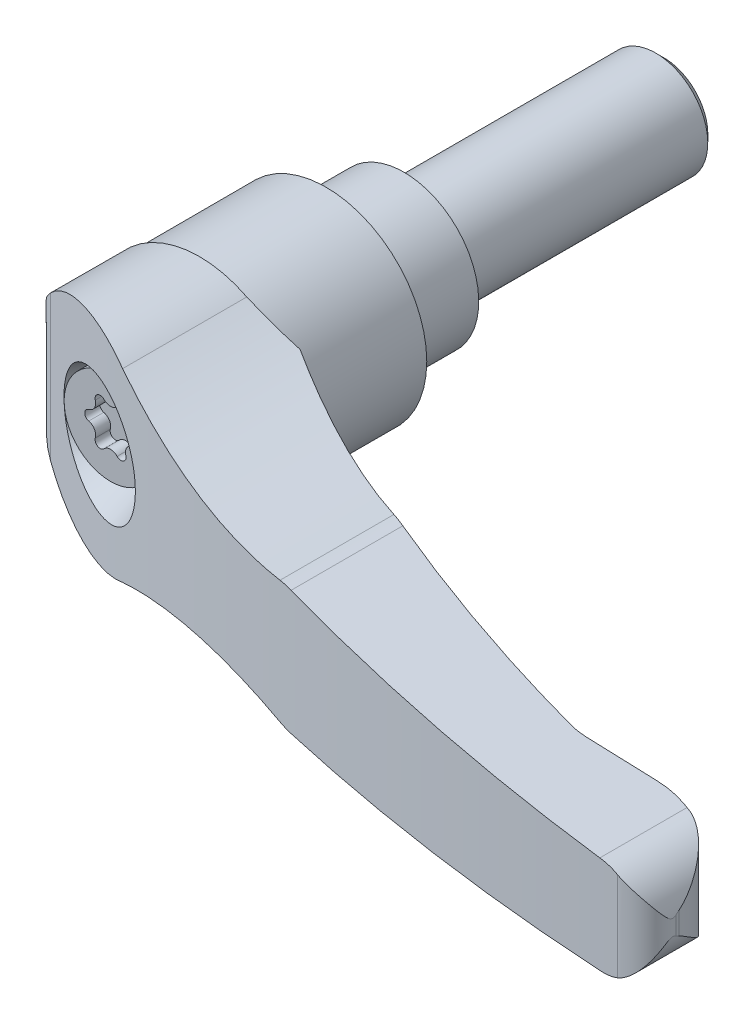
ISO-10303-21;
HEADER;
FILE_DESCRIPTION(('STEP AP214'),'2;1');
FILE_NAME('part.step','',(''),(''),'','','');
FILE_SCHEMA(('AUTOMOTIVE_DESIGN { 1 0 10303 214 1 1 1 1 }'));
ENDSEC;
DATA;
#1=APPLICATION_CONTEXT('core data for automotive mechanical design processes');
#2=APPLICATION_PROTOCOL_DEFINITION('international standard','automotive_design',2000,#1);
#3=PRODUCT_CONTEXT('',#1,'mechanical');
#4=PRODUCT('Part','Part','',(#3));
#5=PRODUCT_RELATED_PRODUCT_CATEGORY('part','',(#4));
#6=PRODUCT_DEFINITION_FORMATION('','',#4);
#7=PRODUCT_DEFINITION_CONTEXT('part definition',#1,'design');
#8=PRODUCT_DEFINITION('design','',#6,#7);
#9=PRODUCT_DEFINITION_SHAPE('','',#8);
#10=(LENGTH_UNIT() NAMED_UNIT(*) SI_UNIT(.MILLI.,.METRE.));
#11=(NAMED_UNIT(*) PLANE_ANGLE_UNIT() SI_UNIT($,.RADIAN.));
#12=(NAMED_UNIT(*) SI_UNIT($,.STERADIAN.) SOLID_ANGLE_UNIT());
#13=UNCERTAINTY_MEASURE_WITH_UNIT(LENGTH_MEASURE(1.E-05),#10,'distance_accuracy_value','');
#14=(GEOMETRIC_REPRESENTATION_CONTEXT(3) GLOBAL_UNCERTAINTY_ASSIGNED_CONTEXT((#13)) GLOBAL_UNIT_ASSIGNED_CONTEXT((#10,
#11,#12)) REPRESENTATION_CONTEXT('',''));
#15=CARTESIAN_POINT('',(0.,0.,0.));
#16=DIRECTION('',(0.,0.,1.));
#17=DIRECTION('',(1.,0.,0.));
#18=AXIS2_PLACEMENT_3D('',#15,#16,#17);
#19=CARTESIAN_POINT('',(-1.58999999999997,2.75396078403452,49.24));
#20=DIRECTION('',(0.,0.,-1.));
#21=DIRECTION('',(0.,1.,0.));
#22=AXIS2_PLACEMENT_3D('',#19,#20,#21);
#23=CYLINDRICAL_SURFACE('',#22,0.794999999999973);
#24=CARTESIAN_POINT('',(-1.58999999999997,2.75396078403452,42.87));
#25=DIRECTION('',(0.,0.,-1.));
#26=DIRECTION('',(0.,1.,0.));
#27=AXIS2_PLACEMENT_3D('',#24,#25,#26);
#28=CIRCLE('',#27,0.794999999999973);
#29=CARTESIAN_POINT('',(-1.0118181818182,3.2996079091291,42.87));
#30=VERTEX_POINT('',#29);
#31=CARTESIAN_POINT('',(-2.3516351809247,2.5260642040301,42.87));
#32=VERTEX_POINT('',#31);
#33=EDGE_CURVE('E232',#30,#32,#28,.F.);
#34=ORIENTED_EDGE('',*,*,#33,.F.);
#35=DIRECTION('',(0.,0.,-1.));
#36=VECTOR('',#35,1.);
#37=CARTESIAN_POINT('',(-1.0118181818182,3.2996079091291,49.24));
#38=LINE('',#37,#36);
#39=CARTESIAN_POINT('',(-1.0118181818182,3.2996079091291,45.19));
#40=VERTEX_POINT('',#39);
#41=EDGE_CURVE('E228',#40,#30,#38,.T.);
#42=ORIENTED_EDGE('',*,*,#41,.F.);
#43=CARTESIAN_POINT('',(-1.58999999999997,2.75396078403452,45.19));
#44=DIRECTION('',(0.,0.,1.));
#45=DIRECTION('',(0.,-1.,0.));
#46=AXIS2_PLACEMENT_3D('',#43,#44,#45);
#47=CIRCLE('',#46,0.794999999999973);
#48=CARTESIAN_POINT('',(-2.3516351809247,2.5260642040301,45.19));
#49=VERTEX_POINT('',#48);
#50=EDGE_CURVE('E193',#49,#40,#47,.F.);
#51=ORIENTED_EDGE('',*,*,#50,.F.);
#52=DIRECTION('',(0.,0.,-1.));
#53=VECTOR('',#52,1.);
#54=CARTESIAN_POINT('',(-2.3516351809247,2.5260642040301,49.24));
#55=LINE('',#54,#53);
#56=EDGE_CURVE('E237',#49,#32,#55,.T.);
#57=ORIENTED_EDGE('',*,*,#56,.T.);
#58=EDGE_LOOP('',(#34,#42,#51,#57));
#59=FACE_BOUND('',#58,.T.);
#60=ADVANCED_FACE('F14',(#59),#23,.F.);
#61=CARTESIAN_POINT('',(1.59,2.75396078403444,49.24));
#62=DIRECTION('',(0.,0.,-1.));
#63=DIRECTION('',(0.,1.,0.));
#64=AXIS2_PLACEMENT_3D('',#61,#62,#63);
#65=CYLINDRICAL_SURFACE('',#64,0.795000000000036);
#66=DIRECTION('',(0.,0.,-1.));
#67=VECTOR('',#66,1.);
#68=CARTESIAN_POINT('',(1.0118181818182,3.2996079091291,49.24));
#69=LINE('',#68,#67);
#70=CARTESIAN_POINT('',(1.0118181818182,3.2996079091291,45.19));
#71=VERTEX_POINT('',#70);
#72=CARTESIAN_POINT('',(1.01181818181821,3.29960790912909,42.87));
#73=VERTEX_POINT('',#72);
#74=EDGE_CURVE('E236',#71,#73,#69,.T.);
#75=ORIENTED_EDGE('',*,*,#74,.T.);
#76=CARTESIAN_POINT('',(1.59,2.75396078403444,42.87));
#77=DIRECTION('',(0.,0.,-1.));
#78=DIRECTION('',(0.,1.,0.));
#79=AXIS2_PLACEMENT_3D('',#76,#77,#78);
#80=CIRCLE('',#79,0.795000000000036);
#81=CARTESIAN_POINT('',(2.3516351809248,2.5260642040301,42.87));
#82=VERTEX_POINT('',#81);
#83=EDGE_CURVE('E253',#82,#73,#80,.F.);
#84=ORIENTED_EDGE('',*,*,#83,.F.);
#85=DIRECTION('',(0.,0.,-1.));
#86=VECTOR('',#85,1.);
#87=CARTESIAN_POINT('',(2.3516351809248,2.5260642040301,49.24));
#88=LINE('',#87,#86);
#89=CARTESIAN_POINT('',(2.3516351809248,2.5260642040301,45.19));
#90=VERTEX_POINT('',#89);
#91=EDGE_CURVE('E766',#90,#82,#88,.T.);
#92=ORIENTED_EDGE('',*,*,#91,.F.);
#93=CARTESIAN_POINT('',(1.59,2.75396078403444,45.19));
#94=DIRECTION('',(0.,0.,1.));
#95=DIRECTION('',(0.,-1.,0.));
#96=AXIS2_PLACEMENT_3D('',#93,#94,#95);
#97=CIRCLE('',#96,0.795000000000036);
#98=EDGE_CURVE('E256',#71,#90,#97,.F.);
#99=ORIENTED_EDGE('',*,*,#98,.F.);
#100=EDGE_LOOP('',(#75,#84,#92,#99));
#101=FACE_BOUND('',#100,.T.);
#102=ADVANCED_FACE('F564',(#101),#65,.F.);
#103=CARTESIAN_POINT('',(3.18,0.,49.24));
#104=DIRECTION('',(0.,0.,-1.));
#105=DIRECTION('',(0.,1.,0.));
#106=AXIS2_PLACEMENT_3D('',#103,#104,#105);
#107=CYLINDRICAL_SURFACE('',#106,0.795);
#108=DIRECTION('',(0.,0.,-1.));
#109=VECTOR('',#108,1.);
#110=CARTESIAN_POINT('',(3.3634533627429,0.77354370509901,49.24));
#111=LINE('',#110,#109);
#112=CARTESIAN_POINT('',(3.3634533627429,0.77354370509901,45.19));
#113=VERTEX_POINT('',#112);
#114=CARTESIAN_POINT('',(3.3634533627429,0.773543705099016,42.87));
#115=VERTEX_POINT('',#114);
#116=EDGE_CURVE('E769',#113,#115,#111,.T.);
#117=ORIENTED_EDGE('',*,*,#116,.T.);
#118=CARTESIAN_POINT('',(3.18,0.,42.87));
#119=DIRECTION('',(0.,0.,-1.));
#120=DIRECTION('',(0.,1.,0.));
#121=AXIS2_PLACEMENT_3D('',#118,#119,#120);
#122=CIRCLE('',#121,0.795);
#123=CARTESIAN_POINT('',(3.3634533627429,-0.773543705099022,42.87));
#124=VERTEX_POINT('',#123);
#125=EDGE_CURVE('E263',#124,#115,#122,.F.);
#126=ORIENTED_EDGE('',*,*,#125,.F.);
#127=DIRECTION('',(0.,0.,-1.));
#128=VECTOR('',#127,1.);
#129=CARTESIAN_POINT('',(3.3634533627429,-0.77354370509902,49.24));
#130=LINE('',#129,#128);
#131=CARTESIAN_POINT('',(3.3634533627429,-0.77354370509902,45.19));
#132=VERTEX_POINT('',#131);
#133=EDGE_CURVE('E772',#132,#124,#130,.T.);
#134=ORIENTED_EDGE('',*,*,#133,.F.);
#135=CARTESIAN_POINT('',(3.18,0.,45.19));
#136=DIRECTION('',(0.,0.,1.));
#137=DIRECTION('',(0.,-1.,0.));
#138=AXIS2_PLACEMENT_3D('',#135,#136,#137);
#139=CIRCLE('',#138,0.795);
#140=EDGE_CURVE('E266',#113,#132,#139,.F.);
#141=ORIENTED_EDGE('',*,*,#140,.F.);
#142=EDGE_LOOP('',(#117,#126,#134,#141));
#143=FACE_BOUND('',#142,.T.);
#144=ADVANCED_FACE('F569',(#143),#107,.F.);
#145=CARTESIAN_POINT('',(1.58999999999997,-2.75396078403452,49.24));
#146=DIRECTION('',(0.,0.,-1.));
#147=DIRECTION('',(0.,1.,0.));
#148=AXIS2_PLACEMENT_3D('',#145,#146,#147);
#149=CYLINDRICAL_SURFACE('',#148,0.794999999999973);
#150=DIRECTION('',(0.,0.,-1.));
#151=VECTOR('',#150,1.);
#152=CARTESIAN_POINT('',(2.3516351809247,-2.5260642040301,49.24));
#153=LINE('',#152,#151);
#154=CARTESIAN_POINT('',(2.3516351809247,-2.5260642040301,45.19));
#155=VERTEX_POINT('',#154);
#156=CARTESIAN_POINT('',(2.3516351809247,-2.5260642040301,42.87));
#157=VERTEX_POINT('',#156);
#158=EDGE_CURVE('E775',#155,#157,#153,.T.);
#159=ORIENTED_EDGE('',*,*,#158,.T.);
#160=CARTESIAN_POINT('',(1.58999999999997,-2.75396078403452,42.87));
#161=DIRECTION('',(0.,0.,-1.));
#162=DIRECTION('',(0.,1.,0.));
#163=AXIS2_PLACEMENT_3D('',#160,#161,#162);
#164=CIRCLE('',#163,0.794999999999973);
#165=CARTESIAN_POINT('',(1.0118181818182,-3.2996079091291,42.87));
#166=VERTEX_POINT('',#165);
#167=EDGE_CURVE('E269',#166,#157,#164,.F.);
#168=ORIENTED_EDGE('',*,*,#167,.F.);
#169=DIRECTION('',(0.,0.,-1.));
#170=VECTOR('',#169,1.);
#171=CARTESIAN_POINT('',(1.0118181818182,-3.2996079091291,49.24));
#172=LINE('',#171,#170);
#173=CARTESIAN_POINT('',(1.0118181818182,-3.2996079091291,45.19));
#174=VERTEX_POINT('',#173);
#175=EDGE_CURVE('E778',#174,#166,#172,.T.);
#176=ORIENTED_EDGE('',*,*,#175,.F.);
#177=CARTESIAN_POINT('',(1.58999999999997,-2.75396078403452,45.19));
#178=DIRECTION('',(0.,0.,1.));
#179=DIRECTION('',(0.,-1.,0.));
#180=AXIS2_PLACEMENT_3D('',#177,#178,#179);
#181=CIRCLE('',#180,0.794999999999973);
#182=EDGE_CURVE('E272',#155,#174,#181,.F.);
#183=ORIENTED_EDGE('',*,*,#182,.F.);
#184=EDGE_LOOP('',(#159,#168,#176,#183));
#185=FACE_BOUND('',#184,.T.);
#186=ADVANCED_FACE('F586',(#185),#149,.F.);
#187=CARTESIAN_POINT('',(-1.59,-2.75396078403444,49.24));
#188=DIRECTION('',(0.,0.,-1.));
#189=DIRECTION('',(0.,1.,0.));
#190=AXIS2_PLACEMENT_3D('',#187,#188,#189);
#191=CYLINDRICAL_SURFACE('',#190,0.795000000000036);
#192=DIRECTION('',(0.,0.,-1.));
#193=VECTOR('',#192,1.);
#194=CARTESIAN_POINT('',(-1.0118181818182,-3.2996079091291,49.24));
#195=LINE('',#194,#193);
#196=CARTESIAN_POINT('',(-1.0118181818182,-3.2996079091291,45.19));
#197=VERTEX_POINT('',#196);
#198=CARTESIAN_POINT('',(-1.01181818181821,-3.29960790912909,42.87));
#199=VERTEX_POINT('',#198);
#200=EDGE_CURVE('E781',#197,#199,#195,.T.);
#201=ORIENTED_EDGE('',*,*,#200,.T.);
#202=CARTESIAN_POINT('',(-1.59,-2.75396078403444,42.87));
#203=DIRECTION('',(0.,0.,-1.));
#204=DIRECTION('',(0.,1.,0.));
#205=AXIS2_PLACEMENT_3D('',#202,#203,#204);
#206=CIRCLE('',#205,0.795000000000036);
#207=CARTESIAN_POINT('',(-2.3516351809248,-2.5260642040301,42.87));
#208=VERTEX_POINT('',#207);
#209=EDGE_CURVE('E275',#208,#199,#206,.F.);
#210=ORIENTED_EDGE('',*,*,#209,.F.);
#211=DIRECTION('',(0.,0.,-1.));
#212=VECTOR('',#211,1.);
#213=CARTESIAN_POINT('',(-2.3516351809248,-2.5260642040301,49.24));
#214=LINE('',#213,#212);
#215=CARTESIAN_POINT('',(-2.3516351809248,-2.5260642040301,45.19));
#216=VERTEX_POINT('',#215);
#217=EDGE_CURVE('E784',#216,#208,#214,.T.);
#218=ORIENTED_EDGE('',*,*,#217,.F.);
#219=CARTESIAN_POINT('',(-1.59,-2.75396078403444,45.19));
#220=DIRECTION('',(0.,0.,1.));
#221=DIRECTION('',(0.,-1.,0.));
#222=AXIS2_PLACEMENT_3D('',#219,#220,#221);
#223=CIRCLE('',#222,0.795000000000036);
#224=EDGE_CURVE('E278',#197,#216,#223,.F.);
#225=ORIENTED_EDGE('',*,*,#224,.F.);
#226=EDGE_LOOP('',(#201,#210,#218,#225));
#227=FACE_BOUND('',#226,.T.);
#228=ADVANCED_FACE('F594',(#227),#191,.F.);
#229=CARTESIAN_POINT('',(-3.18,0.,49.24));
#230=DIRECTION('',(0.,0.,-1.));
#231=DIRECTION('',(0.,1.,0.));
#232=AXIS2_PLACEMENT_3D('',#229,#230,#231);
#233=CYLINDRICAL_SURFACE('',#232,0.795);
#234=CARTESIAN_POINT('',(-3.18,0.,42.87));
#235=DIRECTION('',(0.,0.,-1.));
#236=DIRECTION('',(0.,1.,0.));
#237=AXIS2_PLACEMENT_3D('',#234,#235,#236);
#238=CIRCLE('',#237,0.795);
#239=CARTESIAN_POINT('',(-3.3634533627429,0.773543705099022,42.87));
#240=VERTEX_POINT('',#239);
#241=CARTESIAN_POINT('',(-3.3634533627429,-0.77354370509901,42.87));
#242=VERTEX_POINT('',#241);
#243=EDGE_CURVE('E36',#240,#242,#238,.F.);
#244=ORIENTED_EDGE('',*,*,#243,.F.);
#245=DIRECTION('',(0.,0.,-1.));
#246=VECTOR('',#245,1.);
#247=CARTESIAN_POINT('',(-3.3634533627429,0.77354370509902,49.24));
#248=LINE('',#247,#246);
#249=CARTESIAN_POINT('',(-3.3634533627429,0.77354370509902,45.19));
#250=VERTEX_POINT('',#249);
#251=EDGE_CURVE('E258',#250,#240,#248,.T.);
#252=ORIENTED_EDGE('',*,*,#251,.F.);
#253=CARTESIAN_POINT('',(-3.18,0.,45.19));
#254=DIRECTION('',(0.,0.,1.));
#255=DIRECTION('',(0.,-1.,0.));
#256=AXIS2_PLACEMENT_3D('',#253,#254,#255);
#257=CIRCLE('',#256,0.795);
#258=CARTESIAN_POINT('',(-3.3634533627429,-0.77354370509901,45.19));
#259=VERTEX_POINT('',#258);
#260=EDGE_CURVE('E282',#259,#250,#257,.F.);
#261=ORIENTED_EDGE('',*,*,#260,.F.);
#262=DIRECTION('',(0.,0.,-1.));
#263=VECTOR('',#262,1.);
#264=CARTESIAN_POINT('',(-3.3634533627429,-0.77354370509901,49.24));
#265=LINE('',#264,#263);
#266=EDGE_CURVE('E787',#259,#242,#265,.T.);
#267=ORIENTED_EDGE('',*,*,#266,.T.);
#268=EDGE_LOOP('',(#244,#252,#261,#267));
#269=FACE_BOUND('',#268,.T.);
#270=ADVANCED_FACE('F602',(#269),#233,.F.);
#271=CARTESIAN_POINT('',(-3.68449674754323,2.12724518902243,49.24));
#272=DIRECTION('',(0.,0.,-1.));
#273=DIRECTION('',(0.,1.,0.));
#274=AXIS2_PLACEMENT_3D('',#271,#272,#273);
#275=CYLINDRICAL_SURFACE('',#274,1.39125000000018);
#276=ORIENTED_EDGE('',*,*,#251,.T.);
#277=CARTESIAN_POINT('',(-3.68449674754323,2.12724518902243,42.87));
#278=DIRECTION('',(0.,0.,-1.));
#279=DIRECTION('',(-1.,0.,0.));
#280=AXIS2_PLACEMENT_3D('',#277,#278,#279);
#281=CIRCLE('',#280,1.39125000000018);
#282=EDGE_CURVE('E756',#240,#32,#281,.F.);
#283=ORIENTED_EDGE('',*,*,#282,.T.);
#284=ORIENTED_EDGE('',*,*,#56,.F.);
#285=CARTESIAN_POINT('',(-3.68449674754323,2.12724518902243,45.19));
#286=DIRECTION('',(0.,0.,1.));
#287=DIRECTION('',(0.,-1.,0.));
#288=AXIS2_PLACEMENT_3D('',#285,#286,#287);
#289=CIRCLE('',#288,1.39125000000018);
#290=EDGE_CURVE('E252',#250,#49,#289,.T.);
#291=ORIENTED_EDGE('',*,*,#290,.F.);
#292=EDGE_LOOP('',(#276,#283,#284,#291));
#293=FACE_BOUND('',#292,.T.);
#294=ADVANCED_FACE('F578',(#293),#275,.T.);
#295=CARTESIAN_POINT('',(0.,4.25449037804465,49.24));
#296=DIRECTION('',(0.,0.,-1.));
#297=DIRECTION('',(0.,1.,0.));
#298=AXIS2_PLACEMENT_3D('',#295,#296,#297);
#299=CYLINDRICAL_SURFACE('',#298,1.39125000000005);
#300=ORIENTED_EDGE('',*,*,#41,.T.);
#301=CARTESIAN_POINT('',(0.,4.25449037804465,42.87));
#302=DIRECTION('',(0.,0.,-1.));
#303=DIRECTION('',(-1.,0.,0.));
#304=AXIS2_PLACEMENT_3D('',#301,#302,#303);
#305=CIRCLE('',#304,1.39125000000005);
#306=EDGE_CURVE('E760',#30,#73,#305,.F.);
#307=ORIENTED_EDGE('',*,*,#306,.T.);
#308=ORIENTED_EDGE('',*,*,#74,.F.);
#309=CARTESIAN_POINT('',(0.,4.25449037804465,45.19));
#310=DIRECTION('',(0.,0.,1.));
#311=DIRECTION('',(0.,-1.,0.));
#312=AXIS2_PLACEMENT_3D('',#309,#310,#311);
#313=CIRCLE('',#312,1.39125000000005);
#314=EDGE_CURVE('E241',#40,#71,#313,.T.);
#315=ORIENTED_EDGE('',*,*,#314,.F.);
#316=EDGE_LOOP('',(#300,#307,#308,#315));
#317=FACE_BOUND('',#316,.T.);
#318=ADVANCED_FACE('F242',(#317),#299,.T.);
#319=CARTESIAN_POINT('',(3.68449674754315,2.12724518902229,49.24));
#320=DIRECTION('',(0.,0.,-1.));
#321=DIRECTION('',(0.,1.,0.));
#322=AXIS2_PLACEMENT_3D('',#319,#320,#321);
#323=CYLINDRICAL_SURFACE('',#322,1.39125000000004);
#324=ORIENTED_EDGE('',*,*,#91,.T.);
#325=CARTESIAN_POINT('',(3.68449674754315,2.12724518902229,42.87));
#326=DIRECTION('',(0.,0.,-1.));
#327=DIRECTION('',(-1.,0.,0.));
#328=AXIS2_PLACEMENT_3D('',#325,#326,#327);
#329=CIRCLE('',#328,1.39125000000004);
#330=EDGE_CURVE('E813',#82,#115,#329,.F.);
#331=ORIENTED_EDGE('',*,*,#330,.T.);
#332=ORIENTED_EDGE('',*,*,#116,.F.);
#333=CARTESIAN_POINT('',(3.68449674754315,2.12724518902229,45.19));
#334=DIRECTION('',(0.,0.,1.));
#335=DIRECTION('',(0.,-1.,0.));
#336=AXIS2_PLACEMENT_3D('',#333,#334,#335);
#337=CIRCLE('',#336,1.39125000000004);
#338=EDGE_CURVE('E246',#90,#113,#337,.T.);
#339=ORIENTED_EDGE('',*,*,#338,.F.);
#340=EDGE_LOOP('',(#324,#331,#332,#339));
#341=FACE_BOUND('',#340,.T.);
#342=ADVANCED_FACE('F577',(#341),#323,.T.);
#343=CARTESIAN_POINT('',(3.68449674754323,-2.12724518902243,49.24));
#344=DIRECTION('',(0.,0.,-1.));
#345=DIRECTION('',(0.,1.,0.));
#346=AXIS2_PLACEMENT_3D('',#343,#344,#345);
#347=CYLINDRICAL_SURFACE('',#346,1.39125000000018);
#348=ORIENTED_EDGE('',*,*,#133,.T.);
#349=CARTESIAN_POINT('',(3.68449674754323,-2.12724518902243,42.87));
#350=DIRECTION('',(0.,0.,-1.));
#351=DIRECTION('',(-1.,0.,0.));
#352=AXIS2_PLACEMENT_3D('',#349,#350,#351);
#353=CIRCLE('',#352,1.39125000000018);
#354=EDGE_CURVE('E808',#124,#157,#353,.F.);
#355=ORIENTED_EDGE('',*,*,#354,.T.);
#356=ORIENTED_EDGE('',*,*,#158,.F.);
#357=CARTESIAN_POINT('',(3.68449674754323,-2.12724518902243,45.19));
#358=DIRECTION('',(0.,0.,1.));
#359=DIRECTION('',(0.,-1.,0.));
#360=AXIS2_PLACEMENT_3D('',#357,#358,#359);
#361=CIRCLE('',#360,1.39125000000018);
#362=EDGE_CURVE('E302',#132,#155,#361,.T.);
#363=ORIENTED_EDGE('',*,*,#362,.F.);
#364=EDGE_LOOP('',(#348,#355,#356,#363));
#365=FACE_BOUND('',#364,.T.);
#366=ADVANCED_FACE('F582',(#365),#347,.T.);
#367=CARTESIAN_POINT('',(0.,-4.25449037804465,49.24));
#368=DIRECTION('',(0.,0.,-1.));
#369=DIRECTION('',(0.,1.,0.));
#370=AXIS2_PLACEMENT_3D('',#367,#368,#369);
#371=CYLINDRICAL_SURFACE('',#370,1.39125000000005);
#372=ORIENTED_EDGE('',*,*,#175,.T.);
#373=CARTESIAN_POINT('',(0.,-4.25449037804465,42.87));
#374=DIRECTION('',(0.,0.,-1.));
#375=DIRECTION('',(-1.,0.,0.));
#376=AXIS2_PLACEMENT_3D('',#373,#374,#375);
#377=CIRCLE('',#376,1.39125000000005);
#378=EDGE_CURVE('E806',#166,#199,#377,.F.);
#379=ORIENTED_EDGE('',*,*,#378,.T.);
#380=ORIENTED_EDGE('',*,*,#200,.F.);
#381=CARTESIAN_POINT('',(0.,-4.25449037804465,45.19));
#382=DIRECTION('',(0.,0.,1.));
#383=DIRECTION('',(0.,-1.,0.));
#384=AXIS2_PLACEMENT_3D('',#381,#382,#383);
#385=CIRCLE('',#384,1.39125000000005);
#386=EDGE_CURVE('E305',#174,#197,#385,.T.);
#387=ORIENTED_EDGE('',*,*,#386,.F.);
#388=EDGE_LOOP('',(#372,#379,#380,#387));
#389=FACE_BOUND('',#388,.T.);
#390=ADVANCED_FACE('F590',(#389),#371,.T.);
#391=CARTESIAN_POINT('',(-3.68449674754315,-2.12724518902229,49.24));
#392=DIRECTION('',(0.,0.,-1.));
#393=DIRECTION('',(0.,1.,0.));
#394=AXIS2_PLACEMENT_3D('',#391,#392,#393);
#395=CYLINDRICAL_SURFACE('',#394,1.39125000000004);
#396=ORIENTED_EDGE('',*,*,#217,.T.);
#397=CARTESIAN_POINT('',(-3.68449674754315,-2.12724518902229,42.87));
#398=DIRECTION('',(0.,0.,-1.));
#399=DIRECTION('',(-1.,0.,0.));
#400=AXIS2_PLACEMENT_3D('',#397,#398,#399);
#401=CIRCLE('',#400,1.39125000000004);
#402=EDGE_CURVE('E804',#208,#242,#401,.F.);
#403=ORIENTED_EDGE('',*,*,#402,.T.);
#404=ORIENTED_EDGE('',*,*,#266,.F.);
#405=CARTESIAN_POINT('',(-3.68449674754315,-2.12724518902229,45.19));
#406=DIRECTION('',(0.,0.,1.));
#407=DIRECTION('',(0.,-1.,0.));
#408=AXIS2_PLACEMENT_3D('',#405,#406,#407);
#409=CIRCLE('',#408,1.39125000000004);
#410=EDGE_CURVE('E308',#216,#259,#409,.T.);
#411=ORIENTED_EDGE('',*,*,#410,.F.);
#412=EDGE_LOOP('',(#396,#403,#404,#411));
#413=FACE_BOUND('',#412,.T.);
#414=ADVANCED_FACE('F598',(#413),#395,.T.);
#415=CARTESIAN_POINT('',(0.,0.,12.));
#416=DIRECTION('',(0.,0.,1.));
#417=DIRECTION('',(0.,-1.,0.));
#418=AXIS2_PLACEMENT_3D('',#415,#416,#417);
#419=CYLINDRICAL_SURFACE('',#418,7.15);
#420=CARTESIAN_POINT('',(0.,0.,45.19));
#421=DIRECTION('',(0.,0.,1.));
#422=DIRECTION('',(0.,-1.,0.));
#423=AXIS2_PLACEMENT_3D('',#420,#421,#422);
#424=CIRCLE('',#423,7.15);
#425=CARTESIAN_POINT('',(0.,-7.15,45.19));
#426=VERTEX_POINT('',#425);
#427=EDGE_CURVE('E247',#426,#426,#424,.T.);
#428=ORIENTED_EDGE('',*,*,#427,.F.);
#429=EDGE_LOOP('',(#428));
#430=FACE_BOUND('',#429,.T.);
#431=CARTESIAN_POINT('',(0.,0.,42.87));
#432=DIRECTION('',(0.,0.,1.));
#433=DIRECTION('',(0.,-1.,0.));
#434=AXIS2_PLACEMENT_3D('',#431,#432,#433);
#435=CIRCLE('',#434,7.15);
#436=CARTESIAN_POINT('',(0.00500000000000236,-7.14999825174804,42.87));
#437=VERTEX_POINT('',#436);
#438=CARTESIAN_POINT('',(0.00500000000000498,7.14999825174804,42.87));
#439=VERTEX_POINT('',#438);
#440=EDGE_CURVE('E296',#437,#439,#435,.T.);
#441=ORIENTED_EDGE('',*,*,#440,.T.);
#442=CARTESIAN_POINT('',(7.03183954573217,1.29450090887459,42.8429799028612));
#443=CARTESIAN_POINT('',(6.99069549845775,1.51819635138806,42.8431382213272));
#444=CARTESIAN_POINT('',(6.93880997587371,1.73990977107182,42.84333787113));
#445=CARTESIAN_POINT('',(6.81417682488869,2.17740487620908,42.8438174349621));
#446=CARTESIAN_POINT('',(6.74142826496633,2.39318629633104,42.8440973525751));
#447=CARTESIAN_POINT('',(6.5759091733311,2.81627852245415,42.8447342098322));
#448=CARTESIAN_POINT('',(6.48319120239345,3.02360989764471,42.845090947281));
#449=CARTESIAN_POINT('',(6.27848211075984,3.42849783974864,42.8458785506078));
#450=CARTESIAN_POINT('',(6.16649402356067,3.62605593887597,42.8463094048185));
#451=CARTESIAN_POINT('',(5.93806231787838,3.987772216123,42.8471882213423));
#452=CARTESIAN_POINT('',(5.82357805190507,4.1531720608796,42.84762864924));
#453=CARTESIAN_POINT('',(5.5810849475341,4.47374290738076,42.8485614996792));
#454=CARTESIAN_POINT('',(5.45307647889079,4.62891418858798,42.8490539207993));
#455=CARTESIAN_POINT('',(5.18439686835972,4.92797656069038,42.8500874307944));
#456=CARTESIAN_POINT('',(5.04372112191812,5.07186351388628,42.8506285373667));
#457=CARTESIAN_POINT('',(4.75074933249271,5.34727025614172,42.851755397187));
#458=CARTESIAN_POINT('',(4.59845354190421,5.47879031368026,42.8523411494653));
#459=CARTESIAN_POINT('',(4.28315544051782,5.72866354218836,42.8535537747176));
#460=CARTESIAN_POINT('',(4.12014192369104,5.84700257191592,42.8541806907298));
#461=CARTESIAN_POINT('',(3.78471750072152,6.06950687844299,42.8554705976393));
#462=CARTESIAN_POINT('',(3.61230688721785,6.17367259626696,42.8561335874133));
#463=CARTESIAN_POINT('',(3.25969172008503,6.36688701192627,42.857489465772));
#464=CARTESIAN_POINT('',(3.07950417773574,6.45596679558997,42.8581822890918));
#465=CARTESIAN_POINT('',(2.71234774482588,6.61860590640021,42.8595939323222));
#466=CARTESIAN_POINT('',(2.52538292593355,6.69217437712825,42.8603127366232));
#467=CARTESIAN_POINT('',(2.26625144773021,6.78174103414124,42.8613089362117));
#468=CARTESIAN_POINT('',(2.19642556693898,6.80467590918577,42.8615773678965));
#469=CARTESIAN_POINT('',(2.05609451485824,6.84838502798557,42.8621168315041));
#470=CARTESIAN_POINT('',(1.98558927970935,6.86915906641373,42.8623878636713));
#471=CARTESIAN_POINT('',(1.69614267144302,6.94960898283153,42.8635005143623));
#472=CARTESIAN_POINT('',(1.47452578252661,6.99998359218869,42.8643523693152));
#473=CARTESIAN_POINT('',(1.027376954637,7.07945115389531,42.866071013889));
#474=CARTESIAN_POINT('',(0.801842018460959,7.10852700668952,42.8669378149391));
#475=CARTESIAN_POINT('',(0.348507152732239,7.1451285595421,42.8686800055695));
#476=CARTESIAN_POINT('',(0.12070326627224,7.15260558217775,42.8695554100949));
#477=CARTESIAN_POINT('',(-0.334671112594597,7.14579355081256,42.8713052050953));
#478=CARTESIAN_POINT('',(-0.562241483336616,7.13149622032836,42.872179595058));
#479=CARTESIAN_POINT('',(-0.988506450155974,7.08419530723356,42.8738173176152));
#480=CARTESIAN_POINT('',(-1.1874689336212,7.05357187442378,42.8745816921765));
#481=CARTESIAN_POINT('',(-1.58210608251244,6.97566382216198,42.8760977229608));
#482=CARTESIAN_POINT('',(-1.77778084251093,6.92837968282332,42.8768493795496));
#483=CARTESIAN_POINT('',(-2.16423124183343,6.8175484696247,42.8783337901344));
#484=CARTESIAN_POINT('',(-2.35501209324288,6.75401956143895,42.8790665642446));
#485=CARTESIAN_POINT('',(-2.73055441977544,6.61112216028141,42.8805089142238));
#486=CARTESIAN_POINT('',(-2.91531569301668,6.53175313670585,42.8812184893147));
#487=CARTESIAN_POINT('',(-3.27783499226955,6.35757906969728,42.8826106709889));
#488=CARTESIAN_POINT('',(-3.45557942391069,6.26274572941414,42.8832932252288));
#489=CARTESIAN_POINT('',(-3.80243195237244,6.05842592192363,42.8846251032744));
#490=CARTESIAN_POINT('',(-3.97154019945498,5.94893970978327,42.8852744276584));
#491=CARTESIAN_POINT('',(-4.30004997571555,5.71599903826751,42.8865357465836));
#492=CARTESIAN_POINT('',(-4.45944371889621,5.59253359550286,42.8871477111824));
#493=CARTESIAN_POINT('',(-4.76718607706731,5.33263471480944,42.8883291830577));
#494=CARTESIAN_POINT('',(-4.91553818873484,5.1962054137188,42.8888987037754));
#495=CARTESIAN_POINT('',(-5.21881270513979,4.89268060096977,42.8900629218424));
#496=CARTESIAN_POINT('',(-5.37206129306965,4.72390730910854,42.8906511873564));
#497=CARTESIAN_POINT('',(-5.6617726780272,4.37249351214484,42.891763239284));
#498=CARTESIAN_POINT('',(-5.79823322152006,4.18985115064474,42.892287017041));
#499=CARTESIAN_POINT('',(-6.05310399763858,3.81238641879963,42.8932652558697));
#500=CARTESIAN_POINT('',(-6.1715147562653,3.6175644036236,42.8937197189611));
#501=CARTESIAN_POINT('',(-6.38919688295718,3.21753055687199,42.894555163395));
#502=CARTESIAN_POINT('',(-6.48847083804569,3.01232013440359,42.8949361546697));
#503=CARTESIAN_POINT('',(-6.65653368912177,2.61791636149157,42.8955811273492));
#504=CARTESIAN_POINT('',(-6.72753074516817,2.42965976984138,42.8958535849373));
#505=CARTESIAN_POINT('',(-6.85343572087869,2.0477669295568,42.8963367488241));
#506=CARTESIAN_POINT('',(-6.90833850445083,1.85412898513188,42.8965474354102));
#507=CARTESIAN_POINT('',(-7.00159360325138,1.46306693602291,42.896905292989));
#508=CARTESIAN_POINT('',(-7.03995857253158,1.26564584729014,42.8970525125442));
#509=CARTESIAN_POINT('',(-7.09993884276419,0.868200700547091,42.8972826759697));
#510=CARTESIAN_POINT('',(-7.12154799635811,0.668175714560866,42.8973655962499));
#511=CARTESIAN_POINT('',(-7.14783671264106,0.267056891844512,42.8974664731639));
#512=CARTESIAN_POINT('',(-7.15251967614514,0.0659632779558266,42.8974844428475));
#513=CARTESIAN_POINT('',(-7.14493086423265,-0.335978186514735,42.8974553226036));
#514=CARTESIAN_POINT('',(-7.13265282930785,-0.536825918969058,42.8974082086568));
#515=CARTESIAN_POINT('',(-7.09122422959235,-0.936714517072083,42.8972492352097));
#516=CARTESIAN_POINT('',(-7.06207856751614,-1.13575589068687,42.8971373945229));
#517=CARTESIAN_POINT('',(-6.98711177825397,-1.53074943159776,42.8968497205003));
#518=CARTESIAN_POINT('',(-6.94128449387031,-1.72670043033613,42.8966738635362));
#519=CARTESIAN_POINT('',(-6.83330403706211,-2.1139649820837,42.8962594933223));
#520=CARTESIAN_POINT('',(-6.77115752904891,-2.30528039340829,42.8960210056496));
#521=CARTESIAN_POINT('',(-6.63094529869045,-2.6820675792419,42.8954829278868));
#522=CARTESIAN_POINT('',(-6.55287362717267,-2.86753713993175,42.8951833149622));
#523=CARTESIAN_POINT('',(-6.38141700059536,-3.23116157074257,42.8945253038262));
#524=CARTESIAN_POINT('',(-6.28803852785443,-3.40931949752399,42.8941669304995));
#525=CARTESIAN_POINT('',(-6.08656287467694,-3.75721663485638,42.8933936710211));
#526=CARTESIAN_POINT('',(-5.97845904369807,-3.92695199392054,42.8929787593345));
#527=CARTESIAN_POINT('',(-5.74833350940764,-4.25671078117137,42.8920954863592));
#528=CARTESIAN_POINT('',(-5.62631175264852,-4.41673417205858,42.8916271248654));
#529=CARTESIAN_POINT('',(-5.36927692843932,-4.72586007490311,42.8906404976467));
#530=CARTESIAN_POINT('',(-5.23426977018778,-4.87496750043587,42.8901222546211));
#531=CARTESIAN_POINT('',(-4.952117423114,-5.16134237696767,42.8890391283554));
#532=CARTESIAN_POINT('',(-4.80496713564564,-5.2986048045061,42.8884742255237));
#533=CARTESIAN_POINT('',(-4.49968173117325,-5.56019390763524,42.8873021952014));
#534=CARTESIAN_POINT('',(-4.34155074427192,-5.68452540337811,42.8866950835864));
#535=CARTESIAN_POINT('',(-4.01531134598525,-5.91947632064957,42.8854424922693));
#536=CARTESIAN_POINT('',(-3.84719884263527,-6.03009006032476,42.8847969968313));
#537=CARTESIAN_POINT('',(-3.50231519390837,-6.236720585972,42.8834726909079));
#538=CARTESIAN_POINT('',(-3.32554726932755,-6.33274274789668,42.8827938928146));
#539=CARTESIAN_POINT('',(-2.96449885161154,-6.5095825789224,42.881407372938));
#540=CARTESIAN_POINT('',(-2.78021617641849,-6.59039579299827,42.8806996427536));
#541=CARTESIAN_POINT('',(-2.40556659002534,-6.73618130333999,42.8792607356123));
#542=CARTESIAN_POINT('',(-2.21520194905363,-6.80115943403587,42.8785295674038));
#543=CARTESIAN_POINT('',(-1.82963729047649,-6.91486315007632,42.8770485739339));
#544=CARTESIAN_POINT('',(-1.63443630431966,-6.9635854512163,42.8762987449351));
#545=CARTESIAN_POINT('',(-1.24069668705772,-7.04439835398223,42.8747861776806));
#546=CARTESIAN_POINT('',(-1.0421593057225,-7.07649504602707,42.8740234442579));
#547=CARTESIAN_POINT('',(-0.642932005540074,-7.12387351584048,42.8724896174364));
#548=CARTESIAN_POINT('',(-0.442240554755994,-7.13914239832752,42.8717185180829));
#549=CARTESIAN_POINT('',(-0.0403562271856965,-7.15271193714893,42.8701743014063));
#550=CARTESIAN_POINT('',(0.160836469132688,-7.15101800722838,42.8694011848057));
#551=CARTESIAN_POINT('',(0.588756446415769,-7.12934628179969,42.8677567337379));
#552=CARTESIAN_POINT('',(0.815367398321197,-7.10699667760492,42.8668858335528));
#553=CARTESIAN_POINT('',(1.26545011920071,-7.04080168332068,42.8651559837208));
#554=CARTESIAN_POINT('',(1.48892146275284,-6.99695340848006,42.8642970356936));
#555=CARTESIAN_POINT('',(1.93066705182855,-6.88816144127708,42.8625990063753));
#556=CARTESIAN_POINT('',(2.14894133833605,-6.82321791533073,42.8617599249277));
#557=CARTESIAN_POINT('',(2.57828599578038,-6.67283045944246,42.860109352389));
#558=CARTESIAN_POINT('',(2.78935732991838,-6.58738928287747,42.8592978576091));
#559=CARTESIAN_POINT('',(3.17840058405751,-6.40786212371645,42.8578020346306));
#560=CARTESIAN_POINT('',(3.35737080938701,-6.31593051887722,42.8571138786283));
#561=CARTESIAN_POINT('',(3.70699248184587,-6.11728190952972,42.8557694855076));
#562=CARTESIAN_POINT('',(3.87764126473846,-6.01056021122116,42.855113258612));
#563=CARTESIAN_POINT('',(4.20923829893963,-5.7831830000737,42.8538380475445));
#564=CARTESIAN_POINT('',(4.37019221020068,-5.66253573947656,42.8532190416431));
#565=CARTESIAN_POINT('',(4.68137022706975,-5.40811091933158,42.8520222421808));
#566=CARTESIAN_POINT('',(4.83159412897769,-5.27433311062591,42.8514444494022));
#567=CARTESIAN_POINT('',(5.1202550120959,-4.99458595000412,42.850334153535));
#568=CARTESIAN_POINT('',(5.25869080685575,-4.84861537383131,42.8498016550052));
#569=CARTESIAN_POINT('',(5.52277431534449,-4.5455322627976,42.8487858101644));
#570=CARTESIAN_POINT('',(5.6484220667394,-4.38841976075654,42.8483024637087));
#571=CARTESIAN_POINT('',(5.88606115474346,-4.06413587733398,42.8473882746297));
#572=CARTESIAN_POINT('',(5.99804968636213,-3.89696244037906,42.8469574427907));
#573=CARTESIAN_POINT('',(6.20754176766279,-3.55377827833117,42.8461514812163));
#574=CARTESIAN_POINT('',(6.30504562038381,-3.37776773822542,42.8457763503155));
#575=CARTESIAN_POINT('',(6.4849218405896,-3.01806937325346,42.8450842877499));
#576=CARTESIAN_POINT('',(6.56728677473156,-2.83437783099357,42.8447673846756));
#577=CARTESIAN_POINT('',(6.71621272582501,-2.46077476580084,42.84419437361));
#578=CARTESIAN_POINT('',(6.7827795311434,-2.2708655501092,42.843938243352));
#579=CARTESIAN_POINT('',(6.8996473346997,-1.88620013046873,42.8434885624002));
#580=CARTESIAN_POINT('',(6.9499557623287,-1.69144618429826,42.8432949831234));
#581=CARTESIAN_POINT('',(7.03397996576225,-1.29846042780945,42.8429716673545));
#582=CARTESIAN_POINT('',(7.06770096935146,-1.1002297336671,42.8428419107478));
#583=CARTESIAN_POINT('',(7.12090422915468,-0.681312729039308,42.8426371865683));
#584=CARTESIAN_POINT('',(7.1385863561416,-0.460395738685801,42.8425691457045));
#585=CARTESIAN_POINT('',(7.15340038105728,-0.0182636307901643,42.8425121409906));
#586=CARTESIAN_POINT('',(7.1505683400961,0.202950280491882,42.842523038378));
#587=CARTESIAN_POINT('',(7.13744408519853,0.423546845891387,42.8425735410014));
#588=B_SPLINE_CURVE_WITH_KNOTS('',3,(#442,#443,#444,#445,#446,#447,#448,#449,#450,#451,#452,
#453,#454,#455,#456,#457,#458,#459,#460,#461,#462,#463,#464,#465,#466,#467,#468,#469,#470,#471,
#472,#473,#474,#475,#476,#477,#478,#479,#480,#481,#482,#483,#484,#485,#486,#487,#488,#489,#490,
#491,#492,#493,#494,#495,#496,#497,#498,#499,#500,#501,#502,#503,#504,#505,#506,#507,#508,#509,
#510,#511,#512,#513,#514,#515,#516,#517,#518,#519,#520,#521,#522,#523,#524,#525,#526,#527,#528,
#529,#530,#531,#532,#533,#534,#535,#536,#537,#538,#539,#540,#541,#542,#543,#544,#545,#546,#547,
#548,#549,#550,#551,#552,#553,#554,#555,#556,#557,#558,#559,#560,#561,#562,#563,#564,#565,#566,
#567,#568,#569,#570,#571,#572,#573,#574,#575,#576,#577,#578,#579,#580,#581,#582,#583,#584,#585,
#586,#587),.UNSPECIFIED.,.F.,.F.,(4,2,2,2,2,2,2,2,2,2,2,2,2,2,2,2,2,2,2,2,2,2,2,2,2,2,2,2,2,2,2,
2,2,2,2,2,2,2,2,2,2,2,2,2,2,2,2,2,2,2,2,2,2,2,2,2,2,2,2,2,2,2,2,2,2,2,2,2,2,2,2,2,4),(0.,
0.682077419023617,1.3641852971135,2.04451929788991,2.72474629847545,3.32751763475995,
3.93027249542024,4.53324734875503,5.13620910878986,5.7398116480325,6.34339540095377,
6.94571987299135,7.54768828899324,7.76815066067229,7.98863396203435,8.66929657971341,
9.35050506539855,10.0332476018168,10.7162497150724,11.3194706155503,11.9226741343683,
12.5252060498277,13.1277581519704,13.7314254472,14.3350822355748,14.9392166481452,
15.5431589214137,16.226005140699,16.9089429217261,17.5918607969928,18.2746862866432,
18.8775864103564,19.4806787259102,20.0833087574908,20.6861597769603,21.2888896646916,
21.8918420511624,22.4946192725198,23.0976192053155,23.7003732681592,24.3033529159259,
24.9060778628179,25.5090759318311,26.1120763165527,26.7148035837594,27.3177852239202,
27.9205412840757,28.5235461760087,29.1263283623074,29.7292868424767,30.3320228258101,
30.93488050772,31.5375171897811,32.1406153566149,32.7435210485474,33.4255997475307,
34.1077699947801,34.7899348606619,35.4720081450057,36.0749158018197,36.6780152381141,
37.2807590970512,37.8835143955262,38.4863302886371,39.0891444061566,39.6920821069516,
40.2950071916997,40.8982275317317,41.5012265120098,42.1039495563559,42.7064825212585,
43.3703866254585,44.0331239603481),.UNSPECIFIED.);
#589=EDGE_CURVE('E9',#439,#437,#588,.T.);
#590=ORIENTED_EDGE('',*,*,#589,.T.);
#591=EDGE_LOOP('',(#441,#590));
#592=FACE_BOUND('',#591,.T.);
#593=ADVANCED_FACE('F606',(#430,#592),#419,.T.);
#594=CARTESIAN_POINT('',(0.,0.,45.19));
#595=DIRECTION('',(0.,0.,1.));
#596=DIRECTION('',(0.,-1.,0.));
#597=AXIS2_PLACEMENT_3D('',#594,#595,#596);
#598=PLANE('',#597);
#599=ORIENTED_EDGE('',*,*,#427,.T.);
#600=EDGE_LOOP('',(#599));
#601=FACE_BOUND('',#600,.T.);
#602=ORIENTED_EDGE('',*,*,#260,.T.);
#603=ORIENTED_EDGE('',*,*,#290,.T.);
#604=ORIENTED_EDGE('',*,*,#50,.T.);
#605=ORIENTED_EDGE('',*,*,#314,.T.);
#606=ORIENTED_EDGE('',*,*,#98,.T.);
#607=ORIENTED_EDGE('',*,*,#338,.T.);
#608=ORIENTED_EDGE('',*,*,#140,.T.);
#609=ORIENTED_EDGE('',*,*,#362,.T.);
#610=ORIENTED_EDGE('',*,*,#182,.T.);
#611=ORIENTED_EDGE('',*,*,#386,.T.);
#612=ORIENTED_EDGE('',*,*,#224,.T.);
#613=ORIENTED_EDGE('',*,*,#410,.T.);
#614=EDGE_LOOP('',(#602,#603,#604,#605,#606,#607,#608,#609,#610,#611,#612,#613));
#615=FACE_BOUND('',#614,.T.);
#616=ADVANCED_FACE('F251',(#601,#615),#598,.T.);
#617=CARTESIAN_POINT('',(0.,0.,12.));
#618=DIRECTION('',(0.,0.,1.));
#619=DIRECTION('',(0.,-1.,0.));
#620=AXIS2_PLACEMENT_3D('',#617,#618,#619);
#621=CYLINDRICAL_SURFACE('',#620,11.5);
#622=CARTESIAN_POINT('',(0.,0.,12.75));
#623=DIRECTION('',(0.,0.,-1.));
#624=DIRECTION('',(-1.,0.,0.));
#625=AXIS2_PLACEMENT_3D('',#622,#623,#624);
#626=CIRCLE('',#625,11.5);
#627=CARTESIAN_POINT('',(0.0050000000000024,-11.4999989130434,12.75));
#628=VERTEX_POINT('',#627);
#629=CARTESIAN_POINT('',(0.0050000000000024,11.4999989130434,12.75));
#630=VERTEX_POINT('',#629);
#631=EDGE_CURVE('E753',#628,#630,#626,.F.);
#632=ORIENTED_EDGE('',*,*,#631,.F.);
#633=CARTESIAN_POINT('',(11.057512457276,3.15933826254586,12.7596148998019));
#634=CARTESIAN_POINT('',(11.135688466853,2.88572617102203,12.7596829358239));
#635=CARTESIAN_POINT('',(11.2037048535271,2.6092091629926,12.759742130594));
#636=CARTESIAN_POINT('',(11.3190626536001,2.05179328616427,12.7598425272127));
#637=CARTESIAN_POINT('',(11.3663966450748,1.77089288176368,12.7598837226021));
#638=CARTESIAN_POINT('',(11.440095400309,1.20634083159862,12.7599478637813));
#639=CARTESIAN_POINT('',(11.4664591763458,0.922689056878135,12.7599708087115));
#640=CARTESIAN_POINT('',(11.4980627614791,0.354312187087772,12.7599983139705));
#641=CARTESIAN_POINT('',(11.5033100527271,0.0695875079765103,12.7600028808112));
#642=CARTESIAN_POINT('',(11.4926715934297,-0.499503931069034,12.7599936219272));
#643=CARTESIAN_POINT('',(11.4767831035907,-0.783870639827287,12.7599797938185));
#644=CARTESIAN_POINT('',(11.423963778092,-1.3505595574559,12.7599338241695));
#645=CARTESIAN_POINT('',(11.3870390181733,-1.63288233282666,12.7599016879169));
#646=CARTESIAN_POINT('',(11.2923290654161,-2.19416134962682,12.7598192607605));
#647=CARTESIAN_POINT('',(11.2345329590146,-2.47311575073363,12.7597689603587));
#648=CARTESIAN_POINT('',(11.0984215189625,-3.02589727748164,12.7596505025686));
#649=CARTESIAN_POINT('',(11.0201108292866,-3.29972554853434,12.7595823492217));
#650=CARTESIAN_POINT('',(10.8313935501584,-3.87754702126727,12.7594181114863));
#651=CARTESIAN_POINT('',(10.7180741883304,-4.18059359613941,12.7593194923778));
#652=CARTESIAN_POINT('',(10.466306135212,-4.77608158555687,12.7591003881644));
#653=CARTESIAN_POINT('',(10.3278552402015,-5.06852206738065,12.7589799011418));
#654=CARTESIAN_POINT('',(10.0267681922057,-5.64078719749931,12.7587178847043));
#655=CARTESIAN_POINT('',(9.86412506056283,-5.92060817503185,12.7585763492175));
#656=CARTESIAN_POINT('',(9.51584272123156,-6.46554735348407,12.758273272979));
#657=CARTESIAN_POINT('',(9.33020378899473,-6.73066573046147,12.758111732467));
#658=CARTESIAN_POINT('',(8.93727326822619,-7.24428621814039,12.7577698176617));
#659=CARTESIAN_POINT('',(8.729984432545,-7.49279043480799,12.7575894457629));
#660=CARTESIAN_POINT('',(8.29520735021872,-7.97145363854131,12.7572111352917));
#661=CARTESIAN_POINT('',(8.06771899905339,-8.2016125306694,12.7570131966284));
#662=CARTESIAN_POINT('',(7.59417723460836,-8.64193241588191,12.756601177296));
#663=CARTESIAN_POINT('',(7.34812507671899,-8.85209475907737,12.7563870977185));
#664=CARTESIAN_POINT('',(6.83919168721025,-9.25094484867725,12.7559443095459));
#665=CARTESIAN_POINT('',(6.57631047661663,-9.43963262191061,12.7557156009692));
#666=CARTESIAN_POINT('',(6.03557972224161,-9.79419761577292,12.7552451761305));
#667=CARTESIAN_POINT('',(5.75772974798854,-9.96007417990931,12.7550034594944));
#668=CARTESIAN_POINT('',(5.18904363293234,-10.2678311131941,12.754508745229));
#669=CARTESIAN_POINT('',(4.89820748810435,-10.4097114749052,12.7542557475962));
#670=CARTESIAN_POINT('',(4.30561391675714,-10.6684685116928,12.7537402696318));
#671=CARTESIAN_POINT('',(4.00385638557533,-10.7853449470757,12.7534777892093));
#672=CARTESIAN_POINT('',(3.39156802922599,-10.9932614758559,12.7529452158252));
#673=CARTESIAN_POINT('',(3.08103720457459,-11.0843015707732,12.752675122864));
#674=CARTESIAN_POINT('',(2.45341132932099,-11.2398978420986,12.7521292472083));
#675=CARTESIAN_POINT('',(2.13631630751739,-11.3044541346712,12.7518534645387));
#676=CARTESIAN_POINT('',(1.49781507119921,-11.4066244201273,12.751298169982));
#677=CARTESIAN_POINT('',(1.17640885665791,-11.4442384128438,12.7510186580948));
#678=CARTESIAN_POINT('',(0.531570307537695,-11.4922566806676,12.7504578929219));
#679=CARTESIAN_POINT('',(0.208137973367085,-11.502660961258,12.7501766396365));
#680=CARTESIAN_POINT('',(-0.438453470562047,-11.4961858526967,12.7496143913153));
#681=CARTESIAN_POINT('',(-0.761612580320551,-11.4793064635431,12.7493333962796));
#682=CARTESIAN_POINT('',(-1.40536029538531,-11.4183839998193,12.7487736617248));
#683=CARTESIAN_POINT('',(-1.72594889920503,-11.3743409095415,12.748494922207));
#684=CARTESIAN_POINT('',(-2.36227621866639,-11.2594041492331,12.7479416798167));
#685=CARTESIAN_POINT('',(-2.67801493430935,-11.18851047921,12.7476671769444));
#686=CARTESIAN_POINT('',(-3.30239757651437,-11.020376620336,12.7471243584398));
#687=CARTESIAN_POINT('',(-3.61104150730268,-10.9231364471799,12.7468560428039));
#688=CARTESIAN_POINT('',(-4.21904050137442,-10.7030008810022,12.7463275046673));
#689=CARTESIAN_POINT('',(-4.51839556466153,-10.5801054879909,12.7460672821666));
#690=CARTESIAN_POINT('',(-5.10568861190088,-10.309533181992,12.7455567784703));
#691=CARTESIAN_POINT('',(-5.39362659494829,-10.1618562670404,12.7453064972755));
#692=CARTESIAN_POINT('',(-5.95603838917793,-9.84277081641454,12.7448176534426));
#693=CARTESIAN_POINT('',(-6.23051220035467,-9.67136228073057,12.7445790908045));
#694=CARTESIAN_POINT('',(-6.76404438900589,-9.30603214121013,12.7441153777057));
#695=CARTESIAN_POINT('',(-7.0231027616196,-9.11211053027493,12.7438902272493));
#696=CARTESIAN_POINT('',(-7.52396222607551,-8.70313294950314,12.7434549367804));
#697=CARTESIAN_POINT('',(-7.76576331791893,-8.48807697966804,12.743244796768));
#698=CARTESIAN_POINT('',(-8.23038906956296,-8.03835968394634,12.7428410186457));
#699=CARTESIAN_POINT('',(-8.45321373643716,-7.80369836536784,12.7426473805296));
#700=CARTESIAN_POINT('',(-8.87830258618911,-7.31643860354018,12.7422779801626));
#701=CARTESIAN_POINT('',(-9.08056676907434,-7.06384016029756,12.7421022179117));
#702=CARTESIAN_POINT('',(-9.46309664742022,-6.54250200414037,12.7417698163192));
#703=CARTESIAN_POINT('',(-9.64336234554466,-6.27376229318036,12.7416131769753));
#704=CARTESIAN_POINT('',(-9.98061369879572,-5.72205215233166,12.7413201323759));
#705=CARTESIAN_POINT('',(-10.1375993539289,-5.43908172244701,12.7411837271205));
#706=CARTESIAN_POINT('',(-10.4271744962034,-4.86092199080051,12.7409321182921));
#707=CARTESIAN_POINT('',(-10.5597639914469,-4.56573269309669,12.7408169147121));
#708=CARTESIAN_POINT('',(-10.7996042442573,-3.96523375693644,12.7406085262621));
#709=CARTESIAN_POINT('',(-10.9068550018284,-3.65992411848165,12.7405153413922));
#710=CARTESIAN_POINT('',(-11.0952552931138,-3.04135505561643,12.7403516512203));
#711=CARTESIAN_POINT('',(-11.176404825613,-2.72809563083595,12.7402811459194));
#712=CARTESIAN_POINT('',(-11.3120257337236,-2.09585409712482,12.7401633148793));
#713=CARTESIAN_POINT('',(-11.3664971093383,-1.77687198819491,12.7401159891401));
#714=CARTESIAN_POINT('',(-11.4483744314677,-1.13545295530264,12.7400448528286));
#715=CARTESIAN_POINT('',(-11.4757803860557,-0.813016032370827,12.7400210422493));
#716=CARTESIAN_POINT('',(-11.5033320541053,-0.166979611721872,12.7399971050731));
#717=CARTESIAN_POINT('',(-11.5034777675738,0.156619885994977,12.7399969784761));
#718=CARTESIAN_POINT('',(-11.476507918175,0.802680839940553,12.7400204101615));
#719=CARTESIAN_POINT('',(-11.4493923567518,1.12514229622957,12.7400439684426));
#720=CARTESIAN_POINT('',(-11.3680927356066,1.76663467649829,12.7401146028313));
#721=CARTESIAN_POINT('',(-11.3139086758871,2.0856656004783,12.740161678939));
#722=CARTESIAN_POINT('',(-11.1788572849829,2.71802875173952,12.7402790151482));
#723=CARTESIAN_POINT('',(-11.0979899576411,3.03136097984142,12.7403492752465));
#724=CARTESIAN_POINT('',(-10.9101469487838,3.65009918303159,12.7405124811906));
#725=CARTESIAN_POINT('',(-10.8031712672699,3.9555051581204,12.7406054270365));
#726=CARTESIAN_POINT('',(-10.5638720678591,4.55621964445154,12.7408133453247));
#727=CARTESIAN_POINT('',(-10.431548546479,4.85152815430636,12.74092831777));
#728=CARTESIAN_POINT('',(-10.1424944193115,5.42994820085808,12.7411794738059));
#729=CARTESIAN_POINT('',(-9.98576381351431,5.71305973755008,12.7413156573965));
#730=CARTESIAN_POINT('',(-9.64900973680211,6.26507315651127,12.7416082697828));
#731=CARTESIAN_POINT('',(-9.4689862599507,6.53397503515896,12.7417646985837));
#732=CARTESIAN_POINT('',(-9.08692633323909,7.05565733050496,12.7420966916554));
#733=CARTESIAN_POINT('',(-8.88488988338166,7.3084377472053,12.7422722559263));
#734=CARTESIAN_POINT('',(-8.46024044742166,7.79607991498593,12.742641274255));
#735=CARTESIAN_POINT('',(-8.23762746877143,8.03094167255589,12.7428347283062));
#736=CARTESIAN_POINT('',(-7.77340755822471,8.48107690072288,12.7432381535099));
#737=CARTESIAN_POINT('',(-7.53180062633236,8.69635037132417,12.7434481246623));
#738=CARTESIAN_POINT('',(-7.03131044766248,9.10577859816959,12.743883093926));
#739=CARTESIAN_POINT('',(-6.77242719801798,9.29993335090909,12.7441080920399));
#740=CARTESIAN_POINT('',(-6.23922492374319,9.66574378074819,12.7445715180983));
#741=CARTESIAN_POINT('',(-5.96490589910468,9.8373994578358,12.7448099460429));
#742=CARTESIAN_POINT('',(-5.40278212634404,10.1569914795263,12.7452985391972));
#743=CARTESIAN_POINT('',(-5.11497736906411,10.3049278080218,12.7455487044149));
#744=CARTESIAN_POINT('',(-4.52792842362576,10.5760292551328,12.7460589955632));
#745=CARTESIAN_POINT('',(-4.22868423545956,10.6991943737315,12.7463191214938));
#746=CARTESIAN_POINT('',(-3.62088391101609,10.9198777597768,12.7468474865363));
#747=CARTESIAN_POINT('',(-3.31232777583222,11.0173960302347,12.7471157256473));
#748=CARTESIAN_POINT('',(-2.68809717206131,11.1860924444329,12.7476584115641));
#749=CARTESIAN_POINT('',(-2.37242270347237,11.2572705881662,12.7479328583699));
#750=CARTESIAN_POINT('',(-1.7361995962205,11.3727807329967,12.7484860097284));
#751=CARTESIAN_POINT('',(-1.41565095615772,11.4171127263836,12.7487647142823));
#752=CARTESIAN_POINT('',(-0.77195850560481,11.4786153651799,12.7493244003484));
#753=CARTESIAN_POINT('',(-0.44881469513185,11.4957860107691,12.7496053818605));
#754=CARTESIAN_POINT('',(0.19777261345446,11.5028439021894,12.7501676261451));
#755=CARTESIAN_POINT('',(0.521216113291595,11.492730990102,12.7504488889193));
#756=CARTESIAN_POINT('',(1.16610143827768,11.4452933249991,12.7510096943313));
#757=CARTESIAN_POINT('',(1.48754326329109,11.4079685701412,12.7512892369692));
#758=CARTESIAN_POINT('',(2.12613632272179,11.3063731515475,12.7518446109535));
#759=CARTESIAN_POINT('',(2.44328760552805,11.2421027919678,12.7521204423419));
#760=CARTESIAN_POINT('',(3.07104844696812,11.0870731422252,12.7526664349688));
#761=CARTESIAN_POINT('',(3.38165800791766,10.9963138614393,12.7529365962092));
#762=CARTESIAN_POINT('',(3.99411715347,10.7889550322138,12.7534693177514));
#763=CARTESIAN_POINT('',(4.29596702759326,10.672356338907,12.7537318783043));
#764=CARTESIAN_POINT('',(4.88877213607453,10.4141456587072,12.7542475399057));
#765=CARTESIAN_POINT('',(5.17972735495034,10.2725336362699,12.7545006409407));
#766=CARTESIAN_POINT('',(5.74869677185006,9.96529100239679,12.7549956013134));
#767=CARTESIAN_POINT('',(6.02670994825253,9.7996584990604,12.7552374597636));
#768=CARTESIAN_POINT('',(6.56779255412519,9.44556186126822,12.7557081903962));
#769=CARTESIAN_POINT('',(6.83086207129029,9.25709786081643,12.7559370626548));
#770=CARTESIAN_POINT('',(7.34022651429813,8.85864800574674,12.7563802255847));
#771=CARTESIAN_POINT('',(7.58651893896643,8.6486589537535,12.7565945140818));
#772=CARTESIAN_POINT('',(8.0605378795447,8.20867217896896,12.7570069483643));
#773=CARTESIAN_POINT('',(8.28826418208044,7.97867422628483,12.7572050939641));
#774=CARTESIAN_POINT('',(8.72345293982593,7.50039165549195,12.7575837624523));
#775=CARTESIAN_POINT('',(8.93092218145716,7.25211321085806,12.7577642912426));
#776=CARTESIAN_POINT('',(9.32419670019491,6.73897804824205,12.7581065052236));
#777=CARTESIAN_POINT('',(9.51000412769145,6.47412297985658,12.7582681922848));
#778=CARTESIAN_POINT('',(9.8348807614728,5.96683201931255,12.7585509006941));
#779=CARTESIAN_POINT('',(9.97686869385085,5.72625850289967,12.7586744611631));
#780=CARTESIAN_POINT('',(10.2429962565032,5.23535914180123,12.7589060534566));
#781=CARTESIAN_POINT('',(10.3671321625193,4.98503127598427,12.7590140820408));
#782=CARTESIAN_POINT('',(10.5967953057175,4.47613911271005,12.7592139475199));
#783=CARTESIAN_POINT('',(10.702332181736,4.21757916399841,12.7593057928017));
#784=CARTESIAN_POINT('',(10.8943465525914,3.69339218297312,12.7594728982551));
#785=CARTESIAN_POINT('',(10.9808185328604,3.42776313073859,12.759548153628));
#786=CARTESIAN_POINT('',(11.057512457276,3.15933826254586,12.7596148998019));
#787=B_SPLINE_CURVE_WITH_KNOTS('',3,(#633,#634,#635,#636,#637,#638,#639,#640,#641,#642,#643,
#644,#645,#646,#647,#648,#649,#650,#651,#652,#653,#654,#655,#656,#657,#658,#659,#660,#661,#662,
#663,#664,#665,#666,#667,#668,#669,#670,#671,#672,#673,#674,#675,#676,#677,#678,#679,#680,#681,
#682,#683,#684,#685,#686,#687,#688,#689,#690,#691,#692,#693,#694,#695,#696,#697,#698,#699,#700,
#701,#702,#703,#704,#705,#706,#707,#708,#709,#710,#711,#712,#713,#714,#715,#716,#717,#718,#719,
#720,#721,#722,#723,#724,#725,#726,#727,#728,#729,#730,#731,#732,#733,#734,#735,#736,#737,#738,
#739,#740,#741,#742,#743,#744,#745,#746,#747,#748,#749,#750,#751,#752,#753,#754,#755,#756,#757,
#758,#759,#760,#761,#762,#763,#764,#765,#766,#767,#768,#769,#770,#771,#772,#773,#774,#775,#776,
#777,#778,#779,#780,#781,#782,#783,#784,#785,#786),.UNSPECIFIED.,.T.,.F.,(4,2,2,2,2,2,2,2,2,2,2,
2,2,2,2,2,2,2,2,2,2,2,2,2,2,2,2,2,2,2,2,2,2,2,2,2,2,2,2,2,2,2,2,2,2,2,2,2,2,2,2,2,2,2,2,2,2,2,2,
2,2,2,2,2,2,2,2,2,2,2,2,2,2,2,2,2,4),(0.,0.853491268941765,1.70728856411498,2.56112607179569,
3.41466101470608,4.26830659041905,5.12170573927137,5.97555177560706,6.8292046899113,
7.79865188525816,8.7681841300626,9.73799659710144,10.7077974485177,11.6774751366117,
12.6471578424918,13.6167750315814,14.586391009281,15.5560348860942,16.5256790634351,
17.4953325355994,18.4649859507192,19.4346351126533,20.4042842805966,21.3739332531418,
22.3435822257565,23.3132317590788,24.282881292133,25.2525302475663,26.222179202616,
27.1918282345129,28.1614772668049,29.1311266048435,30.1007759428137,31.0704249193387,
32.0400738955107,33.0097227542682,33.9793716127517,34.9490201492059,35.918668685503,
36.888317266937,37.8579658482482,38.8276141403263,39.7972624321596,40.7669106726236,
41.7365589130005,42.7062070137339,43.6758551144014,44.6455033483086,45.6151515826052,
46.5848000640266,47.5544485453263,48.5240966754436,49.4937448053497,50.4633930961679,
51.4330413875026,52.4026903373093,53.3723392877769,54.34198812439,55.3116369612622,
56.281286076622,57.2509351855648,58.2205899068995,59.1902446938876,60.1598885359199,
61.1295320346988,62.0991434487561,63.068756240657,64.0384454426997,65.0081289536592,
65.9779567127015,66.9477956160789,67.9173084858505,68.8867250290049,69.7240546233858,
70.5615586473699,71.3986273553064,72.2359378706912),.UNSPECIFIED.);
#788=EDGE_CURVE('E28',#628,#630,#787,.T.);
#789=ORIENTED_EDGE('',*,*,#788,.T.);
#790=EDGE_LOOP('',(#632,#789));
#791=FACE_BOUND('',#790,.T.);
#792=CARTESIAN_POINT('',(0.,0.,0.));
#793=DIRECTION('',(0.,0.,1.));
#794=DIRECTION('',(0.,-1.,0.));
#795=AXIS2_PLACEMENT_3D('',#792,#793,#794);
#796=CIRCLE('',#795,11.5);
#797=CARTESIAN_POINT('',(0.,-11.5,0.));
#798=VERTEX_POINT('',#797);
#799=EDGE_CURVE('E293',#798,#798,#796,.T.);
#800=ORIENTED_EDGE('',*,*,#799,.T.);
#801=EDGE_LOOP('',(#800));
#802=FACE_BOUND('',#801,.T.);
#803=ADVANCED_FACE('F324',(#791,#802),#621,.T.);
#804=CARTESIAN_POINT('',(11.5,0.,0.));
#805=DIRECTION('',(0.,0.,-1.));
#806=DIRECTION('',(0.,1.,0.));
#807=AXIS2_PLACEMENT_3D('',#804,#805,#806);
#808=PLANE('',#807);
#809=CARTESIAN_POINT('',(0.,0.,0.));
#810=DIRECTION('',(0.,0.,1.));
#811=DIRECTION('',(0.,-1.,0.));
#812=AXIS2_PLACEMENT_3D('',#809,#810,#811);
#813=CIRCLE('',#812,8.);
#814=CARTESIAN_POINT('',(0.,-8.,0.));
#815=VERTEX_POINT('',#814);
#816=EDGE_CURVE('E290',#815,#815,#813,.T.);
#817=ORIENTED_EDGE('',*,*,#816,.T.);
#818=EDGE_LOOP('',(#817));
#819=FACE_BOUND('',#818,.T.);
#820=ORIENTED_EDGE('',*,*,#799,.F.);
#821=EDGE_LOOP('',(#820));
#822=FACE_BOUND('',#821,.T.);
#823=ADVANCED_FACE('F623',(#819,#822),#808,.T.);
#824=CARTESIAN_POINT('',(0.,0.,12.));
#825=DIRECTION('',(0.,0.,1.));
#826=DIRECTION('',(0.,-1.,0.));
#827=AXIS2_PLACEMENT_3D('',#824,#825,#826);
#828=CYLINDRICAL_SURFACE('',#827,8.);
#829=CARTESIAN_POINT('',(0.,0.,-38.77133));
#830=DIRECTION('',(0.,0.,1.));
#831=DIRECTION('',(0.,-1.,0.));
#832=AXIS2_PLACEMENT_3D('',#829,#830,#831);
#833=CIRCLE('',#832,8.);
#834=CARTESIAN_POINT('',(0.,-8.,-38.77133));
#835=VERTEX_POINT('',#834);
#836=EDGE_CURVE('E287',#835,#835,#833,.T.);
#837=ORIENTED_EDGE('',*,*,#836,.T.);
#838=EDGE_LOOP('',(#837));
#839=FACE_BOUND('',#838,.T.);
#840=ORIENTED_EDGE('',*,*,#816,.F.);
#841=EDGE_LOOP('',(#840));
#842=FACE_BOUND('',#841,.T.);
#843=ADVANCED_FACE('F620',(#839,#842),#828,.T.);
#844=CARTESIAN_POINT('',(0.,0.,-38.77133));
#845=DIRECTION('',(0.,0.,1.));
#846=DIRECTION('',(0.,-1.,0.));
#847=AXIS2_PLACEMENT_3D('',#844,#845,#846);
#848=CONICAL_SURFACE('',#847,8.,0.785398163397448);
#849=CARTESIAN_POINT('',(0.,0.,-40.));
#850=DIRECTION('',(0.,0.,1.));
#851=DIRECTION('',(0.,-1.,0.));
#852=AXIS2_PLACEMENT_3D('',#849,#850,#851);
#853=CIRCLE('',#852,6.77133);
#854=CARTESIAN_POINT('',(0.,-6.77133,-40.));
#855=VERTEX_POINT('',#854);
#856=EDGE_CURVE('E284',#855,#855,#853,.T.);
#857=ORIENTED_EDGE('',*,*,#856,.T.);
#858=EDGE_LOOP('',(#857));
#859=FACE_BOUND('',#858,.T.);
#860=ORIENTED_EDGE('',*,*,#836,.F.);
#861=EDGE_LOOP('',(#860));
#862=FACE_BOUND('',#861,.T.);
#863=ADVANCED_FACE('F616',(#859,#862),#848,.T.);
#864=CARTESIAN_POINT('',(6.77133,0.,-40.));
#865=DIRECTION('',(0.,0.,-1.));
#866=DIRECTION('',(0.,1.,0.));
#867=AXIS2_PLACEMENT_3D('',#864,#865,#866);
#868=PLANE('',#867);
#869=ORIENTED_EDGE('',*,*,#856,.F.);
#870=EDGE_LOOP('',(#869));
#871=FACE_BOUND('',#870,.T.);
#872=ADVANCED_FACE('F332',(#871),#868,.T.);
#873=CARTESIAN_POINT('',(0.0100000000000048,0.,12.75));
#874=DIRECTION('',(0.,0.,-1.));
#875=DIRECTION('',(0.,1.,0.));
#876=AXIS2_PLACEMENT_3D('',#873,#874,#875);
#877=CONICAL_SURFACE('',#876,11.5,0.78539816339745);
#878=ORIENTED_EDGE('',*,*,#788,.F.);
#879=CARTESIAN_POINT('',(0.0100000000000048,0.,12.75));
#880=DIRECTION('',(0.,0.,1.));
#881=DIRECTION('',(0.,-1.,0.));
#882=AXIS2_PLACEMENT_3D('',#879,#880,#881);
#883=CIRCLE('',#882,11.5);
#884=EDGE_CURVE('E749',#628,#630,#883,.T.);
#885=ORIENTED_EDGE('',*,*,#884,.T.);
#886=EDGE_LOOP('',(#878,#885));
#887=FACE_BOUND('',#886,.T.);
#888=CARTESIAN_POINT('',(0.0100000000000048,0.,12.4));
#889=DIRECTION('',(0.,0.,1.));
#890=DIRECTION('',(0.,-1.,0.));
#891=AXIS2_PLACEMENT_3D('',#888,#889,#890);
#892=CIRCLE('',#891,11.85);
#893=CARTESIAN_POINT('',(0.0100000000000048,-11.85,12.4));
#894=VERTEX_POINT('',#893);
#895=EDGE_CURVE('E751',#894,#894,#892,.T.);
#896=ORIENTED_EDGE('',*,*,#895,.F.);
#897=EDGE_LOOP('',(#896));
#898=FACE_BOUND('',#897,.T.);
#899=ADVANCED_FACE('F327',(#887,#898),#877,.F.);
#900=CARTESIAN_POINT('',(0.0100000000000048,0.,12.));
#901=DIRECTION('',(0.,0.,1.));
#902=DIRECTION('',(0.,-1.,0.));
#903=AXIS2_PLACEMENT_3D('',#900,#901,#902);
#904=CYLINDRICAL_SURFACE('',#903,11.85);
#905=CARTESIAN_POINT('',(0.0100000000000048,0.,12.));
#906=DIRECTION('',(0.,0.,-1.));
#907=DIRECTION('',(1.,0.,0.));
#908=AXIS2_PLACEMENT_3D('',#905,#906,#907);
#909=CIRCLE('',#908,11.85);
#910=CARTESIAN_POINT('',(11.86,0.,12.));
#911=VERTEX_POINT('',#910);
#912=EDGE_CURVE('E495',#911,#911,#909,.T.);
#913=ORIENTED_EDGE('',*,*,#912,.T.);
#914=EDGE_LOOP('',(#913));
#915=FACE_BOUND('',#914,.T.);
#916=ORIENTED_EDGE('',*,*,#895,.T.);
#917=EDGE_LOOP('',(#916));
#918=FACE_BOUND('',#917,.T.);
#919=ADVANCED_FACE('F331',(#915,#918),#904,.F.);
#920=CARTESIAN_POINT('',(0.,0.,12.));
#921=DIRECTION('',(0.,0.,-1.));
#922=DIRECTION('',(1.,0.,0.));
#923=AXIS2_PLACEMENT_3D('',#920,#921,#922);
#924=PLANE('',#923);
#925=ORIENTED_EDGE('',*,*,#912,.F.);
#926=EDGE_LOOP('',(#925));
#927=FACE_BOUND('',#926,.T.);
#928=DIRECTION('',(0.,1.,0.));
#929=VECTOR('',#928,1.);
#930=CARTESIAN_POINT('',(-15.250037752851,-32.,12.));
#931=LINE('',#930,#929);
#932=CARTESIAN_POINT('',(-15.250037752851,-2.77242647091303,12.));
#933=VERTEX_POINT('',#932);
#934=CARTESIAN_POINT('',(-15.250037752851,2.77242647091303,12.));
#935=VERTEX_POINT('',#934);
#936=EDGE_CURVE('E743',#933,#935,#931,.T.);
#937=ORIENTED_EDGE('',*,*,#936,.T.);
#938=CARTESIAN_POINT('',(0.,0.,12.));
#939=DIRECTION('',(0.,0.,-1.));
#940=DIRECTION('',(1.,0.,0.));
#941=AXIS2_PLACEMENT_3D('',#938,#939,#940);
#942=CIRCLE('',#941,15.5);
#943=EDGE_CURVE('E184',#935,#933,#942,.T.);
#944=ORIENTED_EDGE('',*,*,#943,.T.);
#945=EDGE_LOOP('',(#937,#944));
#946=FACE_BOUND('',#945,.T.);
#947=ADVANCED_FACE('F346',(#927,#946),#924,.T.);
#948=CARTESIAN_POINT('',(-15.5,-32.,12.249962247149));
#949=DIRECTION('',(0.707106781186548,0.,0.707106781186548));
#950=DIRECTION('',(-0.707106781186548,0.,0.707106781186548));
#951=AXIS2_PLACEMENT_3D('',#948,#949,#950);
#952=PLANE('',#951);
#953=CARTESIAN_POINT('',(0.,0.,-3.250037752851));
#954=DIRECTION('',(0.707106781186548,0.,0.707106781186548));
#955=DIRECTION('',(0.707106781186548,0.,-0.707106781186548));
#956=AXIS2_PLACEMENT_3D('',#953,#954,#955);
#957=ELLIPSE('',#956,21.920310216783,15.5);
#958=EDGE_CURVE('E741',#933,#935,#957,.F.);
#959=ORIENTED_EDGE('',*,*,#958,.T.);
#960=ORIENTED_EDGE('',*,*,#936,.F.);
#961=EDGE_LOOP('',(#959,#960));
#962=FACE_BOUND('',#961,.T.);
#963=ADVANCED_FACE('F342',(#962),#952,.F.);
#964=CARTESIAN_POINT('',(0.,0.,36.6875));
#965=DIRECTION('',(0.,0.,-1.));
#966=DIRECTION('',(1.,0.,0.));
#967=AXIS2_PLACEMENT_3D('',#964,#965,#966);
#968=CYLINDRICAL_SURFACE('',#967,15.5);
#969=CARTESIAN_POINT('',(0.,0.,31.5));
#970=DIRECTION('',(0.,0.,1.));
#971=DIRECTION('',(0.,-1.,0.));
#972=AXIS2_PLACEMENT_3D('',#969,#970,#971);
#973=CIRCLE('',#972,15.5);
#974=CARTESIAN_POINT('',(-15.5,0.,31.5));
#975=VERTEX_POINT('',#974);
#976=CARTESIAN_POINT('',(15.5,0.,31.5));
#977=VERTEX_POINT('',#976);
#978=EDGE_CURVE('E1423',#975,#977,#973,.T.);
#979=ORIENTED_EDGE('',*,*,#978,.F.);
#980=EDGE_CURVE('E1425',#977,#975,#973,.T.);
#981=ORIENTED_EDGE('',*,*,#980,.F.);
#982=EDGE_LOOP('',(#979,#981));
#983=FACE_BOUND('',#982,.T.);
#984=ORIENTED_EDGE('',*,*,#958,.F.);
#985=ORIENTED_EDGE('',*,*,#943,.F.);
#986=EDGE_LOOP('',(#984,#985));
#987=FACE_BOUND('',#986,.T.);
#988=ADVANCED_FACE('F340',(#983,#987),#968,.T.);
#989=CARTESIAN_POINT('',(0.0100000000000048,0.,61.));
#990=DIRECTION('',(0.,0.,1.));
#991=DIRECTION('',(0.,-1.,0.));
#992=AXIS2_PLACEMENT_3D('',#989,#990,#991);
#993=CONICAL_SURFACE('',#992,13.748780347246,0.349065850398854);
#994=ORIENTED_EDGE('',*,*,#589,.F.);
#995=CARTESIAN_POINT('',(0.0100000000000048,0.,42.87));
#996=DIRECTION('',(0.,0.,1.));
#997=DIRECTION('',(0.,-1.,0.));
#998=AXIS2_PLACEMENT_3D('',#995,#996,#997);
#999=CIRCLE('',#998,7.15);
#1000=EDGE_CURVE('E746',#437,#439,#999,.T.);
#1001=ORIENTED_EDGE('',*,*,#1000,.F.);
#1002=EDGE_LOOP('',(#994,#1001));
#1003=FACE_BOUND('',#1002,.T.);
#1004=CARTESIAN_POINT('',(-4.94012970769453,6.55133222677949,45.7856117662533));
#1005=CARTESIAN_POINT('',(-4.76003298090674,6.72163604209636,45.8606326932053));
#1006=CARTESIAN_POINT('',(-4.57352155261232,6.88402615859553,45.9381560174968));
#1007=CARTESIAN_POINT('',(-4.18900534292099,7.19233021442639,46.0975821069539));
#1008=CARTESIAN_POINT('',(-3.99099714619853,7.33823921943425,46.1794861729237));
#1009=CARTESIAN_POINT('',(-3.5846763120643,7.61310545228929,46.3471158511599));
#1010=CARTESIAN_POINT('',(-3.37635073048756,7.74204060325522,46.432846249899));
#1011=CARTESIAN_POINT('',(-2.950930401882,7.98229606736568,46.6074355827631));
#1012=CARTESIAN_POINT('',(-2.73383238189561,8.09360972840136,46.6962956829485));
#1013=CARTESIAN_POINT('',(-2.2754900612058,8.30594801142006,46.8833653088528));
#1014=CARTESIAN_POINT('',(-2.03366485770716,8.40554693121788,46.9817720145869));
#1015=CARTESIAN_POINT('',(-1.54307377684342,8.58345136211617,47.1807783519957));
#1016=CARTESIAN_POINT('',(-1.29430527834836,8.66174870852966,47.2813788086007));
#1017=CARTESIAN_POINT('',(-0.791599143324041,8.79667192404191,47.4840110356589));
#1018=CARTESIAN_POINT('',(-0.537662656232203,8.85330255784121,47.5860424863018));
#1019=CARTESIAN_POINT('',(-0.0261855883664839,8.94467498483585,47.7908755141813));
#1020=CARTESIAN_POINT('',(0.23135509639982,8.97941614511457,47.8936771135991));
#1021=CARTESIAN_POINT('',(0.762147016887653,9.02809039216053,48.104844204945));
#1022=CARTESIAN_POINT('',(1.03550690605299,9.0408218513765,48.2132155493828));
#1023=CARTESIAN_POINT('',(1.58240539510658,9.0416880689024,48.4292628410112));
#1024=CARTESIAN_POINT('',(1.85594387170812,9.02983315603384,48.536939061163));
#1025=CARTESIAN_POINT('',(2.40156086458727,8.98149498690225,48.7509593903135));
#1026=CARTESIAN_POINT('',(2.67363838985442,8.94499673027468,48.8573026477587));
#1027=CARTESIAN_POINT('',(3.21408650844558,8.84743424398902,49.0678015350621));
#1028=CARTESIAN_POINT('',(3.48245857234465,8.78638006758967,49.1719580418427));
#1029=CARTESIAN_POINT('',(4.01450607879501,8.63962491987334,49.3777383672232));
#1030=CARTESIAN_POINT('',(4.27816236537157,8.55384053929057,49.4793523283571));
#1031=CARTESIAN_POINT('',(4.79764433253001,8.35805166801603,49.6788889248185));
#1032=CARTESIAN_POINT('',(5.05347307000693,8.24805677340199,49.7768130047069));
#1033=CARTESIAN_POINT('',(5.55528997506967,8.00428241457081,49.9682708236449));
#1034=CARTESIAN_POINT('',(5.80127744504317,7.87050126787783,50.0618042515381));
#1035=CARTESIAN_POINT('',(6.28120144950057,7.57981274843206,50.243722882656));
#1036=CARTESIAN_POINT('',(6.51513859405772,7.42290654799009,50.3321083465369));
#1037=CARTESIAN_POINT('',(6.95850501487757,7.09442937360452,50.4991298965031));
#1038=CARTESIAN_POINT('',(7.16856393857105,6.92384039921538,50.5780259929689));
#1039=CARTESIAN_POINT('',(7.57373892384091,6.56334167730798,50.7298089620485));
#1040=CARTESIAN_POINT('',(7.76885608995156,6.37343336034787,50.8026962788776));
#1041=CARTESIAN_POINT('',(8.14218773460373,5.97553999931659,50.9418233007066));
#1042=CARTESIAN_POINT('',(8.32040742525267,5.76756056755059,51.0080650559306));
#1043=CARTESIAN_POINT('',(8.65814781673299,5.33491059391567,51.13332884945));
#1044=CARTESIAN_POINT('',(8.81766975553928,5.11024115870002,51.1923513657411));
#1045=CARTESIAN_POINT('',(9.10589785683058,4.66201098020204,51.2987943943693));
#1046=CARTESIAN_POINT('',(9.23597384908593,4.43945375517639,51.3467356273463));
#1047=CARTESIAN_POINT('',(9.47709882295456,3.98290627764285,51.4354718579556));
#1048=CARTESIAN_POINT('',(9.5881492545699,3.74891689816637,51.4762674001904));
#1049=CARTESIAN_POINT('',(9.79002949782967,3.27130809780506,51.5503388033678));
#1050=CARTESIAN_POINT('',(9.88086559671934,3.02769169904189,51.5836170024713));
#1051=CARTESIAN_POINT('',(10.0413665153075,2.53266623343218,51.6423615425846));
#1052=CARTESIAN_POINT('',(10.1110322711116,2.28125751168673,51.6678282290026));
#1053=CARTESIAN_POINT('',(10.224821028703,1.78825518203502,51.7093972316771));
#1054=CARTESIAN_POINT('',(10.270245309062,1.54700128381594,51.7259768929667));
#1055=CARTESIAN_POINT('',(10.3412860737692,1.06121455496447,51.7518973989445));
#1056=CARTESIAN_POINT('',(10.3669034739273,0.816681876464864,51.7612385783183));
#1057=CARTESIAN_POINT('',(10.3980654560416,0.326217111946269,51.7726006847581));
#1058=CARTESIAN_POINT('',(10.4036137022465,0.0802852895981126,51.77462294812));
#1059=CARTESIAN_POINT('',(10.3945900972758,-0.411159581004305,51.771333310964));
#1060=CARTESIAN_POINT('',(10.3800184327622,-0.656672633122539,51.7660214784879));
#1061=CARTESIAN_POINT('',(10.331630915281,-1.13822035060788,51.7483743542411));
#1062=CARTESIAN_POINT('',(10.2983943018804,-1.37432125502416,51.736250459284));
#1063=CARTESIAN_POINT('',(10.2134189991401,-1.84279897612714,51.7052317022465));
#1064=CARTESIAN_POINT('',(10.1616741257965,-2.07517452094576,51.6863345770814));
#1065=CARTESIAN_POINT('',(10.0401884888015,-2.534467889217,51.6419261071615));
#1066=CARTESIAN_POINT('',(9.97045160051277,-2.76138687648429,51.6164161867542));
#1067=CARTESIAN_POINT('',(9.8136201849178,-3.20831413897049,51.5589788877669));
#1068=CARTESIAN_POINT('',(9.7265249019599,-3.42832211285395,51.5270512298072));
#1069=CARTESIAN_POINT('',(9.53478644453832,-3.86221379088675,51.4566641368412));
#1070=CARTESIAN_POINT('',(9.42997307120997,-4.07601195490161,51.4181412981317));
#1071=CARTESIAN_POINT('',(9.20435973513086,-4.49377717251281,51.3350840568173));
#1072=CARTESIAN_POINT('',(9.08355939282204,-4.69774399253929,51.2905495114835));
#1073=CARTESIAN_POINT('',(8.82700911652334,-5.094628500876,51.195795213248));
#1074=CARTESIAN_POINT('',(8.6912602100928,-5.28754694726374,51.1455758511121));
#1075=CARTESIAN_POINT('',(8.40585997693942,-5.6613505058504,51.0397806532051));
#1076=CARTESIAN_POINT('',(8.25620373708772,-5.84223132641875,50.984202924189));
#1077=CARTESIAN_POINT('',(7.93732871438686,-6.19862026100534,50.8655234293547));
#1078=CARTESIAN_POINT('',(7.76753949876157,-6.37354373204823,50.8021984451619));
#1079=CARTESIAN_POINT('',(7.41540812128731,-6.70834146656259,50.6705449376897));
#1080=CARTESIAN_POINT('',(7.23306136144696,-6.8682101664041,50.6022145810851));
#1081=CARTESIAN_POINT('',(6.85724661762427,-7.17207414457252,50.4610213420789));
#1082=CARTESIAN_POINT('',(6.66377866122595,-7.31606946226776,50.3881584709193));
#1083=CARTESIAN_POINT('',(6.26709263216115,-7.58757780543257,50.2383552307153));
#1084=CARTESIAN_POINT('',(6.06387383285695,-7.71508959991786,50.1614145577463));
#1085=CARTESIAN_POINT('',(5.63575874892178,-7.9607638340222,49.998869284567));
#1086=CARTESIAN_POINT('',(5.41030800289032,-8.07780260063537,49.9130254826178));
#1087=CARTESIAN_POINT('',(4.9515510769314,-8.29219131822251,49.7378060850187));
#1088=CARTESIAN_POINT('',(4.71824442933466,-8.38954009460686,49.6484302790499));
#1089=CARTESIAN_POINT('',(4.24536352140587,-8.56421703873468,49.466704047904));
#1090=CARTESIAN_POINT('',(4.00578882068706,-8.64154379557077,49.3743534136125));
#1091=CARTESIAN_POINT('',(3.52187326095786,-8.77596329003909,49.1872150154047));
#1092=CARTESIAN_POINT('',(3.27753083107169,-8.83304923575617,49.0924264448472));
#1093=CARTESIAN_POINT('',(2.77011689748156,-8.92978305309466,48.8949445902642));
#1094=CARTESIAN_POINT('',(2.50683803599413,-8.96810009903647,48.7921304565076));
#1095=CARTESIAN_POINT('',(1.97848898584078,-9.02160151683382,48.585088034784));
#1096=CARTESIAN_POINT('',(1.71341872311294,-9.03678492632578,48.4808596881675));
#1097=CARTESIAN_POINT('',(1.18314501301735,-9.04404089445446,48.2716313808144));
#1098=CARTESIAN_POINT('',(0.917941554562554,-9.03610427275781,48.1666311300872));
#1099=CARTESIAN_POINT('',(0.38933348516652,-8.9972065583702,47.9566282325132));
#1100=CARTESIAN_POINT('',(0.125928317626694,-8.96625294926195,47.8516255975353));
#1101=CARTESIAN_POINT('',(-0.407365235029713,-8.8798951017,47.6383224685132));
#1102=CARTESIAN_POINT('',(-0.677121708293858,-8.82360984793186,47.5300475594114));
#1103=CARTESIAN_POINT('',(-1.21091585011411,-8.68673110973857,47.3150654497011));
#1104=CARTESIAN_POINT('',(-1.47495555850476,-8.60614645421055,47.208357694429));
#1105=CARTESIAN_POINT('',(-1.99561714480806,-8.42097941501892,46.9972487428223));
#1106=CARTESIAN_POINT('',(-2.25223515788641,-8.31638477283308,46.8928487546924));
#1107=CARTESIAN_POINT('',(-2.75583531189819,-8.08374106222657,46.6873229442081));
#1108=CARTESIAN_POINT('',(-3.00282156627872,-7.95570214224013,46.5861957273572));
#1109=CARTESIAN_POINT('',(-3.48270875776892,-7.67821807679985,46.3891201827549));
#1110=CARTESIAN_POINT('',(-3.71573132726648,-7.52901444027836,46.2931282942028));
#1111=CARTESIAN_POINT('',(-4.16841714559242,-7.20899632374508,46.1061284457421));
#1112=CARTESIAN_POINT('',(-4.38808608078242,-7.03819113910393,46.0151183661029));
#1113=CARTESIAN_POINT('',(-4.81214839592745,-6.67583020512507,45.8389732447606));
#1114=CARTESIAN_POINT('',(-5.01654202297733,-6.48427479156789,45.7538381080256));
#1115=CARTESIAN_POINT('',(-5.40800310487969,-6.08154215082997,45.5904002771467));
#1116=CARTESIAN_POINT('',(-5.59507183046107,-5.87036636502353,45.5120970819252));
#1117=CARTESIAN_POINT('',(-5.93856938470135,-5.44378351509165,45.3680129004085));
#1118=CARTESIAN_POINT('',(-6.09618973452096,-5.22949753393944,45.30175241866));
#1119=CARTESIAN_POINT('',(-6.39279508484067,-4.78632072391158,45.1768481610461));
#1120=CARTESIAN_POINT('',(-6.53178242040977,-4.55743173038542,45.118203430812));
#1121=CARTESIAN_POINT('',(-6.78950724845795,-4.08675920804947,45.0092966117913));
#1122=CARTESIAN_POINT('',(-6.9082541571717,-3.84498174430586,44.9590306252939));
#1123=CARTESIAN_POINT('',(-7.12412555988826,-3.35031650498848,44.8675406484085));
#1124=CARTESIAN_POINT('',(-7.22125189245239,-3.09742967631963,44.8263158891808));
#1125=CARTESIAN_POINT('',(-7.38518337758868,-2.60504001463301,44.7566715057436));
#1126=CARTESIAN_POINT('',(-7.45388895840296,-2.36628149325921,44.7274508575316));
#1127=CARTESIAN_POINT('',(-7.57144454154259,-1.88306363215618,44.6774237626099));
#1128=CARTESIAN_POINT('',(-7.62029577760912,-1.63860464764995,44.656616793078));
#1129=CARTESIAN_POINT('',(-7.6975502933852,-1.14599519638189,44.6237005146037));
#1130=CARTESIAN_POINT('',(-7.72596153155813,-0.89784620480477,44.6115878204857));
#1131=CARTESIAN_POINT('',(-7.76202080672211,-0.399772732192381,44.5962130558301));
#1132=CARTESIAN_POINT('',(-7.76966956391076,-0.14984831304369,44.5929506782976));
#1133=CARTESIAN_POINT('',(-7.76428147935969,0.334667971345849,44.5952484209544));
#1134=CARTESIAN_POINT('',(-7.75246247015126,0.56927691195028,44.6002891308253));
#1135=CARTESIAN_POINT('',(-7.71053887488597,1.03654703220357,44.6181624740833));
#1136=CARTESIAN_POINT('',(-7.68043512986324,1.26920830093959,44.6309947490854));
#1137=CARTESIAN_POINT('',(-7.6022585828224,1.73096830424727,44.6642990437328));
#1138=CARTESIAN_POINT('',(-7.55418305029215,1.96006649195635,44.6847722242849));
#1139=CARTESIAN_POINT('',(-7.44056522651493,2.4130867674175,44.7331174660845));
#1140=CARTESIAN_POINT('',(-7.37502291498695,2.63700884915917,44.7609895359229));
#1141=CARTESIAN_POINT('',(-7.22719746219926,3.07800225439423,44.8237883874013));
#1142=CARTESIAN_POINT('',(-7.1449295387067,3.29507959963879,44.8587087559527));
#1143=CARTESIAN_POINT('',(-6.96440040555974,3.72125942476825,44.9352444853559));
#1144=CARTESIAN_POINT('',(-6.86613843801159,3.9303615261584,44.9768601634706));
#1145=CARTESIAN_POINT('',(-6.65459550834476,4.33921098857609,45.0663258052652));
#1146=CARTESIAN_POINT('',(-6.54132646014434,4.53896560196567,45.1141708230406));
#1147=CARTESIAN_POINT('',(-6.30070680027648,4.92817753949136,45.2156474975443));
#1148=CARTESIAN_POINT('',(-6.1733591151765,5.11763699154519,45.2692779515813));
#1149=CARTESIAN_POINT('',(-5.87474348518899,5.52770236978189,45.3948145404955));
#1150=CARTESIAN_POINT('',(-5.70011042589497,5.74545014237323,45.4680870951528));
#1151=CARTESIAN_POINT('',(-5.33300702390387,6.16250690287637,45.6217450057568));
#1152=CARTESIAN_POINT('',(-5.14054005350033,6.36181936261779,45.702129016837));
#1153=CARTESIAN_POINT('',(-4.94012970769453,6.55133222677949,45.7856117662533));
#1154=B_SPLINE_CURVE_WITH_KNOTS('',3,(#1004,#1005,#1006,#1007,#1008,#1009,#1010,#1011,#1012,
#1013,#1014,#1015,#1016,#1017,#1018,#1019,#1020,#1021,#1022,#1023,#1024,#1025,#1026,#1027,#1028,
#1029,#1030,#1031,#1032,#1033,#1034,#1035,#1036,#1037,#1038,#1039,#1040,#1041,#1042,#1043,#1044,
#1045,#1046,#1047,#1048,#1049,#1050,#1051,#1052,#1053,#1054,#1055,#1056,#1057,#1058,#1059,#1060,
#1061,#1062,#1063,#1064,#1065,#1066,#1067,#1068,#1069,#1070,#1071,#1072,#1073,#1074,#1075,#1076,
#1077,#1078,#1079,#1080,#1081,#1082,#1083,#1084,#1085,#1086,#1087,#1088,#1089,#1090,#1091,#1092,
#1093,#1094,#1095,#1096,#1097,#1098,#1099,#1100,#1101,#1102,#1103,#1104,#1105,#1106,#1107,#1108,
#1109,#1110,#1111,#1112,#1113,#1114,#1115,#1116,#1117,#1118,#1119,#1120,#1121,#1122,#1123,#1124,
#1125,#1126,#1127,#1128,#1129,#1130,#1131,#1132,#1133,#1134,#1135,#1136,#1137,#1138,#1139,#1140,
#1141,#1142,#1143,#1144,#1145,#1146,#1147,#1148,#1149,#1150,#1151,#1152,#1153),.UNSPECIFIED.,
.T.,.F.,(4,2,2,2,2,2,2,2,2,2,2,2,2,2,2,2,2,2,2,2,2,2,2,2,2,2,2,2,2,2,2,2,2,2,2,2,2,2,2,2,2,2,2,
2,2,2,2,2,2,2,2,2,2,2,2,2,2,2,2,2,2,2,2,2,2,2,2,2,2,2,2,2,2,2,4),(0.,0.776681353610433,
1.55359462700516,2.33150860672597,3.10971555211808,3.94708874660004,4.78478244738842,
5.62229182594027,6.45982541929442,7.34178972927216,8.22338359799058,9.10551457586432,
9.98728477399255,10.8720644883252,11.756494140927,12.6409863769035,13.5254337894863,
14.3699475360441,15.2143987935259,16.0585887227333,16.9027227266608,17.688319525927,
18.4738564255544,19.2591486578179,20.0444061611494,20.7816524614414,21.5188646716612,
22.2559422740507,22.9930130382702,23.7083821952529,24.4239905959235,25.139444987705,
25.8549305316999,26.577726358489,27.30053934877,28.0233026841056,28.7463223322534,
29.501088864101,30.2561332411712,31.0111757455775,31.7662746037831,32.5697887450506,
33.3733508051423,34.1769694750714,34.980857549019,35.8355749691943,36.6903279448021,
37.5454203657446,38.4002348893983,39.2874004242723,40.1742440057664,41.0615413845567,
41.9484555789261,42.82596052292,43.7030891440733,44.580203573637,45.4572536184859,
46.2785860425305,47.0998154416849,47.9206617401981,48.7414382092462,49.4909515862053,
50.2404183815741,50.9895932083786,51.7387420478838,52.4427815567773,53.1467886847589,
53.8509028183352,54.5550177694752,55.2584949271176,55.9620054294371,56.6649607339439,
57.367770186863,58.2322187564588,59.0965041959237),.UNSPECIFIED.);
#1155=CARTESIAN_POINT('',(-4.94012970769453,6.55133222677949,45.7856117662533));
#1156=VERTEX_POINT('',#1155);
#1157=EDGE_CURVE('E18',#1156,#1156,#1154,.T.);
#1158=ORIENTED_EDGE('',*,*,#1157,.F.);
#1159=EDGE_LOOP('',(#1158));
#1160=FACE_BOUND('',#1159,.T.);
#1161=ADVANCED_FACE('F335',(#1003,#1160),#993,.F.);
#1162=CARTESIAN_POINT('',(135.425120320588,-17.,-291.178032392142));
#1163=DIRECTION('',(0.,1.,0.));
#1164=DIRECTION('',(-1.,0.,0.));
#1165=AXIS2_PLACEMENT_3D('',#1162,#1163,#1164);
#1166=CYLINDRICAL_SURFACE('',#1165,365.030000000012);
#1167=ORIENTED_EDGE('',*,*,#1157,.T.);
#1168=EDGE_LOOP('',(#1167));
#1169=FACE_BOUND('',#1168,.T.);
#1170=CARTESIAN_POINT('',(102.51,7.5,72.3649440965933));
#1171=CARTESIAN_POINT('',(102.72307532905,7.50002439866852,72.3842378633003));
#1172=CARTESIAN_POINT('',(102.936171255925,7.49092107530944,72.4033407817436));
#1173=CARTESIAN_POINT('',(103.360937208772,7.4546131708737,72.4410459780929));
#1174=CARTESIAN_POINT('',(103.572606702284,7.42740217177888,72.4596480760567));
#1175=CARTESIAN_POINT('',(103.989409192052,7.35563427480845,72.4959151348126));
#1176=CARTESIAN_POINT('',(104.194592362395,7.31137296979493,72.5135905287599));
#1177=CARTESIAN_POINT('',(104.600521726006,7.20580697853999,72.5482196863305));
#1178=CARTESIAN_POINT('',(104.801269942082,7.14451024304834,72.5651737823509));
#1179=CARTESIAN_POINT('',(105.075474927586,7.04804280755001,72.5881092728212));
#1180=CARTESIAN_POINT('',(105.151440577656,7.01992565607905,72.5944390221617));
#1181=CARTESIAN_POINT('',(105.302401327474,6.96125319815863,72.6069706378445));
#1182=CARTESIAN_POINT('',(105.377396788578,6.93069883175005,72.6131725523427));
#1183=CARTESIAN_POINT('',(105.45189108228,6.8989330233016,72.6193101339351));
#1184=B_SPLINE_CURVE_WITH_KNOTS('',3,(#1170,#1171,#1172,#1173,#1174,#1175,#1176,#1177,#1178,
#1179,#1180,#1181,#1182,#1183),.UNSPECIFIED.,.F.,.F.,(4,2,2,2,2,2,4),(0.,0.64165565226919,
1.28353885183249,1.91476142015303,2.54568987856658,2.78940407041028,3.03302471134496),.UNSPECIFIED.);
#1185=CARTESIAN_POINT('',(102.51,7.5,72.3649440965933));
#1186=VERTEX_POINT('',#1185);
#1187=CARTESIAN_POINT('',(105.45189108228,6.8989330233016,72.619310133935));
#1188=VERTEX_POINT('',#1187);
#1189=EDGE_CURVE('E490',#1186,#1188,#1184,.T.);
#1190=ORIENTED_EDGE('',*,*,#1189,.F.);
#1191=CARTESIAN_POINT('',(135.425120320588,6.31606672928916,-291.178032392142));
#1192=DIRECTION('',(0.0359460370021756,0.999353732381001,0.));
#1193=DIRECTION('',(-0.999353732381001,0.0359460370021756,0.));
#1194=AXIS2_PLACEMENT_3D('',#1191,#1192,#1193);
#1195=ELLIPSE('',#1194,365.266059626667,365.030000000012);
#1196=CARTESIAN_POINT('',(45.123926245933,9.5641359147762,62.5062834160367));
#1197=VERTEX_POINT('',#1196);
#1198=EDGE_CURVE('E496',#1197,#1186,#1195,.T.);
#1199=ORIENTED_EDGE('',*,*,#1198,.F.);
#1200=CARTESIAN_POINT('',(42.81375735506,9.4501272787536,61.9084107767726));
#1201=CARTESIAN_POINT('',(43.1961619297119,9.50191796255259,62.0087163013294));
#1202=CARTESIAN_POINT('',(43.5806779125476,9.5373621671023,62.1089023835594));
#1203=CARTESIAN_POINT('',(44.1586504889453,9.56589602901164,62.2584848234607));
#1204=CARTESIAN_POINT('',(44.3514460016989,9.57130411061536,62.3082137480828));
#1205=CARTESIAN_POINT('',(44.7374987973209,9.57390643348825,62.4074539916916));
#1206=CARTESIAN_POINT('',(44.93075630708,9.57108665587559,62.4569647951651));
#1207=CARTESIAN_POINT('',(45.123926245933,9.5641359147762,62.5062834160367));
#1208=B_SPLINE_CURVE_WITH_KNOTS('',3,(#1200,#1201,#1202,#1203,#1204,#1205,#1206,#1207),
.UNSPECIFIED.,.F.,.F.,(4,2,2,4),(0.,1.19552001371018,1.79289847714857,2.39129536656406),.UNSPECIFIED.);
#1209=CARTESIAN_POINT('',(42.81375735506,9.4501272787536,61.9084107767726));
#1210=VERTEX_POINT('',#1209);
#1211=EDGE_CURVE('E483',#1210,#1197,#1208,.T.);
#1212=ORIENTED_EDGE('',*,*,#1211,.F.);
#1213=CARTESIAN_POINT('',(7.28419369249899,14.250828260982,50.6213295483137));
#1214=CARTESIAN_POINT('',(8.18742064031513,13.8655490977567,50.9599588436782));
#1215=CARTESIAN_POINT('',(9.09932715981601,13.4998803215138,51.297741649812));
#1216=CARTESIAN_POINT('',(10.9390936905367,12.8084085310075,51.9707516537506));
#1217=CARTESIAN_POINT('',(11.8669541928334,12.4826067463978,52.3059787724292));
#1218=CARTESIAN_POINT('',(13.7376669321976,11.8713744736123,52.9731720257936));
#1219=CARTESIAN_POINT('',(14.6805269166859,11.5859656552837,53.3051363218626));
#1220=CARTESIAN_POINT('',(16.5791550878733,11.0563769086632,53.9647611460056));
#1221=CARTESIAN_POINT('',(17.5349230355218,10.8121962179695,54.2924217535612));
#1222=CARTESIAN_POINT('',(20.3778843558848,10.152041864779,55.2537425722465));
#1223=CARTESIAN_POINT('',(22.2815601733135,9.79514766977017,55.8803167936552));
#1224=CARTESIAN_POINT('',(26.1195882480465,9.24593348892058,57.1081409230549));
#1225=CARTESIAN_POINT('',(28.0539252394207,9.05353407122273,57.7094029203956));
#1226=CARTESIAN_POINT('',(31.0541018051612,8.88595811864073,58.6144957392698));
#1227=CARTESIAN_POINT('',(32.1137446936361,8.85173409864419,58.9289274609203));
#1228=CARTESIAN_POINT('',(34.2361079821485,8.83333877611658,59.5482225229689));
#1229=CARTESIAN_POINT('',(35.2988277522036,8.84915786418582,59.8530876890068));
#1230=CARTESIAN_POINT('',(37.4378676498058,8.93170137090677,60.4562209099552));
#1231=CARTESIAN_POINT('',(38.5141988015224,8.99903073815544,60.7543668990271));
#1232=CARTESIAN_POINT('',(40.6656005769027,9.18558380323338,61.3397408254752));
#1233=CARTESIAN_POINT('',(41.7406708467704,9.30481963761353,61.6269661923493));
#1234=CARTESIAN_POINT('',(42.81375735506,9.45012727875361,61.9084107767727));
#1235=B_SPLINE_CURVE_WITH_KNOTS('',3,(#1213,#1214,#1215,#1216,#1217,#1218,#1219,#1220,#1221,
#1222,#1223,#1224,#1225,#1226,#1227,#1228,#1229,#1230,#1231,#1232,#1233,#1234),.UNSPECIFIED.,
.F.,.F.,(4,2,2,2,2,2,2,2,2,2,4),(0.,3.11591611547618,6.23192831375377,9.34960589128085,
12.4672258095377,18.5668536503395,24.6635344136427,27.9800388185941,31.2959064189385,
34.651325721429,38.0075299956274),.UNSPECIFIED.);
#1236=CARTESIAN_POINT('',(7.28419369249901,14.250828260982,50.6213295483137));
#1237=VERTEX_POINT('',#1236);
#1238=EDGE_CURVE('E360',#1237,#1210,#1235,.T.);
#1239=ORIENTED_EDGE('',*,*,#1238,.F.);
#1240=CARTESIAN_POINT('',(-11.435814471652,11.180041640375,43.005699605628));
#1241=CARTESIAN_POINT('',(-11.1011882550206,11.522671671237,43.152760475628));
#1242=CARTESIAN_POINT('',(-10.7524074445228,11.8489256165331,43.3054315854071));
#1243=CARTESIAN_POINT('',(-10.0298362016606,12.4670497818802,43.6202811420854));
#1244=CARTESIAN_POINT('',(-9.6560559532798,12.7589338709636,43.7824557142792));
#1245=CARTESIAN_POINT('',(-8.88739682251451,13.3063346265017,44.11433761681));
#1246=CARTESIAN_POINT('',(-8.49256859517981,13.5619336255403,44.2840267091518));
#1247=CARTESIAN_POINT('',(-7.68404485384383,14.0364306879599,44.6297414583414));
#1248=CARTESIAN_POINT('',(-7.27034759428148,14.2553253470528,44.8057677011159));
#1249=CARTESIAN_POINT('',(-6.42771694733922,14.6551347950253,45.1623940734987));
#1250=CARTESIAN_POINT('',(-5.99880574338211,14.8361024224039,45.3429874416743));
#1251=CARTESIAN_POINT('',(-5.1281284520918,15.15966157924,45.7075682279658));
#1252=CARTESIAN_POINT('',(-4.68636177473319,15.3022513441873,45.8915558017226));
#1253=CARTESIAN_POINT('',(-3.79256511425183,15.5484900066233,46.2616971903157));
#1254=CARTESIAN_POINT('',(-3.34052735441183,15.6521082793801,46.447852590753));
#1255=CARTESIAN_POINT('',(-2.42945411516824,15.819722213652,46.8208722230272));
#1256=CARTESIAN_POINT('',(-1.97041855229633,15.8837174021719,47.007736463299));
#1257=CARTESIAN_POINT('',(-1.02937227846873,15.9734830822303,47.3885642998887));
#1258=CARTESIAN_POINT('',(-0.547191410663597,15.9975782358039,47.5825047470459));
#1259=CARTESIAN_POINT('',(0.418160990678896,16.002074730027,47.9683844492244));
#1260=CARTESIAN_POINT('',(0.90133250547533,15.9824768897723,48.1603237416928));
#1261=CARTESIAN_POINT('',(1.86476176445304,15.8994767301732,48.5406739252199));
#1262=CARTESIAN_POINT('',(2.34502192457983,15.8361179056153,48.7290881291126));
#1263=CARTESIAN_POINT('',(3.29936345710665,15.6657278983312,49.1011876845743));
#1264=CARTESIAN_POINT('',(3.77344690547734,15.5587118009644,49.2848746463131));
#1265=CARTESIAN_POINT('',(4.76535611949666,15.2865957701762,49.666859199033));
#1266=CARTESIAN_POINT('',(5.28204677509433,15.116285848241,49.8644519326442));
#1267=CARTESIAN_POINT('',(6.04377309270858,14.8211919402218,50.1538322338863));
#1268=CARTESIAN_POINT('',(6.29535417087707,14.7162781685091,50.2490832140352));
#1269=CARTESIAN_POINT('',(6.79360425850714,14.4933491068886,50.4371091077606));
#1270=CARTESIAN_POINT('',(7.04027302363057,14.37533316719,50.5298838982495));
#1271=CARTESIAN_POINT('',(7.28419369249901,14.250828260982,50.6213295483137));
#1272=B_SPLINE_CURVE_WITH_KNOTS('',3,(#1240,#1241,#1242,#1243,#1244,#1245,#1246,#1247,#1248,
#1249,#1250,#1251,#1252,#1253,#1254,#1255,#1256,#1257,#1258,#1259,#1260,#1261,#1262,#1263,#1264,
#1265,#1266,#1267,#1268,#1269,#1270,#1271),.UNSPECIFIED.,.F.,.F.,(4,2,2,2,2,2,2,2,2,2,2,2,2,2,2,
4),(0.,1.50235080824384,3.00409329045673,4.50237183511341,6.00078926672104,7.49710507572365,
8.99348966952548,10.4910477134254,11.9886236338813,13.5476190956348,15.1065853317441,
16.6640043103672,18.2208855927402,19.9542924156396,20.8202225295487,21.6861956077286),.UNSPECIFIED.);
#1273=CARTESIAN_POINT('',(-11.435814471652,11.1800416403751,43.005699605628));
#1274=VERTEX_POINT('',#1273);
#1275=EDGE_CURVE('E457',#1274,#1237,#1272,.T.);
#1276=ORIENTED_EDGE('',*,*,#1275,.F.);
#1277=DIRECTION('',(0.,1.,0.));
#1278=VECTOR('',#1277,1.);
#1279=CARTESIAN_POINT('',(-11.435814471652,-17.,43.005699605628));
#1280=LINE('',#1279,#1278);
#1281=CARTESIAN_POINT('',(-11.435814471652,-11.1800416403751,43.005699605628));
#1282=VERTEX_POINT('',#1281);
#1283=EDGE_CURVE('E715',#1282,#1274,#1280,.T.);
#1284=ORIENTED_EDGE('',*,*,#1283,.F.);
#1285=CARTESIAN_POINT('',(7.28419369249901,-14.250828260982,50.6213295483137));
#1286=CARTESIAN_POINT('',(6.85442052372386,-14.4702471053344,50.4602172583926));
#1287=CARTESIAN_POINT('',(6.41599828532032,-14.6694847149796,50.2949182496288));
#1288=CARTESIAN_POINT('',(5.52555316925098,-15.0269226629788,49.9571726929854));
#1289=CARTESIAN_POINT('',(5.07353438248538,-15.1851352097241,49.7847282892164));
#1290=CARTESIAN_POINT('',(4.16021692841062,-15.4597140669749,49.4341595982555));
#1291=CARTESIAN_POINT('',(3.69893788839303,-15.5761606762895,49.2560469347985));
#1292=CARTESIAN_POINT('',(2.76964764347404,-15.7673513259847,48.8950109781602));
#1293=CARTESIAN_POINT('',(2.30163603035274,-15.8420928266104,48.7120873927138));
#1294=CARTESIAN_POINT('',(1.36265912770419,-15.9497160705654,48.342823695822));
#1295=CARTESIAN_POINT('',(0.891696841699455,-15.9826350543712,48.1564867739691));
#1296=CARTESIAN_POINT('',(-0.0503797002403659,-16.0068231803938,47.7814737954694));
#1297=CARTESIAN_POINT('',(-0.521493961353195,-15.9980907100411,47.5927976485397));
#1298=CARTESIAN_POINT('',(-1.46104452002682,-15.9391890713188,47.2142480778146));
#1299=CARTESIAN_POINT('',(-1.92947858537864,-15.8889893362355,47.0243738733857));
#1300=CARTESIAN_POINT('',(-2.86020055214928,-15.7474925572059,46.6448849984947));
#1301=CARTESIAN_POINT('',(-3.32248845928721,-15.656195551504,46.4552703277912));
#1302=CARTESIAN_POINT('',(-4.25075856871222,-15.4298588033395,46.0723328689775));
#1303=CARTESIAN_POINT('',(-4.71647741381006,-15.2936582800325,45.8790562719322));
#1304=CARTESIAN_POINT('',(-5.63480056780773,-14.979045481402,45.4957670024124));
#1305=CARTESIAN_POINT('',(-6.08740533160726,-14.8006346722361,45.3057542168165));
#1306=CARTESIAN_POINT('',(-6.97562326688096,-14.4026932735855,44.9308208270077));
#1307=CARTESIAN_POINT('',(-7.41125646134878,-14.1832130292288,44.7458943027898));
#1308=CARTESIAN_POINT('',(-8.26251986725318,-13.7041565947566,44.3826582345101));
#1309=CARTESIAN_POINT('',(-8.67815789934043,-13.4445962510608,44.204346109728));
#1310=CARTESIAN_POINT('',(-9.50249616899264,-12.8752929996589,43.848975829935));
#1311=CARTESIAN_POINT('',(-9.91024614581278,-12.563952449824,43.6722561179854));
#1312=CARTESIAN_POINT('',(-10.4996785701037,-12.0670084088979,43.4156016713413));
#1313=CARTESIAN_POINT('',(-10.6923829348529,-11.8964474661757,43.3314870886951));
#1314=CARTESIAN_POINT('',(-11.070031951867,-11.5455320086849,43.1662717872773));
#1315=CARTESIAN_POINT('',(-11.2549761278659,-11.3651768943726,43.0851712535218));
#1316=CARTESIAN_POINT('',(-11.435814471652,-11.180041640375,43.005699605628));
#1317=B_SPLINE_CURVE_WITH_KNOTS('',3,(#1285,#1286,#1287,#1288,#1289,#1290,#1291,#1292,#1293,
#1294,#1295,#1296,#1297,#1298,#1299,#1300,#1301,#1302,#1303,#1304,#1305,#1306,#1307,#1308,#1309,
#1310,#1311,#1312,#1313,#1314,#1315,#1316),.UNSPECIFIED.,.F.,.F.,(4,2,2,2,2,2,2,2,2,2,2,2,2,2,2,
4),(0.,1.52560199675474,3.05074947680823,4.57294880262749,6.09524081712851,7.61617636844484,
9.13717080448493,10.6592874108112,12.1814026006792,13.7464350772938,15.3114132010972,
16.8744853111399,18.4369410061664,20.0621947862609,20.8741571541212,21.6861692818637),.UNSPECIFIED.);
#1318=CARTESIAN_POINT('',(7.28419369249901,-14.250828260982,50.6213295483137));
#1319=VERTEX_POINT('',#1318);
#1320=EDGE_CURVE('E467',#1319,#1282,#1317,.T.);
#1321=ORIENTED_EDGE('',*,*,#1320,.F.);
#1322=CARTESIAN_POINT('',(42.81375735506,-9.45012727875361,61.9084107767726));
#1323=CARTESIAN_POINT('',(41.8175903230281,-9.31523906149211,61.6471371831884));
#1324=CARTESIAN_POINT('',(40.819712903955,-9.2028140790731,61.3808856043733));
#1325=CARTESIAN_POINT('',(38.8225294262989,-9.02270440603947,60.8388829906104));
#1326=CARTESIAN_POINT('',(37.8232234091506,-8.9550184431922,60.5631322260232));
#1327=CARTESIAN_POINT('',(35.8251063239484,-8.86419245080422,60.0025695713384));
#1328=CARTESIAN_POINT('',(34.8262952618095,-8.8410529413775,59.7177575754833));
#1329=CARTESIAN_POINT('',(32.8311671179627,-8.83901706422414,59.1396247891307));
#1330=CARTESIAN_POINT('',(31.8348500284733,-8.86012055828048,58.8463040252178));
#1331=CARTESIAN_POINT('',(28.8944515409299,-8.98746722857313,57.9669792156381));
#1332=CARTESIAN_POINT('',(26.9561213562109,-9.15587478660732,57.3695948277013));
#1333=CARTESIAN_POINT('',(23.1098678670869,-9.65752431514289,56.149270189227));
#1334=CARTESIAN_POINT('',(21.2019349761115,-9.99071321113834,55.5263382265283));
#1335=CARTESIAN_POINT('',(18.2884478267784,-10.6291535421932,54.5488486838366));
#1336=CARTESIAN_POINT('',(17.2678384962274,-10.8779608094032,54.2013355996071));
#1337=CARTESIAN_POINT('',(15.2411147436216,-11.422374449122,53.5013176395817));
#1338=CARTESIAN_POINT('',(14.2349971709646,-11.717970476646,53.1488138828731));
#1339=CARTESIAN_POINT('',(12.227183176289,-12.3589819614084,52.4355836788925));
#1340=CARTESIAN_POINT('',(11.2256781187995,-12.7049427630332,52.0748092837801));
#1341=CARTESIAN_POINT('',(9.24081639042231,-13.4432819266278,51.3501283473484));
#1342=CARTESIAN_POINT('',(8.25746350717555,-13.8356698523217,50.9862211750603));
#1343=CARTESIAN_POINT('',(7.28419369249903,-14.250828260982,50.6213295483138));
#1344=B_SPLINE_CURVE_WITH_KNOTS('',3,(#1322,#1323,#1324,#1325,#1326,#1327,#1328,#1329,#1330,
#1331,#1332,#1333,#1334,#1335,#1336,#1337,#1338,#1339,#1340,#1341,#1342,#1343),.UNSPECIFIED.,
.F.,.F.,(4,2,2,2,2,2,2,2,2,2,4),(0.,3.11567410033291,6.23125959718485,9.34688147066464,
12.4624936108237,18.5606741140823,24.6568917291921,27.975407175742,31.2931899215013,
34.6500167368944,38.0075362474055),.UNSPECIFIED.);
#1345=CARTESIAN_POINT('',(42.81375735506,-9.45012727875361,61.9084107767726));
#1346=VERTEX_POINT('',#1345);
#1347=EDGE_CURVE('E436',#1346,#1319,#1344,.T.);
#1348=ORIENTED_EDGE('',*,*,#1347,.F.);
#1349=CARTESIAN_POINT('',(45.123926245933,-9.5641359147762,62.5062834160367));
#1350=CARTESIAN_POINT('',(44.93075630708,-9.57108665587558,62.456964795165));
#1351=CARTESIAN_POINT('',(44.7374987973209,-9.57390643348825,62.4074539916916));
#1352=CARTESIAN_POINT('',(44.3514460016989,-9.57130411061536,62.3082137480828));
#1353=CARTESIAN_POINT('',(44.1586504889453,-9.56589602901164,62.2584848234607));
#1354=CARTESIAN_POINT('',(43.5806779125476,-9.5373621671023,62.1089023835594));
#1355=CARTESIAN_POINT('',(43.196161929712,-9.50191796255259,62.0087163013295));
#1356=CARTESIAN_POINT('',(42.81375735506,-9.4501272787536,61.9084107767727));
#1357=B_SPLINE_CURVE_WITH_KNOTS('',3,(#1349,#1350,#1351,#1352,#1353,#1354,#1355,#1356),
.UNSPECIFIED.,.F.,.F.,(4,2,2,4),(0.,0.598396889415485,1.19577535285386,2.39129536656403),.UNSPECIFIED.);
#1358=CARTESIAN_POINT('',(45.123926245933,-9.5641359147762,62.5062834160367));
#1359=VERTEX_POINT('',#1358);
#1360=EDGE_CURVE('E428',#1359,#1346,#1357,.T.);
#1361=ORIENTED_EDGE('',*,*,#1360,.F.);
#1362=CARTESIAN_POINT('',(135.425120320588,-6.31606672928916,-291.178032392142));
#1363=DIRECTION('',(0.0359460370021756,-0.999353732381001,0.));
#1364=DIRECTION('',(0.999353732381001,0.0359460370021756,0.));
#1365=AXIS2_PLACEMENT_3D('',#1362,#1363,#1364);
#1366=ELLIPSE('',#1365,365.266059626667,365.030000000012);
#1367=CARTESIAN_POINT('',(102.51,-7.5,72.3649440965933));
#1368=VERTEX_POINT('',#1367);
#1369=EDGE_CURVE('E435',#1368,#1359,#1366,.T.);
#1370=ORIENTED_EDGE('',*,*,#1369,.F.);
#1371=CARTESIAN_POINT('',(105.45189108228,-6.8989330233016,72.619310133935));
#1372=CARTESIAN_POINT('',(105.255659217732,-6.98263840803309,72.6031442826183));
#1373=CARTESIAN_POINT('',(105.055869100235,-7.05791318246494,72.586522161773));
#1374=CARTESIAN_POINT('',(104.650604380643,-7.19119086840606,72.5524600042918));
#1375=CARTESIAN_POINT('',(104.445127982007,-7.24918825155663,72.5350197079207));
#1376=CARTESIAN_POINT('',(104.033490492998,-7.34663202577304,72.4997213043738));
#1377=CARTESIAN_POINT('',(103.827397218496,-7.38637000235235,72.4818749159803));
#1378=CARTESIAN_POINT('',(103.412716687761,-7.44842336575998,72.4456056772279));
#1379=CARTESIAN_POINT('',(103.20413060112,-7.47074662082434,72.4271830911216));
#1380=CARTESIAN_POINT('',(102.91430094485,-7.48953260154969,72.401331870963));
#1381=CARTESIAN_POINT('',(102.833470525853,-7.49345833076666,72.3940950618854));
#1382=CARTESIAN_POINT('',(102.67176229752,-7.49869125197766,72.3795627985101));
#1383=CARTESIAN_POINT('',(102.590884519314,-7.49999947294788,72.3722673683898));
#1384=CARTESIAN_POINT('',(102.51,-7.5,72.3649440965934));
#1385=B_SPLINE_CURVE_WITH_KNOTS('',3,(#1371,#1372,#1373,#1374,#1375,#1376,#1377,#1378,#1379,
#1380,#1381,#1382,#1383,#1384),.UNSPECIFIED.,.F.,.F.,(4,2,2,2,2,2,4),(0.,0.641661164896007,
1.28352742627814,1.91475334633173,2.54569390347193,2.78940683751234,3.03302394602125),.UNSPECIFIED.);
#1386=CARTESIAN_POINT('',(105.45189108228,-6.8989330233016,72.619310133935));
#1387=VERTEX_POINT('',#1386);
#1388=EDGE_CURVE('E477',#1387,#1368,#1385,.T.);
#1389=ORIENTED_EDGE('',*,*,#1388,.F.);
#1390=DIRECTION('',(0.,1.,0.));
#1391=VECTOR('',#1390,1.);
#1392=CARTESIAN_POINT('',(105.45189108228,-17.,72.619310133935));
#1393=LINE('',#1392,#1391);
#1394=EDGE_CURVE('E1432',#1387,#1188,#1393,.T.);
#1395=ORIENTED_EDGE('',*,*,#1394,.T.);
#1396=EDGE_LOOP('',(#1190,#1199,#1212,#1239,#1276,#1284,#1321,#1348,#1361,#1370,#1389,#1395));
#1397=FACE_BOUND('',#1396,.T.);
#1398=ADVANCED_FACE('F339',(#1169,#1397),#1166,.T.);
#1399=CARTESIAN_POINT('',(102.51,0.,0.));
#1400=DIRECTION('',(0.,0.,1.));
#1401=DIRECTION('',(0.,-1.,0.));
#1402=AXIS2_PLACEMENT_3D('',#1399,#1400,#1401);
#1403=CYLINDRICAL_SURFACE('',#1402,7.5);
#1404=CARTESIAN_POINT('',(102.51,0.,58.9341357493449));
#1405=DIRECTION('',(-0.317801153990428,0.,0.948157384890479));
#1406=DIRECTION('',(0.948157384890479,0.,0.317801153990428));
#1407=AXIS2_PLACEMENT_3D('',#1404,#1405,#1406);
#1408=ELLIPSE('',#1407,7.91007919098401,7.5);
#1409=CARTESIAN_POINT('',(102.91614426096,7.48899504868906,59.070266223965));
#1410=VERTEX_POINT('',#1409);
#1411=CARTESIAN_POINT('',(102.51,7.5,58.9341357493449));
#1412=VERTEX_POINT('',#1411);
#1413=EDGE_CURVE('E532',#1410,#1412,#1408,.T.);
#1414=ORIENTED_EDGE('',*,*,#1413,.T.);
#1415=DIRECTION('',(0.,0.,1.));
#1416=VECTOR('',#1415,1.);
#1417=CARTESIAN_POINT('',(102.51,7.5,0.));
#1418=LINE('',#1417,#1416);
#1419=EDGE_CURVE('E729',#1412,#1186,#1418,.T.);
#1420=ORIENTED_EDGE('',*,*,#1419,.T.);
#1421=ORIENTED_EDGE('',*,*,#1189,.T.);
#1422=CARTESIAN_POINT('',(105.45189108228,6.89893302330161,72.619310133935));
#1423=CARTESIAN_POINT('',(105.573463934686,6.84712593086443,72.6293426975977));
#1424=CARTESIAN_POINT('',(105.693961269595,6.79191223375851,72.6338206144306));
#1425=CARTESIAN_POINT('',(105.931654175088,6.67530147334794,72.6325008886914));
#1426=CARTESIAN_POINT('',(106.048854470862,6.61391390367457,72.6267188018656));
#1427=CARTESIAN_POINT('',(106.277990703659,6.48608665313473,72.6058461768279));
#1428=CARTESIAN_POINT('',(106.389968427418,6.41970551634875,72.5908521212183));
#1429=CARTESIAN_POINT('',(106.609338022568,6.28189550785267,72.5525051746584));
#1430=CARTESIAN_POINT('',(106.71672770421,6.21046426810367,72.5291483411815));
#1431=CARTESIAN_POINT('',(106.952017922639,6.04515383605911,72.4683096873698));
#1432=CARTESIAN_POINT('',(107.078528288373,5.95005056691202,72.4287718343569));
#1433=CARTESIAN_POINT('',(107.323212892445,5.75392023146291,72.3396073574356));
#1434=CARTESIAN_POINT('',(107.441381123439,5.65288899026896,72.2899735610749));
#1435=CARTESIAN_POINT('',(107.669603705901,5.44540032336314,72.1817690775));
#1436=CARTESIAN_POINT('',(107.779617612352,5.33891977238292,72.1231577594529));
#1437=CARTESIAN_POINT('',(107.990845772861,5.12184200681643,71.998414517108));
#1438=CARTESIAN_POINT('',(108.09206256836,5.01124599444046,71.9322847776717));
#1439=CARTESIAN_POINT('',(108.322909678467,4.74364115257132,71.7669732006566));
#1440=CARTESIAN_POINT('',(108.448601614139,4.58505867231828,71.6648233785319));
#1441=CARTESIAN_POINT('',(108.683907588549,4.26294227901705,71.450258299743));
#1442=CARTESIAN_POINT('',(108.793513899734,4.09940603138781,71.3378381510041));
#1443=CARTESIAN_POINT('',(108.997028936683,3.7690903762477,71.1044646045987));
#1444=CARTESIAN_POINT('',(109.090955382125,3.60231487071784,70.9835210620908));
#1445=CARTESIAN_POINT('',(109.26375581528,3.26685373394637,70.7339873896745));
#1446=CARTESIAN_POINT('',(109.342637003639,3.0981690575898,70.6054009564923));
#1447=CARTESIAN_POINT('',(109.462155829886,2.81648626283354,70.3843750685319));
#1448=CARTESIAN_POINT('',(109.506814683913,2.70351749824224,70.2940418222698));
#1449=CARTESIAN_POINT('',(109.589657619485,2.47846355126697,70.1096798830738));
#1450=CARTESIAN_POINT('',(109.627850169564,2.36637739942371,70.0156562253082));
#1451=CARTESIAN_POINT('',(109.687290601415,2.17786904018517,69.8519299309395));
#1452=CARTESIAN_POINT('',(109.71017338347,2.10089419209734,69.7834527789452));
#1453=CARTESIAN_POINT('',(109.752835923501,1.94873321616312,69.643366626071));
#1454=CARTESIAN_POINT('',(109.772611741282,1.87354946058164,69.5717537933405));
#1455=CARTESIAN_POINT('',(109.808422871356,1.72871025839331,69.4262823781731));
#1456=CARTESIAN_POINT('',(109.824546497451,1.65895942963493,69.3525406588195));
#1457=CARTESIAN_POINT('',(109.85348775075,1.52569632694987,69.1989084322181));
#1458=CARTESIAN_POINT('',(109.866311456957,1.46217271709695,69.1190295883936));
#1459=CARTESIAN_POINT('',(109.882452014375,1.3776023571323,68.9923466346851));
#1460=CARTESIAN_POINT('',(109.887293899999,1.35133986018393,68.9492874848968));
#1461=CARTESIAN_POINT('',(109.89579768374,1.3040559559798,68.8602055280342));
#1462=CARTESIAN_POINT('',(109.899460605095,1.28303000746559,68.8141853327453));
#1463=CARTESIAN_POINT('',(109.904762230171,1.25207617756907,68.7281414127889));
#1464=CARTESIAN_POINT('',(109.906652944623,1.24080046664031,68.6886331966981));
#1465=CARTESIAN_POINT('',(109.909287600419,1.22499420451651,68.6083364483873));
#1466=CARTESIAN_POINT('',(109.91003571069,1.22043913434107,68.567553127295));
#1467=CARTESIAN_POINT('',(109.910302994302,1.21881776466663,68.4857481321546));
#1468=CARTESIAN_POINT('',(109.909819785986,1.2217659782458,68.4447261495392));
#1469=CARTESIAN_POINT('',(109.907674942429,1.23468465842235,68.3635870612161));
#1470=CARTESIAN_POINT('',(109.906004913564,1.24470513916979,68.3234785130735));
#1471=CARTESIAN_POINT('',(109.901039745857,1.27388916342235,68.2341842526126));
#1472=CARTESIAN_POINT('',(109.897419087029,1.29483441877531,68.1856292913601));
#1473=CARTESIAN_POINT('',(109.888910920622,1.34249321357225,68.0924674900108));
#1474=CARTESIAN_POINT('',(109.884044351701,1.36911029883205,68.0478103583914));
#1475=CARTESIAN_POINT('',(109.87868763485,1.39729830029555,68.004698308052));
#1476=B_SPLINE_CURVE_WITH_KNOTS('',3,(#1422,#1423,#1424,#1425,#1426,#1427,#1428,#1429,#1430,
#1431,#1432,#1433,#1434,#1435,#1436,#1437,#1438,#1439,#1440,#1441,#1442,#1443,#1444,#1445,#1446,
#1447,#1448,#1449,#1450,#1451,#1452,#1453,#1454,#1455,#1456,#1457,#1458,#1459,#1460,#1461,#1462,
#1463,#1464,#1465,#1466,#1467,#1468,#1469,#1470,#1471,#1472,#1473,#1474,#1475),.UNSPECIFIED.,
.F.,.F.,(4,2,2,2,2,2,2,2,2,2,2,2,2,2,2,2,2,2,2,2,2,2,2,2,2,2,4),(0.,0.397322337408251,
0.794042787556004,1.18667734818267,1.57949725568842,2.06818083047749,2.55721280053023,
3.04852728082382,3.5396993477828,4.21872368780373,4.89807317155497,5.57664965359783,
6.25490055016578,6.70888880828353,7.16227782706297,7.47881182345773,7.79574405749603,
8.10391217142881,8.41150845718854,8.5632749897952,8.71490944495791,8.83781920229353,
8.96027942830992,9.08297670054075,9.20655048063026,9.36498045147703,9.52090509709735),.UNSPECIFIED.);
#1477=CARTESIAN_POINT('',(109.87868763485,1.39729830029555,68.004698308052));
#1478=VERTEX_POINT('',#1477);
#1479=EDGE_CURVE('E510',#1188,#1478,#1476,.T.);
#1480=ORIENTED_EDGE('',*,*,#1479,.T.);
#1481=CARTESIAN_POINT('',(102.51,0.,8.76103944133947));
#1482=DIRECTION('',(-0.992353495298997,0.,0.123428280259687));
#1483=DIRECTION('',(0.123428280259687,0.,0.992353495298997));
#1484=AXIS2_PLACEMENT_3D('',#1481,#1482,#1483);
#1485=ELLIPSE('',#1484,60.7640322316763,7.5);
#1486=CARTESIAN_POINT('',(109.81681471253,1.6912890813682,67.507244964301));
#1487=VERTEX_POINT('',#1486);
#1488=EDGE_CURVE('E1472',#1478,#1487,#1485,.T.);
#1489=ORIENTED_EDGE('',*,*,#1488,.T.);
#1490=CARTESIAN_POINT('',(109.81681471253,1.69128908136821,67.507244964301));
#1491=CARTESIAN_POINT('',(109.808165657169,1.72867546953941,67.4377352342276));
#1492=CARTESIAN_POINT('',(109.798899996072,1.7673792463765,67.3690391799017));
#1493=CARTESIAN_POINT('',(109.779170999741,1.84683835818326,67.2330500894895));
#1494=CARTESIAN_POINT('',(109.768708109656,1.88759292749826,67.1657565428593));
#1495=CARTESIAN_POINT('',(109.735588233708,2.01202050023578,66.965698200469));
#1496=CARTESIAN_POINT('',(109.711182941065,2.0979329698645,66.83462027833));
#1497=CARTESIAN_POINT('',(109.657858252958,2.27299562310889,66.5758647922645));
#1498=CARTESIAN_POINT('',(109.628944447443,2.36214169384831,66.448183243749));
#1499=CARTESIAN_POINT('',(109.566599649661,2.54234090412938,66.1952410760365));
#1500=CARTESIAN_POINT('',(109.533167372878,2.6333945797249,66.0699811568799));
#1501=CARTESIAN_POINT('',(109.461507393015,2.81715271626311,65.8204981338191));
#1502=CARTESIAN_POINT('',(109.423244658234,2.90986449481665,65.6962905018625));
#1503=CARTESIAN_POINT('',(109.34210229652,3.09558612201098,65.4496482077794));
#1504=CARTESIAN_POINT('',(109.299223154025,3.18859593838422,65.3272133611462));
#1505=CARTESIAN_POINT('',(109.163546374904,3.46742452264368,64.9621995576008));
#1506=CARTESIAN_POINT('',(109.063731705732,3.65298438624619,64.7219889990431));
#1507=CARTESIAN_POINT('',(108.831592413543,4.04290534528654,64.218762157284));
#1508=CARTESIAN_POINT('',(108.696789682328,4.24680627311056,63.9565281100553));
#1509=CARTESIAN_POINT('',(108.402131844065,4.64699239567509,63.4403383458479));
#1510=CARTESIAN_POINT('',(108.242274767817,4.84327699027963,63.1863832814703));
#1511=CARTESIAN_POINT('',(107.89697087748,5.22461139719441,62.6888255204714));
#1512=CARTESIAN_POINT('',(107.711588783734,5.40968797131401,62.445198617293));
#1513=CARTESIAN_POINT('',(107.314014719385,5.76563746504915,61.9697703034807));
#1514=CARTESIAN_POINT('',(107.101836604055,5.93651764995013,61.7379628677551));
#1515=CARTESIAN_POINT('',(106.730813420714,6.20214298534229,61.3692694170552));
#1516=CARTESIAN_POINT('',(106.580038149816,6.30225811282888,61.228088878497));
#1517=CARTESIAN_POINT('',(106.267027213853,6.49371968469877,60.9526218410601));
#1518=CARTESIAN_POINT('',(106.104792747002,6.58506704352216,60.8183346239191));
#1519=CARTESIAN_POINT('',(105.769399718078,6.75734825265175,60.5580587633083));
#1520=CARTESIAN_POINT('',(105.596273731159,6.83831114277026,60.432047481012));
#1521=CARTESIAN_POINT('',(105.23897638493,6.9885780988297,60.189079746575));
#1522=CARTESIAN_POINT('',(105.054808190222,7.05788548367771,60.0721207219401));
#1523=CARTESIAN_POINT('',(104.71526092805,7.17020476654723,59.8716827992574));
#1524=CARTESIAN_POINT('',(104.561826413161,7.21568944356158,59.7862890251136));
#1525=CARTESIAN_POINT('',(104.248859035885,7.2974323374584,59.6226400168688));
#1526=CARTESIAN_POINT('',(104.089328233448,7.33369363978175,59.5443824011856));
#1527=CARTESIAN_POINT('',(103.763644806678,7.39635268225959,59.395131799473));
#1528=CARTESIAN_POINT('',(103.597454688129,7.42268203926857,59.3241915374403));
#1529=CARTESIAN_POINT('',(103.2601990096,7.46432669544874,59.1907313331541));
#1530=CARTESIAN_POINT('',(103.089128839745,7.4796311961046,59.1282196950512));
#1531=CARTESIAN_POINT('',(102.91614426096,7.48899504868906,59.070266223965));
#1532=B_SPLINE_CURVE_WITH_KNOTS('',3,(#1490,#1491,#1492,#1493,#1494,#1495,#1496,#1497,#1498,
#1499,#1500,#1501,#1502,#1503,#1504,#1505,#1506,#1507,#1508,#1509,#1510,#1511,#1512,#1513,#1514,
#1515,#1516,#1517,#1518,#1519,#1520,#1521,#1522,#1523,#1524,#1525,#1526,#1527,#1528,#1529,#1530,
#1531),.UNSPECIFIED.,.F.,.F.,(4,2,2,2,2,2,2,2,2,2,2,2,2,2,2,2,2,2,2,2,4),(0.,0.238141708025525,
0.476195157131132,0.951834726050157,1.42688918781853,1.90207898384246,2.38093763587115,
2.85974608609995,3.81766094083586,4.89215297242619,5.96672949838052,7.03862989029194,
8.1099782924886,8.7981163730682,9.4861826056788,10.172280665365,10.8581830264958,
11.401923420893,11.945481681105,12.4927169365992,13.040487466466),.UNSPECIFIED.);
#1533=EDGE_CURVE('E518',#1487,#1410,#1532,.T.);
#1534=ORIENTED_EDGE('',*,*,#1533,.T.);
#1535=EDGE_LOOP('',(#1414,#1420,#1421,#1480,#1489,#1534));
#1536=FACE_BOUND('',#1535,.T.);
#1537=ADVANCED_FACE('F446',(#1536),#1403,.T.);
#1538=CARTESIAN_POINT('',(102.51,7.5,0.));
#1539=DIRECTION('',(0.0359460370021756,0.999353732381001,0.));
#1540=DIRECTION('',(-0.999353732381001,0.0359460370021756,0.));
#1541=AXIS2_PLACEMENT_3D('',#1538,#1539,#1540);
#1542=PLANE('',#1541);
#1543=CARTESIAN_POINT('',(152.326929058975,5.70812079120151,-223.238880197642));
#1544=DIRECTION('',(0.0359460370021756,0.999353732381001,0.));
#1545=DIRECTION('',(-0.999353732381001,0.0359460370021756,0.));
#1546=AXIS2_PLACEMENT_3D('',#1543,#1544,#1545);
#1547=ELLIPSE('',#1546,289.346995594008,289.160000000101);
#1548=CARTESIAN_POINT('',(83.219258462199,8.19387413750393,57.541524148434));
#1549=VERTEX_POINT('',#1548);
#1550=CARTESIAN_POINT('',(45.123926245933,9.5641359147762,45.3146932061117));
#1551=VERTEX_POINT('',#1550);
#1552=EDGE_CURVE('E1461',#1549,#1551,#1547,.F.);
#1553=ORIENTED_EDGE('',*,*,#1552,.T.);
#1554=DIRECTION('',(0.,0.,1.));
#1555=VECTOR('',#1554,1.);
#1556=CARTESIAN_POINT('',(45.123926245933,9.5641359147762,0.));
#1557=LINE('',#1556,#1555);
#1558=EDGE_CURVE('E723',#1551,#1197,#1557,.T.);
#1559=ORIENTED_EDGE('',*,*,#1558,.T.);
#1560=ORIENTED_EDGE('',*,*,#1198,.T.);
#1561=ORIENTED_EDGE('',*,*,#1419,.F.);
#1562=DIRECTION('',(-0.94760645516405,0.0340847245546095,-0.317616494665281));
#1563=VECTOR('',#1562,1.);
#1564=CARTESIAN_POINT('',(102.554602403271,7.49839568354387,58.9490854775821));
#1565=LINE('',#1564,#1563);
#1566=CARTESIAN_POINT('',(101.76241070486,7.52689025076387,58.683560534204));
#1567=VERTEX_POINT('',#1566);
#1568=EDGE_CURVE('E540',#1412,#1567,#1565,.T.);
#1569=ORIENTED_EDGE('',*,*,#1568,.T.);
#1570=CARTESIAN_POINT('',(96.836492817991,7.70407198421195,73.3799999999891));
#1571=DIRECTION('',(0.0359460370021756,0.999353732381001,0.));
#1572=DIRECTION('',(-0.999353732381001,0.0359460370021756,0.));
#1573=AXIS2_PLACEMENT_3D('',#1570,#1571,#1572);
#1574=ELLIPSE('',#1573,15.5100236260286,15.4999999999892);
#1575=CARTESIAN_POINT('',(96.83649281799,7.70407198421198,57.88));
#1576=VERTEX_POINT('',#1575);
#1577=EDGE_CURVE('E1463',#1567,#1576,#1574,.T.);
#1578=ORIENTED_EDGE('',*,*,#1577,.T.);
#1579=DIRECTION('',(-0.999353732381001,0.0359460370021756,0.));
#1580=VECTOR('',#1579,1.);
#1581=CARTESIAN_POINT('',(86.9121428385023,8.06104373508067,57.88));
#1582=LINE('',#1581,#1580);
#1583=CARTESIAN_POINT('',(86.01071506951,8.09346744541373,57.88));
#1584=VERTEX_POINT('',#1583);
#1585=EDGE_CURVE('E1453',#1576,#1584,#1582,.T.);
#1586=ORIENTED_EDGE('',*,*,#1585,.T.);
#1587=CARTESIAN_POINT('',(86.010715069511,8.0934674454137,46.1999999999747));
#1588=DIRECTION('',(0.0359460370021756,0.999353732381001,0.));
#1589=DIRECTION('',(-0.999353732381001,0.0359460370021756,0.));
#1590=AXIS2_PLACEMENT_3D('',#1587,#1588,#1589);
#1591=ELLIPSE('',#1590,11.6875532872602,11.6800000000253);
#1592=EDGE_CURVE('E1459',#1584,#1549,#1591,.F.);
#1593=ORIENTED_EDGE('',*,*,#1592,.T.);
#1594=EDGE_LOOP('',(#1553,#1559,#1560,#1561,#1569,#1578,#1586,#1593));
#1595=FACE_BOUND('',#1594,.T.);
#1596=ADVANCED_FACE('F502',(#1595),#1542,.T.);
#1597=CARTESIAN_POINT('',(44.6357790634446,-4.00708777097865,0.));
#1598=DIRECTION('',(0.,0.,1.));
#1599=DIRECTION('',(0.,-1.,0.));
#1600=AXIS2_PLACEMENT_3D('',#1597,#1598,#1599);
#1601=CYLINDRICAL_SURFACE('',#1600,13.5800000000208);
#1602=CARTESIAN_POINT('',(45.123926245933,9.5641359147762,45.3146932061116));
#1603=CARTESIAN_POINT('',(44.9306245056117,9.57108993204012,45.2375306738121));
#1604=CARTESIAN_POINT('',(44.7372891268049,9.57390798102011,45.160111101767));
#1605=CARTESIAN_POINT('',(44.3511357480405,9.57129906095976,45.0049952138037));
#1606=CARTESIAN_POINT('',(44.1583174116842,9.56588496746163,44.9272995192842));
#1607=CARTESIAN_POINT('',(43.5803810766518,9.5373367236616,44.6936993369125));
#1608=CARTESIAN_POINT('',(43.1960085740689,9.50188854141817,44.5373723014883));
#1609=CARTESIAN_POINT('',(42.81375735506,9.4501272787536,44.3809449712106));
#1610=B_SPLINE_CURVE_WITH_KNOTS('',3,(#1602,#1603,#1604,#1605,#1606,#1607,#1608,#1609),
.UNSPECIFIED.,.F.,.F.,(4,2,2,4),(0.,0.624685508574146,1.24839497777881,2.49654479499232),.UNSPECIFIED.);
#1611=CARTESIAN_POINT('',(42.81375735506,9.4501272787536,44.3809449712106));
#1612=VERTEX_POINT('',#1611);
#1613=EDGE_CURVE('E377',#1551,#1612,#1610,.T.);
#1614=ORIENTED_EDGE('',*,*,#1613,.T.);
#1615=DIRECTION('',(0.,0.,1.));
#1616=VECTOR('',#1615,1.);
#1617=CARTESIAN_POINT('',(42.81375735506,9.4501272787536,0.));
#1618=LINE('',#1617,#1616);
#1619=EDGE_CURVE('E721',#1612,#1210,#1618,.T.);
#1620=ORIENTED_EDGE('',*,*,#1619,.T.);
#1621=ORIENTED_EDGE('',*,*,#1211,.T.);
#1622=ORIENTED_EDGE('',*,*,#1558,.F.);
#1623=EDGE_LOOP('',(#1614,#1620,#1621,#1622));
#1624=FACE_BOUND('',#1623,.T.);
#1625=ADVANCED_FACE('F353',(#1624),#1601,.T.);
#1626=CARTESIAN_POINT('',(33.7599999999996,76.32,0.));
#1627=DIRECTION('',(0.,0.,1.));
#1628=DIRECTION('',(0.,-1.,0.));
#1629=AXIS2_PLACEMENT_3D('',#1626,#1627,#1628);
#1630=CYLINDRICAL_SURFACE('',#1629,67.48);
#1631=CARTESIAN_POINT('',(33.7599999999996,76.32,31.5));
#1632=DIRECTION('',(0.,0.,1.));
#1633=DIRECTION('',(0.,-1.,0.));
#1634=AXIS2_PLACEMENT_3D('',#1631,#1632,#1633);
#1635=CIRCLE('',#1634,67.48);
#1636=CARTESIAN_POINT('',(15.5,11.3575277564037,31.5));
#1637=VERTEX_POINT('',#1636);
#1638=CARTESIAN_POINT('',(7.28419369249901,14.250828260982,31.5));
#1639=VERTEX_POINT('',#1638);
#1640=EDGE_CURVE('E376',#1637,#1639,#1635,.F.);
#1641=ORIENTED_EDGE('',*,*,#1640,.T.);
#1642=DIRECTION('',(0.,0.,1.));
#1643=VECTOR('',#1642,1.);
#1644=CARTESIAN_POINT('',(7.28419369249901,14.250828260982,0.));
#1645=LINE('',#1644,#1643);
#1646=EDGE_CURVE('E709',#1639,#1237,#1645,.T.);
#1647=ORIENTED_EDGE('',*,*,#1646,.T.);
#1648=ORIENTED_EDGE('',*,*,#1238,.T.);
#1649=ORIENTED_EDGE('',*,*,#1619,.F.);
#1650=CARTESIAN_POINT('',(42.81375735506,9.45012727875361,44.3809449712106));
#1651=CARTESIAN_POINT('',(41.6433904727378,9.29164636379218,43.9020487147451));
#1652=CARTESIAN_POINT('',(40.4726149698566,9.16443896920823,43.4139603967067));
#1653=CARTESIAN_POINT('',(38.1334274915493,8.97165304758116,42.4206005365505));
#1654=CARTESIAN_POINT('',(36.9650152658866,8.90606761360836,41.9153309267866));
#1655=CARTESIAN_POINT('',(34.6439429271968,8.83588893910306,40.8933123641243));
#1656=CARTESIAN_POINT('',(33.4912355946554,8.83075312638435,40.376707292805));
#1657=CARTESIAN_POINT('',(31.1936960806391,8.87902791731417,39.3289002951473));
#1658=CARTESIAN_POINT('',(30.0488640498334,8.93243963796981,38.797698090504));
#1659=CARTESIAN_POINT('',(27.7698406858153,9.09668981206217,37.7220840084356));
#1660=CARTESIAN_POINT('',(26.6356474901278,9.20751801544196,37.1776745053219));
#1661=CARTESIAN_POINT('',(24.3800239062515,9.48544492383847,36.0768929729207));
#1662=CARTESIAN_POINT('',(23.2585937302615,9.65254456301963,35.520520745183));
#1663=CARTESIAN_POINT('',(21.0205613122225,10.043614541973,34.3921104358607));
#1664=CARTESIAN_POINT('',(19.9040958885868,10.2680886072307,33.8199758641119));
#1665=CARTESIAN_POINT('',(17.6885318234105,10.7719342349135,32.66651358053));
#1666=CARTESIAN_POINT('',(16.5894319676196,11.0513019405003,32.0851865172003));
#1667=CARTESIAN_POINT('',(15.5,11.3575277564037,31.5));
#1668=B_SPLINE_CURVE_WITH_KNOTS('',3,(#1650,#1651,#1652,#1653,#1654,#1655,#1656,#1657,#1658,
#1659,#1660,#1661,#1662,#1663,#1664,#1665,#1666,#1667),.UNSPECIFIED.,.F.,.F.,(4,2,2,2,2,2,2,2,
4),(0.,3.82284108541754,7.64525363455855,11.4333312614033,15.2214811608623,19.0089550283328,
22.7964917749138,26.6184978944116,30.4402355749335),.UNSPECIFIED.);
#1669=EDGE_CURVE('E368',#1612,#1637,#1668,.T.);
#1670=ORIENTED_EDGE('',*,*,#1669,.T.);
#1671=EDGE_LOOP('',(#1641,#1647,#1648,#1649,#1670));
#1672=FACE_BOUND('',#1671,.T.);
#1673=ADVANCED_FACE('F348',(#1672),#1630,.F.);
#1674=CARTESIAN_POINT('',(0.00999999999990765,0.,0.));
#1675=DIRECTION('',(0.,0.,1.));
#1676=DIRECTION('',(0.,-1.,0.));
#1677=AXIS2_PLACEMENT_3D('',#1674,#1675,#1676);
#1678=CYLINDRICAL_SURFACE('',#1677,16.);
#1679=CARTESIAN_POINT('',(0.00999999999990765,0.,31.5));
#1680=DIRECTION('',(0.,0.,1.));
#1681=DIRECTION('',(0.,-1.,0.));
#1682=AXIS2_PLACEMENT_3D('',#1679,#1680,#1681);
#1683=CIRCLE('',#1682,16.);
#1684=CARTESIAN_POINT('',(-15.5,3.92936381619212,31.5));
#1685=VERTEX_POINT('',#1684);
#1686=EDGE_CURVE('E663',#1639,#1685,#1683,.T.);
#1687=ORIENTED_EDGE('',*,*,#1686,.T.);
#1688=DIRECTION('',(0.,0.,1.));
#1689=VECTOR('',#1688,1.);
#1690=CARTESIAN_POINT('',(-15.5,3.92936381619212,0.));
#1691=LINE('',#1690,#1689);
#1692=CARTESIAN_POINT('',(-15.5,3.92936381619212,36.780322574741));
#1693=VERTEX_POINT('',#1692);
#1694=EDGE_CURVE('E717',#1685,#1693,#1691,.T.);
#1695=ORIENTED_EDGE('',*,*,#1694,.T.);
#1696=CARTESIAN_POINT('',(-15.5,3.92936381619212,36.780322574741));
#1697=CARTESIAN_POINT('',(-15.5000054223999,3.92933380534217,36.8341937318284));
#1698=CARTESIAN_POINT('',(-15.4993594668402,3.93189273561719,36.8880282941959));
#1699=CARTESIAN_POINT('',(-15.4968164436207,3.94191396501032,36.9951082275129));
#1700=CARTESIAN_POINT('',(-15.4949217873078,3.94936681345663,37.0483545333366));
#1701=CARTESIAN_POINT('',(-15.4875300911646,3.97831122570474,37.2048039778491));
#1702=CARTESIAN_POINT('',(-15.4803210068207,4.00641049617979,37.3067306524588));
#1703=CARTESIAN_POINT('',(-15.4578599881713,4.09243189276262,37.5499632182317));
#1704=CARTESIAN_POINT('',(-15.4404448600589,4.158095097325,37.6882212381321));
#1705=CARTESIAN_POINT('',(-15.3992666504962,4.30820314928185,37.9542878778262));
#1706=CARTESIAN_POINT('',(-15.3754432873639,4.39282500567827,38.0819813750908));
#1707=CARTESIAN_POINT('',(-15.3300028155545,4.54851692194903,38.2940373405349));
#1708=CARTESIAN_POINT('',(-15.3095773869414,4.61692401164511,38.3806670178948));
#1709=CARTESIAN_POINT('',(-15.2663359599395,4.75804726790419,38.5497418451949));
#1710=CARTESIAN_POINT('',(-15.2435191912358,4.83076481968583,38.6321856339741));
#1711=CARTESIAN_POINT('',(-15.1716863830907,5.05378309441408,38.8745517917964));
#1712=CARTESIAN_POINT('',(-15.1193539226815,5.20871880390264,39.0292119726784));
#1713=CARTESIAN_POINT('',(-15.0064127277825,5.52593324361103,39.328814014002));
#1714=CARTESIAN_POINT('',(-14.9457708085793,5.68823957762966,39.4737132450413));
#1715=CARTESIAN_POINT('',(-14.8167097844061,6.01662478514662,39.755183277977));
#1716=CARTESIAN_POINT('',(-14.7482978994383,6.18270004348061,39.8917616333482));
#1717=CARTESIAN_POINT('',(-14.606851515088,6.50984325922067,40.1522812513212));
#1718=CARTESIAN_POINT('',(-14.5341407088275,6.67082084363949,40.2765132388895));
#1719=CARTESIAN_POINT('',(-14.3816339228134,6.99376647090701,40.5192500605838));
#1720=CARTESIAN_POINT('',(-14.3018370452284,7.15573463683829,40.63775416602));
#1721=CARTESIAN_POINT('',(-14.1350417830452,7.48004506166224,40.8694188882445));
#1722=CARTESIAN_POINT('',(-14.0480370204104,7.64238752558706,40.982574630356));
#1723=CARTESIAN_POINT('',(-13.8668120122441,7.96671909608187,41.20349513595));
#1724=CARTESIAN_POINT('',(-13.7725911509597,8.12870817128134,41.3112594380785));
#1725=CARTESIAN_POINT('',(-13.4799858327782,8.61170455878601,41.6252585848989));
#1726=CARTESIAN_POINT('',(-13.2707633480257,8.93149600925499,41.8234458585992));
#1727=CARTESIAN_POINT('',(-12.8228436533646,9.56389610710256,42.1957459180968));
#1728=CARTESIAN_POINT('',(-12.5841784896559,9.87651213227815,42.3698844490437));
#1729=CARTESIAN_POINT('',(-12.1905816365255,10.3534605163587,42.618404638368));
#1730=CARTESIAN_POINT('',(-12.0461008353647,10.5214174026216,42.7025000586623));
#1731=CARTESIAN_POINT('',(-11.7478910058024,10.8536566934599,42.8613475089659));
#1732=CARTESIAN_POINT('',(-11.5941573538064,11.0179372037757,42.9360948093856));
#1733=CARTESIAN_POINT('',(-11.435814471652,11.1800416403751,43.005699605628));
#1734=B_SPLINE_CURVE_WITH_KNOTS('',3,(#1696,#1697,#1698,#1699,#1700,#1701,#1702,#1703,#1704,
#1705,#1706,#1707,#1708,#1709,#1710,#1711,#1712,#1713,#1714,#1715,#1716,#1717,#1718,#1719,#1720,
#1721,#1722,#1723,#1724,#1725,#1726,#1727,#1728,#1729,#1730,#1731,#1732,#1733),.UNSPECIFIED.,
.F.,.F.,(4,2,2,2,2,2,2,2,2,2,2,2,2,2,2,2,2,2,4),(0.,0.161484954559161,0.322658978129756,
0.639061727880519,1.09861782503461,1.56265801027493,1.89922528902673,2.23590132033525,
2.91039362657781,3.58766267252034,4.26430745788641,4.9119579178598,5.55969055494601,
6.20800260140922,6.85637003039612,8.14613342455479,9.43450519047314,10.1450687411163,
10.8559903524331),.UNSPECIFIED.);
#1735=EDGE_CURVE('E683',#1693,#1274,#1734,.T.);
#1736=ORIENTED_EDGE('',*,*,#1735,.T.);
#1737=ORIENTED_EDGE('',*,*,#1275,.T.);
#1738=ORIENTED_EDGE('',*,*,#1646,.F.);
#1739=EDGE_LOOP('',(#1687,#1695,#1736,#1737,#1738));
#1740=FACE_BOUND('',#1739,.T.);
#1741=ADVANCED_FACE('F352',(#1740),#1678,.T.);
#1742=CARTESIAN_POINT('',(-8.69999999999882,-17.,36.7803225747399));
#1743=DIRECTION('',(0.,1.,0.));
#1744=DIRECTION('',(-1.,0.,0.));
#1745=AXIS2_PLACEMENT_3D('',#1742,#1743,#1744);
#1746=CYLINDRICAL_SURFACE('',#1745,6.80000000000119);
#1747=CARTESIAN_POINT('',(-11.435814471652,-11.1800416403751,43.005699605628));
#1748=CARTESIAN_POINT('',(-11.5589234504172,-11.0540065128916,42.9515910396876));
#1749=CARTESIAN_POINT('',(-11.6792519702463,-10.9266521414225,42.8943617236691));
#1750=CARTESIAN_POINT('',(-11.9143341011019,-10.6696103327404,42.7741111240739));
#1751=CARTESIAN_POINT('',(-12.0290889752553,-10.5399234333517,42.7110911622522));
#1752=CARTESIAN_POINT('',(-12.3648945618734,-10.1479212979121,42.5140738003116));
#1753=CARTESIAN_POINT('',(-12.5776617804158,-9.88248407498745,42.3720405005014));
#1754=CARTESIAN_POINT('',(-12.9858510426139,-9.33948078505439,42.0659707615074));
#1755=CARTESIAN_POINT('',(-13.1807609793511,-9.0617761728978,41.901503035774));
#1756=CARTESIAN_POINT('',(-13.5480347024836,-8.50244682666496,41.5552813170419));
#1757=CARTESIAN_POINT('',(-13.7204040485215,-8.22082307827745,41.3735316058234));
#1758=CARTESIAN_POINT('',(-14.0469845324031,-7.6493089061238,40.989232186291));
#1759=CARTESIAN_POINT('',(-14.2006720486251,-7.35938006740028,40.786293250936));
#1760=CARTESIAN_POINT('',(-14.4143587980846,-6.92560303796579,40.468465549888));
#1761=CARTESIAN_POINT('',(-14.4828459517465,-6.78103922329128,40.3601605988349));
#1762=CARTESIAN_POINT('',(-14.6141585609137,-6.49299739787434,40.1387902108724));
#1763=CARTESIAN_POINT('',(-14.6769846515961,-6.34951926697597,40.025725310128));
#1764=CARTESIAN_POINT('',(-14.7962828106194,-6.06608291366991,39.7956078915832));
#1765=CARTESIAN_POINT('',(-14.8528187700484,-5.9261032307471,39.6786150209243));
#1766=CARTESIAN_POINT('',(-14.960254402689,-5.64920433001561,39.4386131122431));
#1767=CARTESIAN_POINT('',(-15.0111555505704,-5.51228431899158,39.315605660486));
#1768=CARTESIAN_POINT('',(-15.1069791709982,-5.24377610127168,39.0626166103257));
#1769=CARTESIAN_POINT('',(-15.1519215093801,-5.11217125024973,38.9326603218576));
#1770=CARTESIAN_POINT('',(-15.2355997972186,-4.85691337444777,38.6633646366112));
#1771=CARTESIAN_POINT('',(-15.2743433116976,-4.73325076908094,38.5240369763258));
#1772=CARTESIAN_POINT('',(-15.3230499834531,-4.57162942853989,38.3225544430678));
#1773=CARTESIAN_POINT('',(-15.3360257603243,-4.52785303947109,38.2658027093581));
#1774=CARTESIAN_POINT('',(-15.3608538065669,-4.4428386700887,38.1501872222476));
#1775=CARTESIAN_POINT('',(-15.3727058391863,-4.40160122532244,38.0913230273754));
#1776=CARTESIAN_POINT('',(-15.4063947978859,-4.2826964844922,37.9113280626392));
#1777=CARTESIAN_POINT('',(-15.4264127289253,-4.20967521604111,37.7866004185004));
#1778=CARTESIAN_POINT('',(-15.4561608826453,-4.09882437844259,37.5576384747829));
#1779=CARTESIAN_POINT('',(-15.4672070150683,-4.05675485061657,37.4556638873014));
#1780=CARTESIAN_POINT('',(-15.4848338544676,-3.98890759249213,37.2461162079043));
#1781=CARTESIAN_POINT('',(-15.4914295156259,-3.96307532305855,37.1385631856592));
#1782=CARTESIAN_POINT('',(-15.4969440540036,-3.94141043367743,36.9883384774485));
#1783=CARTESIAN_POINT('',(-15.498086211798,-3.9369118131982,36.9469111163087));
#1784=CARTESIAN_POINT('',(-15.4996151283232,-3.930883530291,36.863770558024));
#1785=CARTESIAN_POINT('',(-15.500000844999,-3.92935796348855,36.8220570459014));
#1786=CARTESIAN_POINT('',(-15.5,-3.92936381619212,36.780322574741));
#1787=B_SPLINE_CURVE_WITH_KNOTS('',3,(#1747,#1748,#1749,#1750,#1751,#1752,#1753,#1754,#1755,
#1756,#1757,#1758,#1759,#1760,#1761,#1762,#1763,#1764,#1765,#1766,#1767,#1768,#1769,#1770,#1771,
#1772,#1773,#1774,#1775,#1776,#1777,#1778,#1779,#1780,#1781,#1782,#1783,#1784,#1785,#1786),
.UNSPECIFIED.,.F.,.F.,(4,2,2,2,2,2,2,2,2,2,2,2,2,2,2,2,2,2,2,4),(0.,0.552796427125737,
1.10546698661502,2.21001967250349,3.34000206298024,4.46970521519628,5.62603004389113,
6.20546140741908,6.78482767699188,7.35763384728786,7.93028975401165,8.50098574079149,
9.07097985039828,9.28941852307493,9.50790311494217,9.94410324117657,10.2756840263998,
10.6061450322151,10.7311073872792,10.8562417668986),.UNSPECIFIED.);
#1788=CARTESIAN_POINT('',(-15.5,-3.92936381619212,36.780322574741));
#1789=VERTEX_POINT('',#1788);
#1790=EDGE_CURVE('E688',#1282,#1789,#1787,.T.);
#1791=ORIENTED_EDGE('',*,*,#1790,.F.);
#1792=ORIENTED_EDGE('',*,*,#1283,.T.);
#1793=ORIENTED_EDGE('',*,*,#1735,.F.);
#1794=DIRECTION('',(0.,1.,0.));
#1795=VECTOR('',#1794,1.);
#1796=CARTESIAN_POINT('',(-15.5,-17.,36.780322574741));
#1797=LINE('',#1796,#1795);
#1798=EDGE_CURVE('E1428',#1789,#1693,#1797,.T.);
#1799=ORIENTED_EDGE('',*,*,#1798,.F.);
#1800=EDGE_LOOP('',(#1791,#1792,#1793,#1799));
#1801=FACE_BOUND('',#1800,.T.);
#1802=ADVANCED_FACE('F448',(#1801),#1746,.T.);
#1803=CARTESIAN_POINT('',(0.00999999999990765,0.,31.5));
#1804=DIRECTION('',(0.,0.,1.));
#1805=DIRECTION('',(0.,-1.,0.));
#1806=AXIS2_PLACEMENT_3D('',#1803,#1804,#1805);
#1807=CIRCLE('',#1806,16.);
#1808=CARTESIAN_POINT('',(-15.5,-3.92936381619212,31.5));
#1809=VERTEX_POINT('',#1808);
#1810=CARTESIAN_POINT('',(7.28419369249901,-14.250828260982,31.5));
#1811=VERTEX_POINT('',#1810);
#1812=EDGE_CURVE('E708',#1809,#1811,#1807,.T.);
#1813=ORIENTED_EDGE('',*,*,#1812,.T.);
#1814=DIRECTION('',(0.,0.,1.));
#1815=VECTOR('',#1814,1.);
#1816=CARTESIAN_POINT('',(7.28419369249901,-14.250828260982,0.));
#1817=LINE('',#1816,#1815);
#1818=EDGE_CURVE('E701',#1811,#1319,#1817,.T.);
#1819=ORIENTED_EDGE('',*,*,#1818,.T.);
#1820=ORIENTED_EDGE('',*,*,#1320,.T.);
#1821=ORIENTED_EDGE('',*,*,#1790,.T.);
#1822=DIRECTION('',(0.,0.,1.));
#1823=VECTOR('',#1822,1.);
#1824=CARTESIAN_POINT('',(-15.5,-3.92936381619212,0.));
#1825=LINE('',#1824,#1823);
#1826=EDGE_CURVE('E716',#1789,#1809,#1825,.F.);
#1827=ORIENTED_EDGE('',*,*,#1826,.T.);
#1828=EDGE_LOOP('',(#1813,#1819,#1820,#1821,#1827));
#1829=FACE_BOUND('',#1828,.T.);
#1830=ADVANCED_FACE('F355',(#1829),#1678,.T.);
#1831=CARTESIAN_POINT('',(33.7599999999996,-76.32,0.));
#1832=DIRECTION('',(0.,0.,1.));
#1833=DIRECTION('',(0.,-1.,0.));
#1834=AXIS2_PLACEMENT_3D('',#1831,#1832,#1833);
#1835=CYLINDRICAL_SURFACE('',#1834,67.48);
#1836=CARTESIAN_POINT('',(33.7599999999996,-76.32,31.5));
#1837=DIRECTION('',(0.,0.,1.));
#1838=DIRECTION('',(0.,-1.,0.));
#1839=AXIS2_PLACEMENT_3D('',#1836,#1837,#1838);
#1840=CIRCLE('',#1839,67.48);
#1841=CARTESIAN_POINT('',(15.5,-11.3575277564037,31.5));
#1842=VERTEX_POINT('',#1841);
#1843=EDGE_CURVE('E415',#1811,#1842,#1840,.F.);
#1844=ORIENTED_EDGE('',*,*,#1843,.T.);
#1845=CARTESIAN_POINT('',(15.5,-11.3575277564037,31.5));
#1846=CARTESIAN_POINT('',(16.5894319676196,-11.0513019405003,32.0851865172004));
#1847=CARTESIAN_POINT('',(17.6885318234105,-10.7719342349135,32.66651358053));
#1848=CARTESIAN_POINT('',(19.9040958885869,-10.2680886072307,33.8199758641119));
#1849=CARTESIAN_POINT('',(21.0205613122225,-10.043614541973,34.3921104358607));
#1850=CARTESIAN_POINT('',(23.2585937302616,-9.65254456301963,35.520520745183));
#1851=CARTESIAN_POINT('',(24.3800239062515,-9.48544492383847,36.0768929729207));
#1852=CARTESIAN_POINT('',(26.6356474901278,-9.20751801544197,37.1776745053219));
#1853=CARTESIAN_POINT('',(27.7698406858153,-9.09668981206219,37.7220840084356));
#1854=CARTESIAN_POINT('',(30.0488640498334,-8.93243963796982,38.797698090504));
#1855=CARTESIAN_POINT('',(31.193696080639,-8.87902791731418,39.3289002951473));
#1856=CARTESIAN_POINT('',(33.4912355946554,-8.83075312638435,40.376707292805));
#1857=CARTESIAN_POINT('',(34.6439429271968,-8.83588893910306,40.8933123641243));
#1858=CARTESIAN_POINT('',(36.9650152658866,-8.90606761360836,41.9153309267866));
#1859=CARTESIAN_POINT('',(38.1334274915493,-8.97165304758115,42.4206005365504));
#1860=CARTESIAN_POINT('',(40.4726149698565,-9.16443896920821,43.4139603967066));
#1861=CARTESIAN_POINT('',(41.6433904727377,-9.29164636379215,43.9020487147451));
#1862=CARTESIAN_POINT('',(42.8137573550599,-9.45012727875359,44.3809449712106));
#1863=B_SPLINE_CURVE_WITH_KNOTS('',3,(#1845,#1846,#1847,#1848,#1849,#1850,#1851,#1852,#1853,
#1854,#1855,#1856,#1857,#1858,#1859,#1860,#1861,#1862),.UNSPECIFIED.,.F.,.F.,(4,2,2,2,2,2,2,2,
4),(0.,3.82173768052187,7.64374380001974,11.4312805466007,15.2187544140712,19.0069043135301,
22.7949819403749,26.6173944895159,30.4402355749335),.UNSPECIFIED.);
#1864=CARTESIAN_POINT('',(42.81375735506,-9.45012727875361,44.3809449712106));
#1865=VERTEX_POINT('',#1864);
#1866=EDGE_CURVE('E398',#1842,#1865,#1863,.T.);
#1867=ORIENTED_EDGE('',*,*,#1866,.T.);
#1868=DIRECTION('',(0.,0.,1.));
#1869=VECTOR('',#1868,1.);
#1870=CARTESIAN_POINT('',(42.81375735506,-9.45012727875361,0.));
#1871=LINE('',#1870,#1869);
#1872=EDGE_CURVE('E703',#1865,#1346,#1871,.T.);
#1873=ORIENTED_EDGE('',*,*,#1872,.T.);
#1874=ORIENTED_EDGE('',*,*,#1347,.T.);
#1875=ORIENTED_EDGE('',*,*,#1818,.F.);
#1876=EDGE_LOOP('',(#1844,#1867,#1873,#1874,#1875));
#1877=FACE_BOUND('',#1876,.T.);
#1878=ADVANCED_FACE('F422',(#1877),#1835,.F.);
#1879=CARTESIAN_POINT('',(44.6357790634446,4.00708777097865,0.));
#1880=DIRECTION('',(0.,0.,1.));
#1881=DIRECTION('',(0.,-1.,0.));
#1882=AXIS2_PLACEMENT_3D('',#1879,#1880,#1881);
#1883=CYLINDRICAL_SURFACE('',#1882,13.5800000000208);
#1884=CARTESIAN_POINT('',(42.81375735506,-9.4501272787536,44.3809449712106));
#1885=CARTESIAN_POINT('',(43.1960085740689,-9.50188854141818,44.5373723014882));
#1886=CARTESIAN_POINT('',(43.5803810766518,-9.5373367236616,44.6936993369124));
#1887=CARTESIAN_POINT('',(44.1583174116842,-9.56588496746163,44.9272995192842));
#1888=CARTESIAN_POINT('',(44.3511357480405,-9.57129906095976,45.0049952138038));
#1889=CARTESIAN_POINT('',(44.7372891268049,-9.57390798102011,45.160111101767));
#1890=CARTESIAN_POINT('',(44.9306245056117,-9.57108993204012,45.2375306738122));
#1891=CARTESIAN_POINT('',(45.123926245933,-9.5641359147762,45.3146932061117));
#1892=B_SPLINE_CURVE_WITH_KNOTS('',3,(#1884,#1885,#1886,#1887,#1888,#1889,#1890,#1891),
.UNSPECIFIED.,.F.,.F.,(4,2,2,4),(0.,1.24814981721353,1.87185928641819,2.49654479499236),.UNSPECIFIED.);
#1893=CARTESIAN_POINT('',(45.123926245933,-9.5641359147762,45.3146932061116));
#1894=VERTEX_POINT('',#1893);
#1895=EDGE_CURVE('E407',#1865,#1894,#1892,.T.);
#1896=ORIENTED_EDGE('',*,*,#1895,.T.);
#1897=DIRECTION('',(0.,0.,1.));
#1898=VECTOR('',#1897,1.);
#1899=CARTESIAN_POINT('',(45.123926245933,-9.5641359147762,0.));
#1900=LINE('',#1899,#1898);
#1901=EDGE_CURVE('E736',#1894,#1359,#1900,.T.);
#1902=ORIENTED_EDGE('',*,*,#1901,.T.);
#1903=ORIENTED_EDGE('',*,*,#1360,.T.);
#1904=ORIENTED_EDGE('',*,*,#1872,.F.);
#1905=EDGE_LOOP('',(#1896,#1902,#1903,#1904));
#1906=FACE_BOUND('',#1905,.T.);
#1907=ADVANCED_FACE('F417',(#1906),#1883,.T.);
#1908=CARTESIAN_POINT('',(45.123926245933,-9.5641359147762,0.));
#1909=DIRECTION('',(0.0359460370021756,-0.999353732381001,0.));
#1910=DIRECTION('',(0.999353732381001,0.0359460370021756,0.));
#1911=AXIS2_PLACEMENT_3D('',#1908,#1909,#1910);
#1912=PLANE('',#1911);
#1913=CARTESIAN_POINT('',(152.326929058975,-5.70812079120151,-223.238880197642));
#1914=DIRECTION('',(0.0359460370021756,-0.999353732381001,0.));
#1915=DIRECTION('',(0.999353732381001,0.0359460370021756,0.));
#1916=AXIS2_PLACEMENT_3D('',#1913,#1914,#1915);
#1917=ELLIPSE('',#1916,289.346995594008,289.160000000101);
#1918=CARTESIAN_POINT('',(83.219258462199,-8.19387413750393,57.541524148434));
#1919=VERTEX_POINT('',#1918);
#1920=EDGE_CURVE('E1475',#1894,#1919,#1917,.F.);
#1921=ORIENTED_EDGE('',*,*,#1920,.T.);
#1922=CARTESIAN_POINT('',(86.010715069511,-8.0934674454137,46.1999999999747));
#1923=DIRECTION('',(0.0359460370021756,-0.999353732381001,0.));
#1924=DIRECTION('',(0.999353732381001,0.0359460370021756,0.));
#1925=AXIS2_PLACEMENT_3D('',#1922,#1923,#1924);
#1926=ELLIPSE('',#1925,11.6875532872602,11.6800000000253);
#1927=CARTESIAN_POINT('',(86.01071506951,-8.09346744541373,57.88));
#1928=VERTEX_POINT('',#1927);
#1929=EDGE_CURVE('E1457',#1919,#1928,#1926,.F.);
#1930=ORIENTED_EDGE('',*,*,#1929,.T.);
#1931=DIRECTION('',(0.999353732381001,0.0359460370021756,0.));
#1932=VECTOR('',#1931,1.);
#1933=CARTESIAN_POINT('',(85.6907674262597,-8.10497573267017,57.88));
#1934=LINE('',#1933,#1932);
#1935=CARTESIAN_POINT('',(96.83649281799,-7.70407198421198,57.88));
#1936=VERTEX_POINT('',#1935);
#1937=EDGE_CURVE('E1454',#1928,#1936,#1934,.T.);
#1938=ORIENTED_EDGE('',*,*,#1937,.T.);
#1939=CARTESIAN_POINT('',(96.836492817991,-7.70407198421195,73.3799999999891));
#1940=DIRECTION('',(0.0359460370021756,-0.999353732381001,0.));
#1941=DIRECTION('',(0.999353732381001,0.0359460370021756,0.));
#1942=AXIS2_PLACEMENT_3D('',#1939,#1940,#1941);
#1943=ELLIPSE('',#1942,15.5100236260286,15.4999999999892);
#1944=CARTESIAN_POINT('',(101.76241070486,-7.52689025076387,58.683560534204));
#1945=VERTEX_POINT('',#1944);
#1946=EDGE_CURVE('E1487',#1936,#1945,#1943,.T.);
#1947=ORIENTED_EDGE('',*,*,#1946,.T.);
#1948=DIRECTION('',(0.94760645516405,0.0340847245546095,0.317616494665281));
#1949=VECTOR('',#1948,1.);
#1950=CARTESIAN_POINT('',(101.456439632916,-7.53789581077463,58.5810058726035));
#1951=LINE('',#1950,#1949);
#1952=CARTESIAN_POINT('',(102.51,-7.5,58.9341357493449));
#1953=VERTEX_POINT('',#1952);
#1954=EDGE_CURVE('E414',#1945,#1953,#1951,.T.);
#1955=ORIENTED_EDGE('',*,*,#1954,.T.);
#1956=DIRECTION('',(0.,0.,1.));
#1957=VECTOR('',#1956,1.);
#1958=CARTESIAN_POINT('',(102.51,-7.5,0.));
#1959=LINE('',#1958,#1957);
#1960=EDGE_CURVE('E733',#1953,#1368,#1959,.T.);
#1961=ORIENTED_EDGE('',*,*,#1960,.T.);
#1962=ORIENTED_EDGE('',*,*,#1369,.T.);
#1963=ORIENTED_EDGE('',*,*,#1901,.F.);
#1964=EDGE_LOOP('',(#1921,#1930,#1938,#1947,#1955,#1961,#1962,#1963));
#1965=FACE_BOUND('',#1964,.T.);
#1966=ADVANCED_FACE('F421',(#1965),#1912,.T.);
#1967=CARTESIAN_POINT('',(102.91614426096,-7.48899504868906,59.070266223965));
#1968=VERTEX_POINT('',#1967);
#1969=EDGE_CURVE('E539',#1953,#1968,#1408,.T.);
#1970=ORIENTED_EDGE('',*,*,#1969,.T.);
#1971=CARTESIAN_POINT('',(102.91614426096,-7.48899504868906,59.070266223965));
#1972=CARTESIAN_POINT('',(103.019882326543,-7.48337012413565,59.105034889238));
#1973=CARTESIAN_POINT('',(103.122936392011,-7.47561812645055,59.1414299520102));
#1974=CARTESIAN_POINT('',(103.327468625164,-7.45602416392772,59.2173565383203));
#1975=CARTESIAN_POINT('',(103.428947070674,-7.44418292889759,59.2568875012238));
#1976=CARTESIAN_POINT('',(103.730398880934,-7.40281724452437,59.3798809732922));
#1977=CARTESIAN_POINT('',(103.927764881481,-7.36742929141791,59.4678704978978));
#1978=CARTESIAN_POINT('',(104.312016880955,-7.2829293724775,59.6537980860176));
#1979=CARTESIAN_POINT('',(104.498990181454,-7.23396318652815,59.7516238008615));
#1980=CARTESIAN_POINT('',(104.863846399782,-7.12360521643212,59.9569066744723));
#1981=CARTESIAN_POINT('',(105.041724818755,-7.0622073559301,60.0643685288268));
#1982=CARTESIAN_POINT('',(105.427232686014,-6.91315154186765,60.3133211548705));
#1983=CARTESIAN_POINT('',(105.632382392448,-6.82269854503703,60.4569795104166));
#1984=CARTESIAN_POINT('',(106.027387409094,-6.62770877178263,60.7552606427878));
#1985=CARTESIAN_POINT('',(106.217240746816,-6.52317018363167,60.9098848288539));
#1986=CARTESIAN_POINT('',(106.582347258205,-6.30172791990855,61.2291726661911));
#1987=CARTESIAN_POINT('',(106.757531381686,-6.1847710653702,61.3938781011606));
#1988=CARTESIAN_POINT('',(107.092495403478,-5.94084755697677,61.7312863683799));
#1989=CARTESIAN_POINT('',(107.252274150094,-5.81388015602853,61.9039897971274));
#1990=CARTESIAN_POINT('',(107.615853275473,-5.50073308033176,62.3246159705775));
#1991=CARTESIAN_POINT('',(107.812672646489,-5.31069699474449,62.5757187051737));
#1992=CARTESIAN_POINT('',(108.178307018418,-4.91855543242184,63.0886803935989));
#1993=CARTESIAN_POINT('',(108.347111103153,-4.71644529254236,63.3505434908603));
#1994=CARTESIAN_POINT('',(108.657747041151,-4.30370854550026,63.883285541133));
#1995=CARTESIAN_POINT('',(108.799580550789,-4.09308246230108,64.1541639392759));
#1996=CARTESIAN_POINT('',(109.057275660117,-3.66675791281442,64.704076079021));
#1997=CARTESIAN_POINT('',(109.173140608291,-3.45106010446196,64.9831087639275));
#1998=CARTESIAN_POINT('',(109.341034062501,-3.09991188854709,65.4437222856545));
#1999=CARTESIAN_POINT('',(109.400725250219,-2.9646391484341,65.6226937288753));
#2000=CARTESIAN_POINT('',(109.510361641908,-2.69554680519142,65.9845467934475));
#2001=CARTESIAN_POINT('',(109.560312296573,-2.56172642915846,66.1674261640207));
#2002=CARTESIAN_POINT('',(109.627898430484,-2.36439249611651,66.4454051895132));
#2003=CARTESIAN_POINT('',(109.649172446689,-2.29929351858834,66.5385058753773));
#2004=CARTESIAN_POINT('',(109.689302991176,-2.17074687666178,66.7263309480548));
#2005=CARTESIAN_POINT('',(109.708160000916,-2.10729888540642,66.8210550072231));
#2006=CARTESIAN_POINT('',(109.743459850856,-1.98273147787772,67.0126866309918));
#2007=CARTESIAN_POINT('',(109.759899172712,-1.92161554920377,67.1095971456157));
#2008=CARTESIAN_POINT('',(109.790265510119,-1.80320852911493,67.306191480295));
#2009=CARTESIAN_POINT('',(109.804190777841,-1.74592011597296,67.4058771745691));
#2010=CARTESIAN_POINT('',(109.81681471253,-1.69128908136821,67.507244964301));
#2011=B_SPLINE_CURVE_WITH_KNOTS('',3,(#1971,#1972,#1973,#1974,#1975,#1976,#1977,#1978,#1979,
#1980,#1981,#1982,#1983,#1984,#1985,#1986,#1987,#1988,#1989,#1990,#1991,#1992,#1993,#1994,#1995,
#1996,#1997,#1998,#1999,#2000,#2001,#2002,#2003,#2004,#2005,#2006,#2007,#2008,#2009,#2010),
.UNSPECIFIED.,.F.,.F.,(4,2,2,2,2,2,2,2,2,2,2,2,2,2,2,2,2,2,2,4),(0.,0.328586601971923,
0.657114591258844,1.31298339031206,1.9620664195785,2.61146747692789,3.40913588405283,
4.2069069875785,5.00824383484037,5.80964054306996,6.92205601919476,8.03490393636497,
9.14768348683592,10.2603194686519,10.9565656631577,11.6524211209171,11.9991165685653,
12.3457428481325,12.6928686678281,13.0402348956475),.UNSPECIFIED.);
#2012=CARTESIAN_POINT('',(109.81681471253,-1.69128908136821,67.507244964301));
#2013=VERTEX_POINT('',#2012);
#2014=EDGE_CURVE('E533',#1968,#2013,#2011,.T.);
#2015=ORIENTED_EDGE('',*,*,#2014,.T.);
#2016=CARTESIAN_POINT('',(109.87868763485,-1.39729830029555,68.004698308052));
#2017=VERTEX_POINT('',#2016);
#2018=EDGE_CURVE('E531',#2013,#2017,#1485,.T.);
#2019=ORIENTED_EDGE('',*,*,#2018,.T.);
#2020=CARTESIAN_POINT('',(109.87868763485,-1.39729830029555,68.004698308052));
#2021=CARTESIAN_POINT('',(109.884648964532,-1.36594639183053,68.0526318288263));
#2022=CARTESIAN_POINT('',(109.890012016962,-1.33646781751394,68.1026333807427));
#2023=CARTESIAN_POINT('',(109.899158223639,-1.28490760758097,68.2072900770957));
#2024=CARTESIAN_POINT('',(109.902916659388,-1.262942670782,68.2620034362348));
#2025=CARTESIAN_POINT('',(109.907400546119,-1.23636376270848,68.3568661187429));
#2026=CARTESIAN_POINT('',(109.908713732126,-1.22843599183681,68.3960047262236));
#2027=CARTESIAN_POINT('',(109.910199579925,-1.21945386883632,68.474846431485));
#2028=CARTESIAN_POINT('',(109.910379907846,-1.21835331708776,68.5145439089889));
#2029=CARTESIAN_POINT('',(109.909598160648,-1.22309075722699,68.5935372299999));
#2030=CARTESIAN_POINT('',(109.908634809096,-1.22893650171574,68.6328325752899));
#2031=CARTESIAN_POINT('',(109.905668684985,-1.24666123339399,68.7100693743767));
#2032=CARTESIAN_POINT('',(109.903662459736,-1.25856025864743,68.7480058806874));
#2033=CARTESIAN_POINT('',(109.89701166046,-1.29717139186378,68.8486386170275));
#2034=CARTESIAN_POINT('',(109.89150739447,-1.32838146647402,68.9095084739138));
#2035=CARTESIAN_POINT('',(109.878535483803,-1.39856467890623,69.0263669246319));
#2036=CARTESIAN_POINT('',(109.871059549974,-1.43757041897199,69.0823335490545));
#2037=CARTESIAN_POINT('',(109.847691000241,-1.55372557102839,69.2350935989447));
#2038=CARTESIAN_POINT('',(109.829926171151,-1.63590754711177,69.3276979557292));
#2039=CARTESIAN_POINT('',(109.789775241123,-1.80628934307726,69.506218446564));
#2040=CARTESIAN_POINT('',(109.767376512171,-1.8945051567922,69.5921154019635));
#2041=CARTESIAN_POINT('',(109.718034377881,-2.07435965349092,69.7598679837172));
#2042=CARTESIAN_POINT('',(109.691068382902,-2.16601349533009,69.8417007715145));
#2043=CARTESIAN_POINT('',(109.632762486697,-2.35066918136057,70.001943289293));
#2044=CARTESIAN_POINT('',(109.601427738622,-2.4436693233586,70.0803569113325));
#2045=CARTESIAN_POINT('',(109.500719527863,-2.72381904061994,70.3117714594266));
#2046=CARTESIAN_POINT('',(109.424692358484,-2.91193058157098,70.4607783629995));
#2047=CARTESIAN_POINT('',(109.254401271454,-3.2871952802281,70.749672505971));
#2048=CARTESIAN_POINT('',(109.160119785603,-3.47434733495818,70.8895507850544));
#2049=CARTESIAN_POINT('',(108.953067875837,-3.84469888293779,71.1588523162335));
#2050=CARTESIAN_POINT('',(108.840367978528,-4.02791054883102,71.2883127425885));
#2051=CARTESIAN_POINT('',(108.595557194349,-4.38902488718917,71.5355650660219));
#2052=CARTESIAN_POINT('',(108.463461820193,-4.56693166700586,71.6533661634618));
#2053=CARTESIAN_POINT('',(108.230398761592,-4.8525988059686,71.8348263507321));
#2054=CARTESIAN_POINT('',(108.135363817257,-4.9625378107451,71.9027003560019));
#2055=CARTESIAN_POINT('',(107.936970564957,-5.17875918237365,72.0317093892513));
#2056=CARTESIAN_POINT('',(107.83361246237,-5.28504163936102,72.0928445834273));
#2057=CARTESIAN_POINT('',(107.510972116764,-5.59728911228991,72.2645755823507));
#2058=CARTESIAN_POINT('',(107.278914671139,-5.7969144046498,72.3636646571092));
#2059=CARTESIAN_POINT('',(106.831366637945,-6.13499812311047,72.5049655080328));
#2060=CARTESIAN_POINT('',(106.621519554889,-6.27778197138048,72.5545127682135));
#2061=CARTESIAN_POINT('',(106.294170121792,-6.47660268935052,72.6037689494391));
#2062=CARTESIAN_POINT('',(106.183080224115,-6.54025835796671,72.6160104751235));
#2063=CARTESIAN_POINT('',(105.957317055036,-6.66201200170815,72.6313830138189));
#2064=CARTESIAN_POINT('',(105.842646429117,-6.72011395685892,72.6345205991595));
#2065=CARTESIAN_POINT('',(105.681226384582,-6.79675372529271,72.6320327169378));
#2066=CARTESIAN_POINT('',(105.635592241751,-6.81785887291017,72.6305768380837));
#2067=CARTESIAN_POINT('',(105.543985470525,-6.85911456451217,72.6261151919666));
#2068=CARTESIAN_POINT('',(105.498012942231,-6.87926537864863,72.6231098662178));
#2069=CARTESIAN_POINT('',(105.45189108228,-6.89893302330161,72.619310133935));
#2070=B_SPLINE_CURVE_WITH_KNOTS('',3,(#2020,#2021,#2022,#2023,#2024,#2025,#2026,#2027,#2028,
#2029,#2030,#2031,#2032,#2033,#2034,#2035,#2036,#2037,#2038,#2039,#2040,#2041,#2042,#2043,#2044,
#2045,#2046,#2047,#2048,#2049,#2050,#2051,#2052,#2053,#2054,#2055,#2056,#2057,#2058,#2059,#2060,
#2061,#2062,#2063,#2064,#2065,#2066,#2067,#2068,#2069),.UNSPECIFIED.,.F.,.F.,(4,2,2,2,2,2,2,2,2,
2,2,2,2,2,2,2,2,2,2,2,2,2,2,2,4),(0.,0.173732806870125,0.350052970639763,0.469364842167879,
0.587868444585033,0.706504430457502,0.825535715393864,1.03021804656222,1.23577499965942,
1.61003008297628,1.98531882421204,2.3625210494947,2.73928205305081,3.49357086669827,
4.24858925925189,5.00078155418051,5.75237548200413,6.23317080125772,6.7139542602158,
7.67441063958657,8.44692913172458,8.83238090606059,9.21755434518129,9.36842515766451,
9.51925300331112),.UNSPECIFIED.);
#2071=EDGE_CURVE('E526',#2017,#1387,#2070,.T.);
#2072=ORIENTED_EDGE('',*,*,#2071,.T.);
#2073=ORIENTED_EDGE('',*,*,#1388,.T.);
#2074=ORIENTED_EDGE('',*,*,#1960,.F.);
#2075=EDGE_LOOP('',(#1970,#2015,#2019,#2072,#2073,#2074));
#2076=FACE_BOUND('',#2075,.T.);
#2077=ADVANCED_FACE('F497',(#2076),#1403,.T.);
#2078=CARTESIAN_POINT('',(105.790191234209,-17.,68.513222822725));
#2079=DIRECTION('',(0.,1.,0.));
#2080=DIRECTION('',(-1.,0.,0.));
#2081=AXIS2_PLACEMENT_3D('',#2078,#2079,#2080);
#2082=CYLINDRICAL_SURFACE('',#2081,4.12000000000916);
#2083=ORIENTED_EDGE('',*,*,#2071,.F.);
#2084=DIRECTION('',(0.,1.,0.));
#2085=VECTOR('',#2084,1.);
#2086=CARTESIAN_POINT('',(109.87868763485,-17.,68.004698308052));
#2087=LINE('',#2086,#2085);
#2088=EDGE_CURVE('E1435',#2017,#1478,#2087,.T.);
#2089=ORIENTED_EDGE('',*,*,#2088,.T.);
#2090=ORIENTED_EDGE('',*,*,#1479,.F.);
#2091=ORIENTED_EDGE('',*,*,#1394,.F.);
#2092=EDGE_LOOP('',(#2083,#2089,#2090,#2091));
#2093=FACE_BOUND('',#2092,.T.);
#2094=ADVANCED_FACE('F451',(#2093),#2082,.T.);
#2095=CARTESIAN_POINT('',(101.76241070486,-17.,58.683560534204));
#2096=DIRECTION('',(-0.317801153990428,0.,0.948157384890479));
#2097=DIRECTION('',(-0.948157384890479,0.,-0.317801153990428));
#2098=AXIS2_PLACEMENT_3D('',#2095,#2096,#2097);
#2099=PLANE('',#2098);
#2100=ORIENTED_EDGE('',*,*,#1568,.F.);
#2101=ORIENTED_EDGE('',*,*,#1413,.F.);
#2102=DIRECTION('',(0.,1.,0.));
#2103=VECTOR('',#2102,1.);
#2104=CARTESIAN_POINT('',(102.91614426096,-17.,59.070266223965));
#2105=LINE('',#2104,#2103);
#2106=EDGE_CURVE('E1441',#1968,#1410,#2105,.T.);
#2107=ORIENTED_EDGE('',*,*,#2106,.F.);
#2108=ORIENTED_EDGE('',*,*,#1969,.F.);
#2109=ORIENTED_EDGE('',*,*,#1954,.F.);
#2110=DIRECTION('',(0.,1.,0.));
#2111=VECTOR('',#2110,1.);
#2112=CARTESIAN_POINT('',(101.76241070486,-17.,58.683560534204));
#2113=LINE('',#2112,#2111);
#2114=EDGE_CURVE('E1444',#1945,#1567,#2113,.T.);
#2115=ORIENTED_EDGE('',*,*,#2114,.T.);
#2116=EDGE_LOOP('',(#2100,#2101,#2107,#2108,#2109,#2115));
#2117=FACE_BOUND('',#2116,.T.);
#2118=ADVANCED_FACE('F547',(#2117),#2099,.F.);
#2119=CARTESIAN_POINT('',(109.81681471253,-17.,67.507244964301));
#2120=DIRECTION('',(-0.992353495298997,0.,0.123428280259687));
#2121=DIRECTION('',(-0.123428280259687,0.,-0.992353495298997));
#2122=AXIS2_PLACEMENT_3D('',#2119,#2120,#2121);
#2123=PLANE('',#2122);
#2124=ORIENTED_EDGE('',*,*,#1488,.F.);
#2125=ORIENTED_EDGE('',*,*,#2088,.F.);
#2126=ORIENTED_EDGE('',*,*,#2018,.F.);
#2127=DIRECTION('',(0.,1.,0.));
#2128=VECTOR('',#2127,1.);
#2129=CARTESIAN_POINT('',(109.81681471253,-17.,67.507244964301));
#2130=LINE('',#2129,#2128);
#2131=EDGE_CURVE('E1438',#2013,#1487,#2130,.T.);
#2132=ORIENTED_EDGE('',*,*,#2131,.T.);
#2133=EDGE_LOOP('',(#2124,#2125,#2126,#2132));
#2134=FACE_BOUND('',#2133,.T.);
#2135=ADVANCED_FACE('F545',(#2134),#2123,.F.);
#2136=CARTESIAN_POINT('',(99.665038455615,-17.,68.7699162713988));
#2137=DIRECTION('',(0.,1.,0.));
#2138=DIRECTION('',(-1.,0.,0.));
#2139=AXIS2_PLACEMENT_3D('',#2136,#2137,#2138);
#2140=CYLINDRICAL_SURFACE('',#2139,10.2300000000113);
#2141=ORIENTED_EDGE('',*,*,#2014,.F.);
#2142=ORIENTED_EDGE('',*,*,#2106,.T.);
#2143=ORIENTED_EDGE('',*,*,#1533,.F.);
#2144=ORIENTED_EDGE('',*,*,#2131,.F.);
#2145=EDGE_LOOP('',(#2141,#2142,#2143,#2144));
#2146=FACE_BOUND('',#2145,.T.);
#2147=ADVANCED_FACE('F390',(#2146),#2140,.T.);
#2148=CARTESIAN_POINT('',(152.326929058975,-17.,-223.238880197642));
#2149=DIRECTION('',(0.,1.,0.));
#2150=DIRECTION('',(-1.,0.,0.));
#2151=AXIS2_PLACEMENT_3D('',#2148,#2149,#2150);
#2152=CYLINDRICAL_SURFACE('',#2151,289.160000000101);
#2153=ORIENTED_EDGE('',*,*,#1895,.F.);
#2154=ORIENTED_EDGE('',*,*,#1866,.F.);
#2155=DIRECTION('',(0.,1.,0.));
#2156=VECTOR('',#2155,1.);
#2157=CARTESIAN_POINT('',(15.5,-17.,31.5));
#2158=LINE('',#2157,#2156);
#2159=EDGE_CURVE('E671',#1842,#977,#2158,.T.);
#2160=ORIENTED_EDGE('',*,*,#2159,.T.);
#2161=EDGE_CURVE('E661',#977,#1637,#2158,.T.);
#2162=ORIENTED_EDGE('',*,*,#2161,.T.);
#2163=ORIENTED_EDGE('',*,*,#1669,.F.);
#2164=ORIENTED_EDGE('',*,*,#1613,.F.);
#2165=ORIENTED_EDGE('',*,*,#1552,.F.);
#2166=DIRECTION('',(0.,1.,0.));
#2167=VECTOR('',#2166,1.);
#2168=CARTESIAN_POINT('',(83.219258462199,-17.,57.541524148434));
#2169=LINE('',#2168,#2167);
#2170=EDGE_CURVE('E673',#1919,#1549,#2169,.T.);
#2171=ORIENTED_EDGE('',*,*,#2170,.F.);
#2172=ORIENTED_EDGE('',*,*,#1920,.F.);
#2173=EDGE_LOOP('',(#2153,#2154,#2160,#2162,#2163,#2164,#2165,#2171,#2172));
#2174=FACE_BOUND('',#2173,.T.);
#2175=ADVANCED_FACE('F385',(#2174),#2152,.F.);
#2176=CARTESIAN_POINT('',(96.836492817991,-17.,73.3799999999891));
#2177=DIRECTION('',(0.,1.,0.));
#2178=DIRECTION('',(-1.,0.,0.));
#2179=AXIS2_PLACEMENT_3D('',#2176,#2177,#2178);
#2180=CYLINDRICAL_SURFACE('',#2179,15.4999999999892);
#2181=ORIENTED_EDGE('',*,*,#1577,.F.);
#2182=ORIENTED_EDGE('',*,*,#2114,.F.);
#2183=ORIENTED_EDGE('',*,*,#1946,.F.);
#2184=DIRECTION('',(0.,1.,0.));
#2185=VECTOR('',#2184,1.);
#2186=CARTESIAN_POINT('',(96.83649281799,-17.,57.88));
#2187=LINE('',#2186,#2185);
#2188=EDGE_CURVE('E1447',#1936,#1576,#2187,.T.);
#2189=ORIENTED_EDGE('',*,*,#2188,.T.);
#2190=EDGE_LOOP('',(#2181,#2182,#2183,#2189));
#2191=FACE_BOUND('',#2190,.T.);
#2192=ADVANCED_FACE('F389',(#2191),#2180,.T.);
#2193=CARTESIAN_POINT('',(86.01071506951,-17.,57.88));
#2194=DIRECTION('',(0.,0.,1.));
#2195=DIRECTION('',(0.,-1.,0.));
#2196=AXIS2_PLACEMENT_3D('',#2193,#2194,#2195);
#2197=PLANE('',#2196);
#2198=ORIENTED_EDGE('',*,*,#1585,.F.);
#2199=ORIENTED_EDGE('',*,*,#2188,.F.);
#2200=ORIENTED_EDGE('',*,*,#1937,.F.);
#2201=DIRECTION('',(0.,1.,0.));
#2202=VECTOR('',#2201,1.);
#2203=CARTESIAN_POINT('',(86.01071506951,-17.,57.88));
#2204=LINE('',#2203,#2202);
#2205=EDGE_CURVE('E677',#1928,#1584,#2204,.T.);
#2206=ORIENTED_EDGE('',*,*,#2205,.T.);
#2207=EDGE_LOOP('',(#2198,#2199,#2200,#2206));
#2208=FACE_BOUND('',#2207,.T.);
#2209=ADVANCED_FACE('F553',(#2208),#2197,.F.);
#2210=CARTESIAN_POINT('',(86.010715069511,-17.,46.1999999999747));
#2211=DIRECTION('',(0.,1.,0.));
#2212=DIRECTION('',(-1.,0.,0.));
#2213=AXIS2_PLACEMENT_3D('',#2210,#2211,#2212);
#2214=CYLINDRICAL_SURFACE('',#2213,11.6800000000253);
#2215=ORIENTED_EDGE('',*,*,#1592,.F.);
#2216=ORIENTED_EDGE('',*,*,#2205,.F.);
#2217=ORIENTED_EDGE('',*,*,#1929,.F.);
#2218=ORIENTED_EDGE('',*,*,#2170,.T.);
#2219=EDGE_LOOP('',(#2215,#2216,#2217,#2218));
#2220=FACE_BOUND('',#2219,.T.);
#2221=ADVANCED_FACE('F392',(#2220),#2214,.F.);
#2222=CARTESIAN_POINT('',(-15.5,-17.,31.5));
#2223=DIRECTION('',(0.,0.,1.));
#2224=DIRECTION('',(0.,-1.,0.));
#2225=AXIS2_PLACEMENT_3D('',#2222,#2223,#2224);
#2226=PLANE('',#2225);
#2227=ORIENTED_EDGE('',*,*,#1640,.F.);
#2228=ORIENTED_EDGE('',*,*,#2161,.F.);
#2229=ORIENTED_EDGE('',*,*,#980,.T.);
#2230=DIRECTION('',(0.,1.,0.));
#2231=VECTOR('',#2230,1.);
#2232=CARTESIAN_POINT('',(-15.5,-17.,31.5));
#2233=LINE('',#2232,#2231);
#2234=EDGE_CURVE('E675',#975,#1685,#2233,.T.);
#2235=ORIENTED_EDGE('',*,*,#2234,.T.);
#2236=ORIENTED_EDGE('',*,*,#1686,.F.);
#2237=EDGE_LOOP('',(#2227,#2228,#2229,#2235,#2236));
#2238=FACE_BOUND('',#2237,.T.);
#2239=ADVANCED_FACE('F394',(#2238),#2226,.F.);
#2240=CARTESIAN_POINT('',(-15.5,-17.,36.780322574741));
#2241=DIRECTION('',(1.,0.,0.));
#2242=DIRECTION('',(0.,1.,0.));
#2243=AXIS2_PLACEMENT_3D('',#2240,#2241,#2242);
#2244=PLANE('',#2243);
#2245=ORIENTED_EDGE('',*,*,#1694,.F.);
#2246=ORIENTED_EDGE('',*,*,#2234,.F.);
#2247=EDGE_CURVE('E681',#1809,#975,#2233,.T.);
#2248=ORIENTED_EDGE('',*,*,#2247,.F.);
#2249=ORIENTED_EDGE('',*,*,#1826,.F.);
#2250=ORIENTED_EDGE('',*,*,#1798,.T.);
#2251=EDGE_LOOP('',(#2245,#2246,#2248,#2249,#2250));
#2252=FACE_BOUND('',#2251,.T.);
#2253=ADVANCED_FACE('F16',(#2252),#2244,.F.);
#2254=ORIENTED_EDGE('',*,*,#1843,.F.);
#2255=ORIENTED_EDGE('',*,*,#1812,.F.);
#2256=ORIENTED_EDGE('',*,*,#2247,.T.);
#2257=ORIENTED_EDGE('',*,*,#978,.T.);
#2258=ORIENTED_EDGE('',*,*,#2159,.F.);
#2259=EDGE_LOOP('',(#2254,#2255,#2256,#2257,#2258));
#2260=FACE_BOUND('',#2259,.T.);
#2261=ADVANCED_FACE('F631',(#2260),#2226,.F.);
#2262=CARTESIAN_POINT('',(11.9290788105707,0.,12.75));
#2263=DIRECTION('',(0.,0.,-1.));
#2264=DIRECTION('',(-1.,0.,0.));
#2265=AXIS2_PLACEMENT_3D('',#2262,#2263,#2264);
#2266=PLANE('',#2265);
#2267=ORIENTED_EDGE('',*,*,#884,.F.);
#2268=ORIENTED_EDGE('',*,*,#631,.T.);
#2269=EDGE_LOOP('',(#2267,#2268));
#2270=FACE_BOUND('',#2269,.T.);
#2271=ADVANCED_FACE('F574',(#2270),#2266,.T.);
#2272=CARTESIAN_POINT('',(7.15,0.,42.87));
#2273=DIRECTION('',(0.,0.,-1.));
#2274=DIRECTION('',(0.,1.,0.));
#2275=AXIS2_PLACEMENT_3D('',#2272,#2273,#2274);
#2276=PLANE('',#2275);
#2277=ORIENTED_EDGE('',*,*,#440,.F.);
#2278=ORIENTED_EDGE('',*,*,#1000,.T.);
#2279=EDGE_LOOP('',(#2277,#2278));
#2280=FACE_BOUND('',#2279,.T.);
#2281=ADVANCED_FACE('F648',(#2280),#2276,.F.);
#2282=ORIENTED_EDGE('',*,*,#33,.T.);
#2283=ORIENTED_EDGE('',*,*,#282,.F.);
#2284=ORIENTED_EDGE('',*,*,#243,.T.);
#2285=ORIENTED_EDGE('',*,*,#402,.F.);
#2286=ORIENTED_EDGE('',*,*,#209,.T.);
#2287=ORIENTED_EDGE('',*,*,#378,.F.);
#2288=ORIENTED_EDGE('',*,*,#167,.T.);
#2289=ORIENTED_EDGE('',*,*,#354,.F.);
#2290=ORIENTED_EDGE('',*,*,#125,.T.);
#2291=ORIENTED_EDGE('',*,*,#330,.F.);
#2292=ORIENTED_EDGE('',*,*,#83,.T.);
#2293=ORIENTED_EDGE('',*,*,#306,.F.);
#2294=EDGE_LOOP('',(#2282,#2283,#2284,#2285,#2286,#2287,#2288,#2289,#2290,#2291,#2292,#2293));
#2295=FACE_BOUND('',#2294,.T.);
#2296=ADVANCED_FACE('F805',(#2295),#2276,.F.);
#2297=CLOSED_SHELL('',(#60,#102,#144,#186,#228,#270,#294,#318,#342,#366,#390,#414,#593,#616,
#803,#823,#843,#863,#872,#899,#919,#947,#963,#988,#1161,#1398,#1537,#1596,#1625,#1673,#1741,
#1802,#1830,#1878,#1907,#1966,#2077,#2094,#2118,#2135,#2147,#2175,#2192,#2209,#2221,#2239,#2253,
#2261,#2271,#2281,#2296));
#2298=MANIFOLD_SOLID_BREP('B1',#2297);
#2299=ADVANCED_BREP_SHAPE_REPRESENTATION('',(#18,#2298),#14);
#2300=SHAPE_DEFINITION_REPRESENTATION(#9,#2299);
ENDSEC;
END-ISO-10303-21;
